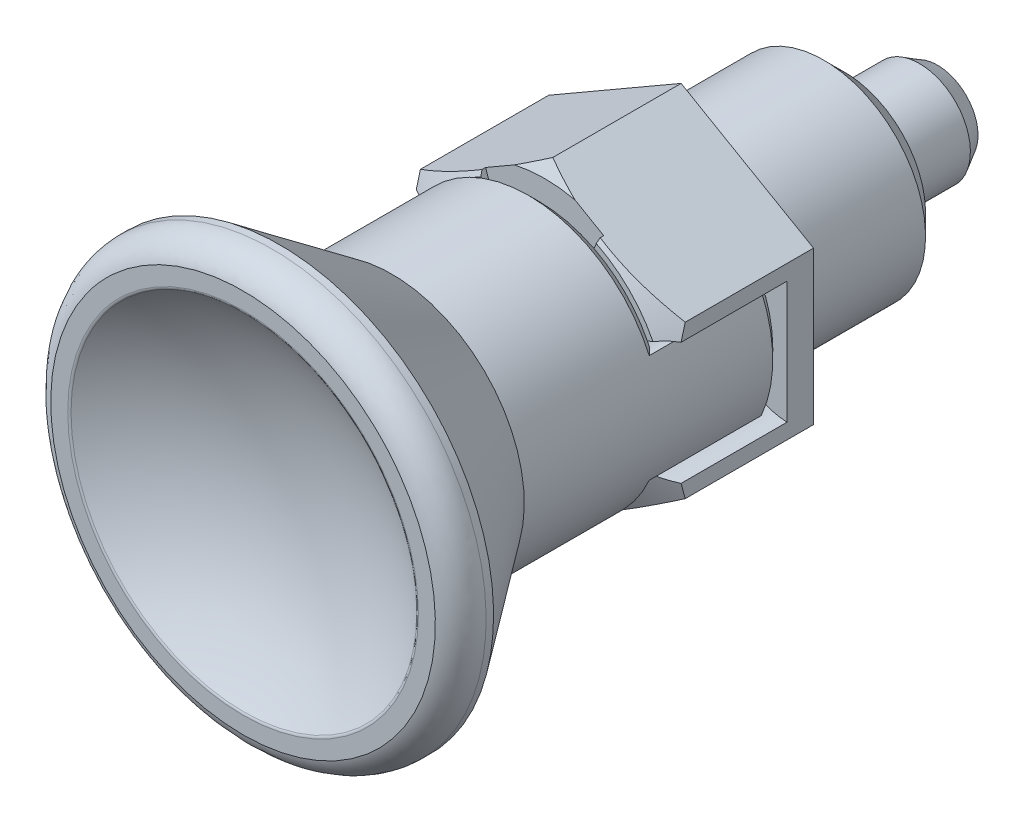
ISO-10303-21;
HEADER;
FILE_DESCRIPTION(('STEP AP214'),'2;1');
FILE_NAME('part.step','',(''),(''),'','','');
FILE_SCHEMA(('AUTOMOTIVE_DESIGN { 1 0 10303 214 1 1 1 1 }'));
ENDSEC;
DATA;
#1=APPLICATION_CONTEXT('core data for automotive mechanical design processes');
#2=APPLICATION_PROTOCOL_DEFINITION('international standard','automotive_design',2000,#1);
#3=PRODUCT_CONTEXT('',#1,'mechanical');
#4=PRODUCT('Part','Part','',(#3));
#5=PRODUCT_RELATED_PRODUCT_CATEGORY('part','',(#4));
#6=PRODUCT_DEFINITION_FORMATION('','',#4);
#7=PRODUCT_DEFINITION_CONTEXT('part definition',#1,'design');
#8=PRODUCT_DEFINITION('design','',#6,#7);
#9=PRODUCT_DEFINITION_SHAPE('','',#8);
#10=(LENGTH_UNIT() NAMED_UNIT(*) SI_UNIT(.MILLI.,.METRE.));
#11=(NAMED_UNIT(*) PLANE_ANGLE_UNIT() SI_UNIT($,.RADIAN.));
#12=(NAMED_UNIT(*) SI_UNIT($,.STERADIAN.) SOLID_ANGLE_UNIT());
#13=UNCERTAINTY_MEASURE_WITH_UNIT(LENGTH_MEASURE(1.E-05),#10,'distance_accuracy_value','');
#14=(GEOMETRIC_REPRESENTATION_CONTEXT(3) GLOBAL_UNCERTAINTY_ASSIGNED_CONTEXT((#13)) GLOBAL_UNIT_ASSIGNED_CONTEXT((#10,
#11,#12)) REPRESENTATION_CONTEXT('',''));
#15=CARTESIAN_POINT('',(0.,0.,0.));
#16=DIRECTION('',(0.,0.,1.));
#17=DIRECTION('',(1.,0.,0.));
#18=AXIS2_PLACEMENT_3D('',#15,#16,#17);
#19=CARTESIAN_POINT('',(0.,-1.28703991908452E-09,32.599147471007));
#20=DIRECTION('',(0.,0.,-1.));
#21=DIRECTION('',(1.74532925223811E-06,-0.999999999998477,0.));
#22=AXIS2_PLACEMENT_3D('',#19,#20,#21);
#23=SPHERICAL_SURFACE('',#22,14.0000000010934);
#24=CARTESIAN_POINT('',(0.,4.8919202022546E-13,21.4645927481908));
#25=DIRECTION('',(0.,0.,1.));
#26=DIRECTION('',(1.74532925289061E-06,-0.999999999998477,0.));
#27=AXIS2_PLACEMENT_3D('',#24,#25,#26);
#28=CIRCLE('',#27,8.48655944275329);
#29=CARTESIAN_POINT('',(1.48118404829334E-05,-8.48655944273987,21.464592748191));
#30=VERTEX_POINT('',#29);
#31=EDGE_CURVE('E425',#30,#30,#28,.T.);
#32=ORIENTED_EDGE('',*,*,#31,.T.);
#33=EDGE_LOOP('',(#32));
#34=FACE_BOUND('',#33,.T.);
#35=ADVANCED_FACE('F14',(#34),#23,.F.);
#36=CARTESIAN_POINT('',(1.48118404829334E-05,-8.48655944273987,21.464592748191));
#37=CARTESIAN_POINT('',(1.49049371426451E-05,-8.53989989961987,21.5066671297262));
#38=CARTESIAN_POINT('',(1.50234382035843E-05,-8.60779600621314,21.5055276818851));
#39=CARTESIAN_POINT('',(-14.6991373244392,-8.48658509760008,21.464592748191));
#40=CARTESIAN_POINT('',(-14.7915256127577,-8.53992571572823,21.5066671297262));
#41=CARTESIAN_POINT('',(-14.9091250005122,-8.60782202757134,21.505527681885));
#42=CARTESIAN_POINT('',(-7.34958347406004,4.24326689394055,21.4645927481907));
#43=CARTESIAN_POINT('',(-7.39577771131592,4.26993704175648,21.506667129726));
#44=CARTESIAN_POINT('',(-7.45457752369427,4.30388499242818,21.5055276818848));
#45=CARTESIAN_POINT('',(-2.96236808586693E-05,16.9731188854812,21.4645927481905));
#46=CARTESIAN_POINT('',(-2.98098741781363E-05,17.0797997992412,21.5066671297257));
#47=CARTESIAN_POINT('',(-3.00468763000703E-05,17.2155920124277,21.5055276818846));
#48=CARTESIAN_POINT('',(7.34956866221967,4.24329254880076,21.4645927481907));
#49=CARTESIAN_POINT('',(7.39576280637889,4.26996285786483,21.506667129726));
#50=CARTESIAN_POINT('',(7.45456250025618,4.30391101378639,21.5055276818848));
#51=CARTESIAN_POINT('',(14.6991669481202,-8.48653378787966,21.464592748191));
#52=CARTESIAN_POINT('',(14.791555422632,-8.53987408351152,21.5066671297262));
#53=CARTESIAN_POINT('',(14.9091550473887,-8.60776998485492,21.505527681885));
#54=CARTESIAN_POINT('',(1.48118404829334E-05,-8.48655944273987,21.464592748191));
#55=CARTESIAN_POINT('',(1.49049371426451E-05,-8.53989989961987,21.5066671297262));
#56=CARTESIAN_POINT('',(1.50234382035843E-05,-8.60779600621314,21.5055276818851));
#57=(BOUNDED_SURFACE() B_SPLINE_SURFACE(2,2,((#36,#37,#38),(#39,#40,#41),(#42,#43,#44),(#45,#46,
#47),(#48,#49,#50),(#51,#52,#53),(#54,#55,#56)),.UNSPECIFIED.,.T.,.F.,
.F.) B_SPLINE_SURFACE_WITH_KNOTS((3,2,2,3),(3,3),(0.,217.869655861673,435.739311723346,
653.60896758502),(0.,1.),
.UNSPECIFIED.) GEOMETRIC_REPRESENTATION_ITEM() RATIONAL_B_SPLINE_SURFACE(((1.,0.946908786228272,
1.),(0.5,0.473454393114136,0.5),(1.,0.946908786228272,1.),(0.5,0.473454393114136,0.5),(1.,
0.946908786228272,1.),(0.5,0.473454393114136,0.5),(1.,0.946908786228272,1.))) REPRESENTATION_ITEM('') SURFACE());
#58=CARTESIAN_POINT('',(0.,4.77048955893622E-13,21.5055276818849));
#59=DIRECTION('',(0.,0.,-1.));
#60=DIRECTION('',(1.74532925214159E-06,-0.999999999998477,0.));
#61=AXIS2_PLACEMENT_3D('',#58,#59,#60);
#62=CIRCLE('',#61,8.60779600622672);
#63=CARTESIAN_POINT('',(1.50234382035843E-05,-8.60779600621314,21.5055276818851));
#64=VERTEX_POINT('',#63);
#65=EDGE_CURVE('E421',#64,#64,#62,.T.);
#66=CARTESIAN_POINT('',(1.48118404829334E-05,-8.48655944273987,21.464592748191));
#67=CARTESIAN_POINT('',(1.48136794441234E-05,-8.48761308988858,21.465423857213));
#68=CARTESIAN_POINT('',(1.48155335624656E-05,-8.48867542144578,21.4662439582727));
#69=CARTESIAN_POINT('',(1.48192760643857E-05,-8.49081971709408,21.4678637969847));
#70=CARTESIAN_POINT('',(1.4821164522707E-05,-8.49190172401,21.4686634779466));
#71=CARTESIAN_POINT('',(1.48249748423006E-05,-8.49408487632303,21.4702417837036));
#72=CARTESIAN_POINT('',(1.48268967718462E-05,-8.49518606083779,21.4710203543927));
#73=CARTESIAN_POINT('',(1.483077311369E-05,-8.49740704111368,21.4725557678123));
#74=CARTESIAN_POINT('',(1.4832727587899E-05,-8.49852687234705,21.4733125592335));
#75=CARTESIAN_POINT('',(1.48366680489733E-05,-8.50078459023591,21.4748037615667));
#76=CARTESIAN_POINT('',(1.48386540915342E-05,-8.5019225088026,21.4755381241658));
#77=CARTESIAN_POINT('',(1.4842656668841E-05,-8.50421581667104,21.4769838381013));
#78=CARTESIAN_POINT('',(1.4844673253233E-05,-8.50537123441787,21.4776951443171));
#79=CARTESIAN_POINT('',(1.48487358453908E-05,-8.50769892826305,21.4790941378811));
#80=CARTESIAN_POINT('',(1.48507818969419E-05,-8.50887122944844,21.4797817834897));
#81=CARTESIAN_POINT('',(1.48549023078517E-05,-8.51123205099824,21.4811328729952));
#82=CARTESIAN_POINT('',(1.48569767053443E-05,-8.51242059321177,21.4817962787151));
#83=CARTESIAN_POINT('',(1.48611526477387E-05,-8.51481323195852,21.4830983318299));
#84=CARTESIAN_POINT('',(1.48632542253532E-05,-8.51601734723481,21.4837369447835));
#85=CARTESIAN_POINT('',(1.48674833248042E-05,-8.51844044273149,21.4849888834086));
#86=CARTESIAN_POINT('',(1.4869610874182E-05,-8.51965943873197,21.4856021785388));
#87=CARTESIAN_POINT('',(1.4873890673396E-05,-8.52211158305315,21.4868029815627));
#88=CARTESIAN_POINT('',(1.48760429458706E-05,-8.52334474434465,21.4873904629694));
#89=CARTESIAN_POINT('',(1.48803709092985E-05,-8.52582448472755,21.4885391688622));
#90=CARTESIAN_POINT('',(1.48825466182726E-05,-8.52707107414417,21.4891003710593));
#91=CARTESIAN_POINT('',(1.48869201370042E-05,-8.52957691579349,21.4901960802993));
#92=CARTESIAN_POINT('',(1.4889117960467E-05,-8.53083617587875,21.4907305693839));
#93=CARTESIAN_POINT('',(1.48935343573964E-05,-8.53336658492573,21.4917724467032));
#94=CARTESIAN_POINT('',(1.48957529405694E-05,-8.53463773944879,21.4922798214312));
#95=CARTESIAN_POINT('',(1.49002094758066E-05,-8.53719114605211,21.4932670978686));
#96=CARTESIAN_POINT('',(1.49024474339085E-05,-8.53847340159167,21.4937469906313));
#97=CARTESIAN_POINT('',(1.49069413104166E-05,-8.54104820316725,21.4946789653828));
#98=CARTESIAN_POINT('',(1.49091972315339E-05,-8.54234075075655,21.4951310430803));
#99=CARTESIAN_POINT('',(1.49137256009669E-05,-8.5449353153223,21.4960070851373));
#100=CARTESIAN_POINT('',(1.49159980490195E-05,-8.54623733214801,21.4964310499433));
#101=CARTESIAN_POINT('',(1.49205580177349E-05,-8.54885000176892,21.4972505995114));
#102=CARTESIAN_POINT('',(1.4922845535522E-05,-8.55016065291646,21.4976461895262));
#103=CARTESIAN_POINT('',(1.49274341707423E-05,-8.55278974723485,21.4984087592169));
#104=CARTESIAN_POINT('',(1.49297352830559E-05,-8.55410818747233,21.4987757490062));
#105=CARTESIAN_POINT('',(1.49343496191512E-05,-8.55675200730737,21.4994809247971));
#106=CARTESIAN_POINT('',(1.49366628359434E-05,-8.55807738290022,21.4998191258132));
#107=CARTESIAN_POINT('',(1.49412998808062E-05,-8.5607342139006,21.5004665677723));
#108=CARTESIAN_POINT('',(1.49436237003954E-05,-8.56206566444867,21.5007758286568));
#109=CARTESIAN_POINT('',(1.49482804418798E-05,-8.56473378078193,21.5013652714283));
#110=CARTESIAN_POINT('',(1.4950613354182E-05,-8.56607044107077,21.5016454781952));
#111=CARTESIAN_POINT('',(1.49552867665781E-05,-8.56874810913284,21.5021767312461));
#112=CARTESIAN_POINT('',(1.4957627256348E-05,-8.57008911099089,21.5024278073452));
#113=CARTESIAN_POINT('',(1.4962314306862E-05,-8.57277459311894,21.5029007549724));
#114=CARTESIAN_POINT('',(1.49646608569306E-05,-8.5741190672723,21.5031226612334));
#115=CARTESIAN_POINT('',(1.49693585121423E-05,-8.57681062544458,21.5035372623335));
#116=CARTESIAN_POINT('',(1.49717096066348E-05,-8.57815770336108,21.5037299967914));
#117=CARTESIAN_POINT('',(1.49764148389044E-05,-8.58085360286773,21.5040862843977));
#118=CARTESIAN_POINT('',(1.49787689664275E-05,-8.58220241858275,21.5042498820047));
#119=CARTESIAN_POINT('',(1.49834787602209E-05,-8.58490093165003,21.5045479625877));
#120=CARTESIAN_POINT('',(1.49858344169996E-05,-8.58625062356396,21.504682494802));
#121=CARTESIAN_POINT('',(1.49905457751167E-05,-8.58895003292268,21.5049225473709));
#122=CARTESIAN_POINT('',(1.49929014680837E-05,-8.59029974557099,21.5050281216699));
#123=CARTESIAN_POINT('',(1.49976114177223E-05,-8.59299834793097,21.5052103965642));
#124=CARTESIAN_POINT('',(1.49999656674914E-05,-8.59434723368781,21.5052871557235));
#125=CARTESIAN_POINT('',(1.50046712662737E-05,-8.59704334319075,21.5054119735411));
#126=CARTESIAN_POINT('',(1.50070226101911E-05,-8.59839056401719,21.5054600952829));
#127=CARTESIAN_POINT('',(1.50117209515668E-05,-8.60108251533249,21.5055278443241));
#128=CARTESIAN_POINT('',(1.50140679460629E-05,-8.60242724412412,21.5055475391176));
#129=CARTESIAN_POINT('',(1.50187561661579E-05,-8.60511339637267,21.5055586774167));
#130=CARTESIAN_POINT('',(1.50210973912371E-05,-8.60645481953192,21.5055501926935));
#131=CARTESIAN_POINT('',(1.50234382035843E-05,-8.60779600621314,21.5055276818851));
#132=B_SPLINE_CURVE_WITH_KNOTS('',3,(#66,#67,#68,#69,#70,#71,#72,#73,#74,#75,#76,#77,#78,#79,
#80,#81,#82,#83,#84,#85,#86,#87,#88,#89,#90,#91,#92,#93,#94,#95,#96,#97,#98,#99,#100,#101,#102,
#103,#104,#105,#106,#107,#108,#109,#110,#111,#112,#113,#114,#115,#116,#117,#118,#119,#120,#121,
#122,#123,#124,#125,#126,#127,#128,#129,#130,#131),.UNSPECIFIED.,.F.,.F.,(4,2,2,2,2,2,2,2,2,2,2,
2,2,2,2,2,2,2,2,2,2,2,2,2,2,2,2,2,2,2,2,2,4),(0.,0.00402587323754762,0.00806191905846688,
0.0121074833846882,0.0161619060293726,0.0202245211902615,0.0242946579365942,0.0283716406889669,
0.0324547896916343,0.0365434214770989,0.0406368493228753,0.0447343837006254,0.0488353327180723,
0.0529390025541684,0.0570446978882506,0.0611517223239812,0.0652593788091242,0.0693669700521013,
0.0734737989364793,0.0775791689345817,0.0816823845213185,0.0857827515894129,0.0898795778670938,
0.0939721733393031,0.0980598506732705,0.10214192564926,0.106217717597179,0.110286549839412,
0.114347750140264,0.118400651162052,0.122444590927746,0.126478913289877,0.130502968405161),.UNSPECIFIED.);
#133=EDGE_CURVE('BSEAM993',#30,#64,#132,.T.);
#134=ORIENTED_EDGE('',*,*,#31,.F.);
#135=ORIENTED_EDGE('',*,*,#65,.F.);
#136=ORIENTED_EDGE('',*,*,#133,.T.);
#137=ORIENTED_EDGE('',*,*,#133,.F.);
#138=EDGE_LOOP('',(#134,#136,#135,#137));
#139=FACE_BOUND('',#138,.T.);
#140=ADVANCED_FACE('F993',(#139),#57,.T.);
#141=CARTESIAN_POINT('',(-10.3840181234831,10.3839818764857,21.5055276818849));
#142=DIRECTION('',(0.,0.,1.));
#143=DIRECTION('',(1.74532925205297E-06,-0.999999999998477,0.));
#144=AXIS2_PLACEMENT_3D('',#141,#142,#143);
#145=PLANE('',#144);
#146=CARTESIAN_POINT('',(0.,4.77048955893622E-13,21.5055276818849));
#147=DIRECTION('',(0.,0.,-1.));
#148=DIRECTION('',(1.74532925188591E-06,-0.999999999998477,0.));
#149=AXIS2_PLACEMENT_3D('',#146,#147,#148);
#150=CIRCLE('',#149,9.44);
#151=CARTESIAN_POINT('',(1.64759081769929E-05,-9.43999999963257,21.505527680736));
#152=VERTEX_POINT('',#151);
#153=EDGE_CURVE('E417',#152,#152,#150,.T.);
#154=ORIENTED_EDGE('',*,*,#153,.F.);
#155=EDGE_LOOP('',(#154));
#156=FACE_BOUND('',#155,.T.);
#157=ORIENTED_EDGE('',*,*,#65,.T.);
#158=EDGE_LOOP('',(#157));
#159=FACE_BOUND('',#158,.T.);
#160=ADVANCED_FACE('F1005',(#156,#159),#145,.T.);
#161=CARTESIAN_POINT('',(1.64759081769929E-05,-9.43999999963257,21.505527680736));
#162=CARTESIAN_POINT('',(1.83259571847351E-05,-10.4999999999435,21.1802870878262));
#163=CARTESIAN_POINT('',(1.83259571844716E-05,-10.4999999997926,20.0715123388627));
#164=CARTESIAN_POINT('',(-16.3505431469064,-9.44002853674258,21.505527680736));
#165=CARTESIAN_POINT('',(-18.186515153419,-10.5000317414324,21.1802870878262));
#166=CARTESIAN_POINT('',(-18.1865151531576,-10.5000317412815,20.0715123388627));
#167=CARTESIAN_POINT('',(-8.17528804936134,4.719985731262,21.5055276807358));
#168=CARTESIAN_POINT('',(-9.09327590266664,5.24998412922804,21.1802870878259));
#169=CARTESIAN_POINT('',(-9.09327590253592,5.24998412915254,20.0715123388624));
#170=CARTESIAN_POINT('',(-3.29518162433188E-05,18.8799999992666,21.5055276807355));
#171=CARTESIAN_POINT('',(-3.66519142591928E-05,20.9999999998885,21.1802870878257));
#172=CARTESIAN_POINT('',(-3.66519142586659E-05,20.9999999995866,20.0715123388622));
#173=CARTESIAN_POINT('',(8.17527157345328,4.720014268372,21.5055276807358));
#174=CARTESIAN_POINT('',(9.09325757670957,5.25001587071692,21.1802870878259));
#175=CARTESIAN_POINT('',(9.09325757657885,5.25001587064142,20.0715123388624));
#176=CARTESIAN_POINT('',(16.3505760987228,-9.43997146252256,21.505527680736));
#177=CARTESIAN_POINT('',(18.1865518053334,-10.4999682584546,21.1802870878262));
#178=CARTESIAN_POINT('',(18.186551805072,-10.4999682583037,20.0715123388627));
#179=CARTESIAN_POINT('',(1.64759081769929E-05,-9.43999999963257,21.505527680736));
#180=CARTESIAN_POINT('',(1.83259571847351E-05,-10.4999999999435,21.1802870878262));
#181=CARTESIAN_POINT('',(1.83259571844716E-05,-10.4999999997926,20.0715123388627));
#182=(BOUNDED_SURFACE() B_SPLINE_SURFACE(2,2,((#161,#162,#163),(#164,#165,#166),(#167,#168,
#169),(#170,#171,#172),(#173,#174,#175),(#176,#177,#178),(#179,#180,#181)),.UNSPECIFIED.,.T.,
.F.,.F.) B_SPLINE_SURFACE_WITH_KNOTS((3,2,2,3),(3,3),(0.,15.9434687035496,31.8869374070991,
47.8304061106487),(0.,1.),
.UNSPECIFIED.) GEOMETRIC_REPRESENTATION_ITEM() RATIONAL_B_SPLINE_SURFACE(((1.,0.804155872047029,
1.),(0.5,0.402077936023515,0.5),(1.,0.804155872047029,1.),(0.5,0.402077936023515,0.5),(1.,
0.804155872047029,1.),(0.5,0.402077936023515,0.5),(1.,0.804155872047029,1.))) REPRESENTATION_ITEM('') SURFACE());
#183=CARTESIAN_POINT('',(0.,4.54497550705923E-13,20.0715123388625));
#184=DIRECTION('',(0.,0.,-1.));
#185=DIRECTION('',(1.74532925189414E-06,-0.999999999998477,0.));
#186=AXIS2_PLACEMENT_3D('',#183,#184,#185);
#187=CIRCLE('',#186,10.499999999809);
#188=CARTESIAN_POINT('',(1.83259571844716E-05,-10.4999999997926,20.0715123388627));
#189=VERTEX_POINT('',#188);
#190=EDGE_CURVE('E410',#189,#189,#187,.T.);
#191=CARTESIAN_POINT('',(1.64759081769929E-05,-9.43999999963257,21.505527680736));
#192=CARTESIAN_POINT('',(1.64836685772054E-05,-9.44444638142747,21.5041633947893));
#193=CARTESIAN_POINT('',(1.64914179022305E-05,-9.44888641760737,21.5027784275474));
#194=CARTESIAN_POINT('',(1.6506917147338E-05,-9.45776683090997,21.4999629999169));
#195=CARTESIAN_POINT('',(1.65146669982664E-05,-9.46220716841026,21.4985324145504));
#196=CARTESIAN_POINT('',(1.65301661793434E-05,-9.47108754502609,21.495625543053));
#197=CARTESIAN_POINT('',(1.65379154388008E-05,-9.47552754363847,21.4941491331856));
#198=CARTESIAN_POINT('',(1.65534123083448E-05,-9.48440659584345,21.4911504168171));
#199=CARTESIAN_POINT('',(1.65611598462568E-05,-9.48884560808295,21.4896279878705));
#200=CARTESIAN_POINT('',(1.65766521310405E-05,-9.49772203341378,21.4865370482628));
#201=CARTESIAN_POINT('',(1.65843968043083E-05,-9.50215940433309,21.4849684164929));
#202=CARTESIAN_POINT('',(1.65998822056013E-05,-9.51103188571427,21.4817848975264));
#203=CARTESIAN_POINT('',(1.66076228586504E-05,-9.51546695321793,21.4801698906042));
#204=CARTESIAN_POINT('',(1.66230990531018E-05,-9.5243341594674,21.4768934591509));
#205=CARTESIAN_POINT('',(1.6630834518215E-05,-9.52876625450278,21.4752319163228));
#206=CARTESIAN_POINT('',(1.66462991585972E-05,-9.53762684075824,21.4718622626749));
#207=CARTESIAN_POINT('',(1.66540282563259E-05,-9.542055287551,21.4701540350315));
#208=CARTESIAN_POINT('',(1.66694789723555E-05,-9.55090789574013,21.4666908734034));
#209=CARTESIAN_POINT('',(1.6677200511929E-05,-9.55533201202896,21.464935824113));
#210=CARTESIAN_POINT('',(1.66926349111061E-05,-9.56417527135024,21.461378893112));
#211=CARTESIAN_POINT('',(1.67003476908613E-05,-9.56859436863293,21.4595768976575));
#212=CARTESIAN_POINT('',(1.67157633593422E-05,-9.57742689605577,21.4559259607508));
#213=CARTESIAN_POINT('',(1.67234661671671E-05,-9.58184027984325,21.4540769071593));
#214=CARTESIAN_POINT('',(1.67388606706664E-05,-9.59066068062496,21.4503317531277));
#215=CARTESIAN_POINT('',(1.67465522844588E-05,-9.59506765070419,21.448435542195));
#216=CARTESIAN_POINT('',(1.67619231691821E-05,-9.60387451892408,21.4445959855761));
#217=CARTESIAN_POINT('',(1.67696023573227E-05,-9.60827436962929,21.4426525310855));
#218=CARTESIAN_POINT('',(1.67849471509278E-05,-9.61706628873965,21.4387184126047));
#219=CARTESIAN_POINT('',(1.67926126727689E-05,-9.621458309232,21.4367276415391));
#220=CARTESIAN_POINT('',(1.68079288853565E-05,-9.63023385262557,21.432698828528));
#221=CARTESIAN_POINT('',(1.68155794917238E-05,-9.634617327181,21.4306606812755));
#222=CARTESIAN_POINT('',(1.68308646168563E-05,-9.64337505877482,21.4265370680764));
#223=CARTESIAN_POINT('',(1.6838499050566E-05,-9.64774926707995,21.4244514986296));
#224=CARTESIAN_POINT('',(1.68537505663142E-05,-9.65648774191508,21.4202330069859));
#225=CARTESIAN_POINT('',(1.68613675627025E-05,-9.66085195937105,21.4180999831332));
#226=CARTESIAN_POINT('',(1.687658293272E-05,-9.66956972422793,21.4137865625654));
#227=CARTESIAN_POINT('',(1.68841812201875E-05,-9.67392322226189,21.4116060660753));
#228=CARTESIAN_POINT('',(1.68993578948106E-05,-9.68261881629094,21.4071976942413));
#229=CARTESIAN_POINT('',(1.69069361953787E-05,-9.68696086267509,21.4049697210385));
#230=CARTESIAN_POINT('',(1.69220716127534E-05,-9.69563281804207,21.4004664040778));
#231=CARTESIAN_POINT('',(1.69296286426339E-05,-9.69996267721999,21.3981909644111));
#232=CARTESIAN_POINT('',(1.69447202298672E-05,-9.7086095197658,21.3935927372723));
#233=CARTESIAN_POINT('',(1.69522547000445E-05,-9.71292645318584,21.3912698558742));
#234=CARTESIAN_POINT('',(1.69672998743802E-05,-9.7215467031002,21.3865767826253));
#235=CARTESIAN_POINT('',(1.69748104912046E-05,-9.72584996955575,21.3842064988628));
#236=CARTESIAN_POINT('',(1.69898066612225E-05,-9.73444214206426,21.3794186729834));
#237=CARTESIAN_POINT('',(1.69972921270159E-05,-9.73873099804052,21.3770010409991));
#238=CARTESIAN_POINT('',(1.70122366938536E-05,-9.74729360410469,21.3721185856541));
#239=CARTESIAN_POINT('',(1.70196957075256E-05,-9.75156730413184,21.369653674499));
#240=CARTESIAN_POINT('',(1.70345860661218E-05,-9.76009885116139,21.3646767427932));
#241=CARTESIAN_POINT('',(1.70420173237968E-05,-9.76435664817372,21.3621646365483));
#242=CARTESIAN_POINT('',(1.70568508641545E-05,-9.77285564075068,21.3570934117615));
#243=CARTESIAN_POINT('',(1.70642530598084E-05,-9.77709678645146,21.3545342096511));
#244=CARTESIAN_POINT('',(1.7079027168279E-05,-9.78556172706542,21.3493689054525));
#245=CARTESIAN_POINT('',(1.70863989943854E-05,-9.78978547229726,21.3467627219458));
#246=CARTESIAN_POINT('',(1.71011110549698E-05,-9.79821486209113,21.3415035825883));
#247=CARTESIAN_POINT('',(1.71084512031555E-05,-9.80242045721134,21.3388505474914));
#248=CARTESIAN_POINT('',(1.71230985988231E-05,-9.81081279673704,21.3334978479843));
#249=CARTESIAN_POINT('',(1.71304057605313E-05,-9.81499949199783,21.3307981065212));
#250=CARTESIAN_POINT('',(1.71449858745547E-05,-9.82335328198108,21.3253521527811));
#251=CARTESIAN_POINT('',(1.71522587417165E-05,-9.8275203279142,21.3226058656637));
#252=CARTESIAN_POINT('',(1.71667689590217E-05,-9.83583407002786,21.3170669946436));
#253=CARTESIAN_POINT('',(1.71740062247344E-05,-9.8399807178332,21.3142743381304));
#254=CARTESIAN_POINT('',(1.71884439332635E-05,-9.84825291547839,21.3086429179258));
#255=CARTESIAN_POINT('',(1.71956442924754E-05,-9.85237841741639,21.3058040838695));
#256=CARTESIAN_POINT('',(1.72100068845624E-05,-9.86060757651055,21.3000805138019));
#257=CARTESIAN_POINT('',(1.72171690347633E-05,-9.86471118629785,21.2971957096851));
#258=CARTESIAN_POINT('',(1.72314539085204E-05,-9.8728958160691,21.291380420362));
#259=CARTESIAN_POINT('',(1.72385765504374E-05,-9.87697678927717,21.2884498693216));
#260=CARTESIAN_POINT('',(1.72527811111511E-05,-9.8851154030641,21.2825433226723));
#261=CARTESIAN_POINT('',(1.72598629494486E-05,-9.88917299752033,21.2795672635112));
#262=CARTESIAN_POINT('',(1.72739846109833E-05,-9.89726411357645,21.2735699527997));
#263=CARTESIAN_POINT('',(1.72810243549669E-05,-9.9012975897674,21.270548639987));
#264=CARTESIAN_POINT('',(1.72950605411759E-05,-9.90933973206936,21.2644610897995));
#265=CARTESIAN_POINT('',(1.73020569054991E-05,-9.91334835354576,21.2613947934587));
#266=CARTESIAN_POINT('',(1.73160050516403E-05,-9.92134005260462,21.2552175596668));
#267=CARTESIAN_POINT('',(1.73229567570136E-05,-9.92532308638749,21.2521065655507));
#268=CARTESIAN_POINT('',(1.73368143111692E-05,-9.93326288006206,21.2458402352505));
#269=CARTESIAN_POINT('',(1.73437200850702E-05,-9.93721959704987,21.2426848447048));
#270=CARTESIAN_POINT('',(1.73574845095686E-05,-9.9451060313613,21.2363300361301));
#271=CARTESIAN_POINT('',(1.73643430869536E-05,-9.94903570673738,21.2331305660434));
#272=CARTESIAN_POINT('',(1.73780118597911E-05,-9.95686733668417,21.2266879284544));
#273=CARTESIAN_POINT('',(1.73848219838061E-05,-9.96076925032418,21.2234447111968));
#274=CARTESIAN_POINT('',(1.73983926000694E-05,-9.9685446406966,21.2169149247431));
#275=CARTESIAN_POINT('',(1.74051530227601E-05,-9.97241807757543,21.2136283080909));
#276=CARTESIAN_POINT('',(1.74186229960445E-05,-9.98013580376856,21.2070120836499));
#277=CARTESIAN_POINT('',(1.74253324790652E-05,-9.9839800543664,21.2036824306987));
#278=CARTESIAN_POINT('',(1.74386993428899E-05,-9.99163870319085,21.1969805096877));
#279=CARTESIAN_POINT('',(1.74453566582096E-05,-9.99545306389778,21.193608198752));
#280=CARTESIAN_POINT('',(1.7458617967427E-05,-10.0030512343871,21.1868213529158));
#281=CARTESIAN_POINT('',(1.74652218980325E-05,-10.0068350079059,21.1834067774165));
#282=CARTESIAN_POINT('',(1.74783752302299E-05,-10.01437131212,21.1765358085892));
#283=CARTESIAN_POINT('',(1.74849245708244E-05,-10.0181238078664,21.173079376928));
#284=CARTESIAN_POINT('',(1.74979675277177E-05,-10.0255968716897,21.1661251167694));
#285=CARTESIAN_POINT('',(1.75044610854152E-05,-10.0293174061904,21.1626272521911));
#286=CARTESIAN_POINT('',(1.75173912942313E-05,-10.0367258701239,21.1555905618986));
#287=CARTESIAN_POINT('',(1.75238278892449E-05,-10.0404137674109,21.1520517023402));
#288=CARTESIAN_POINT('',(1.75366430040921E-05,-10.0477562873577,21.1449334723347));
#289=CARTESIAN_POINT('',(1.75430214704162E-05,-10.051410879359,21.1413540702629));
#290=CARTESIAN_POINT('',(1.75557191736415E-05,-10.0586861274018,21.1341552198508));
#291=CARTESIAN_POINT('',(1.75620383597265E-05,-10.0623067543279,21.130535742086));
#292=CARTESIAN_POINT('',(1.75746163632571E-05,-10.0695134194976,21.123257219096));
#293=CARTESIAN_POINT('',(1.75808751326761E-05,-10.073099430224,21.1195981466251));
#294=CARTESIAN_POINT('',(1.75933311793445E-05,-10.0802362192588,21.1122409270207));
#295=CARTESIAN_POINT('',(1.75995284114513E-05,-10.0837869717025,21.1085427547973));
#296=CARTESIAN_POINT('',(1.76118602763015E-05,-10.0908526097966,21.1011078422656));
#297=CARTESIAN_POINT('',(1.76179948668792E-05,-10.0943674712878,21.0973710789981));
#298=CARTESIAN_POINT('',(1.76302003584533E-05,-10.1013607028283,21.0898595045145));
#299=CARTESIAN_POINT('',(1.76362712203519E-05,-10.1048390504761,21.0860846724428));
#300=CARTESIAN_POINT('',(1.76483481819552E-05,-10.1117586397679,21.0784974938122));
#301=CARTESIAN_POINT('',(1.76543542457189E-05,-10.1151998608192,21.0746851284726));
#302=CARTESIAN_POINT('',(1.76663005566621E-05,-10.1220445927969,21.0670234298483));
#303=CARTESIAN_POINT('',(1.76722407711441E-05,-10.1254480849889,21.0631740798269));
#304=CARTESIAN_POINT('',(1.76840543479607E-05,-10.1322167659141,21.055438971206));
#305=CARTESIAN_POINT('',(1.76899276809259E-05,-10.1355819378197,21.0515531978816));
#306=CARTESIAN_POINT('',(1.77016064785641E-05,-10.142273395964,21.0437458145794));
#307=CARTESIAN_POINT('',(1.77074119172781E-05,-10.1455996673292,21.0398241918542));
#308=CARTESIAN_POINT('',(1.77189539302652E-05,-10.1522127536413,21.0319456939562));
#309=CARTESIAN_POINT('',(1.77246904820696E-05,-10.1554995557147,21.0279888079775));
#310=CARTESIAN_POINT('',(1.77360937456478E-05,-10.1620331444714,21.020040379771));
#311=CARTESIAN_POINT('',(1.77417604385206E-05,-10.1652799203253,21.0160488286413));
#312=CARTESIAN_POINT('',(1.77530230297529E-05,-10.171732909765,21.0080316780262));
#313=CARTESIAN_POINT('',(1.77586189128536E-05,-10.174939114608,21.0040060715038));
#314=CARTESIAN_POINT('',(1.77697389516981E-05,-10.1813104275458,20.9959214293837));
#315=CARTESIAN_POINT('',(1.77752630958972E-05,-10.184475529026,20.9918623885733));
#316=CARTESIAN_POINT('',(1.77862387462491E-05,-10.1907641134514,20.9837115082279));
#317=CARTESIAN_POINT('',(1.77916902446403E-05,-10.1938875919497,20.9796196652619));
#318=CARTESIAN_POINT('',(1.780251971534E-05,-10.2000924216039,20.9714038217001));
#319=CARTESIAN_POINT('',(1.78078976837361E-05,-10.2031737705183,20.9672798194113));
#320=CARTESIAN_POINT('',(1.78185792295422E-05,-10.2092938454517,20.959000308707));
#321=CARTESIAN_POINT('',(1.78238828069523E-05,-10.2123325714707,20.9548448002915));
#322=CARTESIAN_POINT('',(1.78344147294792E-05,-10.2183669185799,20.9465029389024));
#323=CARTESIAN_POINT('',(1.78396430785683E-05,-10.2213625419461,20.9423165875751));
#324=CARTESIAN_POINT('',(1.78500237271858E-05,-10.2273102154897,20.9339137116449));
#325=CARTESIAN_POINT('',(1.78551760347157E-05,-10.2302622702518,20.9296971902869));
#326=CARTESIAN_POINT('',(1.78654038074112E-05,-10.2361223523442,20.9212346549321));
#327=CARTESIAN_POINT('',(1.78704792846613E-05,-10.2390303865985,20.9169886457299));
#328=CARTESIAN_POINT('',(1.78805526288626E-05,-10.2448019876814,20.9084678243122));
#329=CARTESIAN_POINT('',(1.78855505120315E-05,-10.2476655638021,20.9041930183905));
#330=CARTESIAN_POINT('',(1.78954679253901E-05,-10.2533478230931,20.8956153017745));
#331=CARTESIAN_POINT('',(1.79003874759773E-05,-10.2561665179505,20.8913123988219));
#332=CARTESIAN_POINT('',(1.791014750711E-05,-10.2617586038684,20.8826791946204));
#333=CARTESIAN_POINT('',(1.79149880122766E-05,-10.2645320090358,20.8783489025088));
#334=CARTESIAN_POINT('',(1.79245892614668E-05,-10.2700331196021,20.8696616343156));
#335=CARTESIAN_POINT('',(1.79293500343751E-05,-10.2727608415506,20.8653046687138));
#336=CARTESIAN_POINT('',(1.79387911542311E-05,-10.2781702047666,20.8565647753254));
#337=CARTESIAN_POINT('',(1.79434715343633E-05,-10.2808518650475,20.8521818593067));
#338=CARTESIAN_POINT('',(1.79527512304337E-05,-10.2861687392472,20.8433907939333));
#339=CARTESIAN_POINT('',(1.79573505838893E-05,-10.288803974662,20.8389826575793));
#340=CARTESIAN_POINT('',(1.79664676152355E-05,-10.2940276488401,20.8301418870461));
#341=CARTESIAN_POINT('',(1.79709853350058E-05,-10.2966161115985,20.8257092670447));
#342=CARTESIAN_POINT('',(1.79799385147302E-05,-10.3017459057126,20.8168202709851));
#343=CARTESIAN_POINT('',(1.79843740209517E-05,-10.3042872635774,20.8123639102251));
#344=CARTESIAN_POINT('',(1.79931622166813E-05,-10.3093225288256,20.8034281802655));
#345=CARTESIAN_POINT('',(1.79975149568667E-05,-10.3118164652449,20.7989488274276));
#346=CARTESIAN_POINT('',(1.80061370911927E-05,-10.3167565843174,20.7899678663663));
#347=CARTESIAN_POINT('',(1.80104065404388E-05,-10.3192027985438,20.7854662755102));
#348=CARTESIAN_POINT('',(1.80188615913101E-05,-10.3240471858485,20.7764415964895));
#349=CARTESIAN_POINT('',(1.80230472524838E-05,-10.3264453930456,20.7719185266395));
#350=CARTESIAN_POINT('',(1.80313342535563E-05,-10.3311934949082,20.7628516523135));
#351=CARTESIAN_POINT('',(1.80354356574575E-05,-10.3335434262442,20.7583078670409));
#352=CARTESIAN_POINT('',(1.80435536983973E-05,-10.3381947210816,20.7492003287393));
#353=CARTESIAN_POINT('',(1.80475704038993E-05,-10.3404961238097,20.7446365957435));
#354=CARTESIAN_POINT('',(1.80555186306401E-05,-10.3450501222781,20.735489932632));
#355=CARTESIAN_POINT('',(1.80594502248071E-05,-10.3473027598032,20.7309070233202));
#356=CARTESIAN_POINT('',(1.80672278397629E-05,-10.3517590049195,20.7217227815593));
#357=CARTESIAN_POINT('',(1.80710739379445E-05,-10.3539626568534,20.7171214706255));
#358=CARTESIAN_POINT('',(1.80786802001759E-05,-10.3583207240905,20.7079012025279));
#359=CARTESIAN_POINT('',(1.80824404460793E-05,-10.3604751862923,20.7032822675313));
#360=CARTESIAN_POINT('',(1.80898746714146E-05,-10.3647346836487,20.6940275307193));
#361=CARTESIAN_POINT('',(1.80935487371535E-05,-10.3668397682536,20.6893917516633));
#362=CARTESIAN_POINT('',(1.81008102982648E-05,-10.3710003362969,20.6801041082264));
#363=CARTESIAN_POINT('',(1.81043978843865E-05,-10.3730558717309,20.6754522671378));
#364=CARTESIAN_POINT('',(1.81114862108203E-05,-10.3771171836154,20.6661332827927));
#365=CARTESIAN_POINT('',(1.81149870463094E-05,-10.3791230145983,20.661466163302));
#366=CARTESIAN_POINT('',(1.81219016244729E-05,-10.3830847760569,20.6521174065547));
#367=CARTESIAN_POINT('',(1.81253154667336E-05,-10.3850407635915,20.6474357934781));
#368=CARTESIAN_POINT('',(1.81320558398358E-05,-10.3889027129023,20.6380588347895));
#369=CARTESIAN_POINT('',(1.81353824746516E-05,-10.3908087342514,20.6333635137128));
#370=CARTESIAN_POINT('',(1.81419482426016E-05,-10.3945706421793,20.6239599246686));
#371=CARTESIAN_POINT('',(1.81451874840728E-05,-10.3964265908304,20.6192516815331));
#372=CARTESIAN_POINT('',(1.81515783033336E-05,-10.400088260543,20.6098230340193));
#373=CARTESIAN_POINT('',(1.8154729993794E-05,-10.4018940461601,20.6051026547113));
#374=CARTESIAN_POINT('',(1.81609455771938E-05,-10.40545531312,20.5956505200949));
#375=CARTESIAN_POINT('',(1.81640095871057E-05,-10.4072108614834,20.5909187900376));
#376=CARTESIAN_POINT('',(1.81700497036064E-05,-10.4106715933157,20.5814447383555));
#377=CARTESIAN_POINT('',(1.81730259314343E-05,-10.4123768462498,20.5767024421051));
#378=CARTESIAN_POINT('',(1.81788904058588E-05,-10.4157369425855,20.5672080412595));
#379=CARTESIAN_POINT('',(1.81817787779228E-05,-10.4173918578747,20.5624559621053));
#380=CARTESIAN_POINT('',(1.81874674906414E-05,-10.4206512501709,20.5529427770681));
#381=CARTESIAN_POINT('',(1.81902679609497E-05,-10.4222558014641,20.5481816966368));
#382=CARTESIAN_POINT('',(1.81957808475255E-05,-10.4254144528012,20.5386512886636));
#383=CARTESIAN_POINT('',(1.8198493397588E-05,-10.4269686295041,20.5338819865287));
#384=CARTESIAN_POINT('',(1.82038304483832E-05,-10.4300265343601,20.5243359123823));
#385=CARTESIAN_POINT('',(1.82064550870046E-05,-10.4315303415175,20.5195591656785));
#386=CARTESIAN_POINT('',(1.82116163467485E-05,-10.4344875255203,20.5099989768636));
#387=CARTESIAN_POINT('',(1.82141531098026E-05,-10.4359409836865,20.5052155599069));
#388=CARTESIAN_POINT('',(1.82191386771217E-05,-10.4387975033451,20.4956428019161));
#389=CARTESIAN_POINT('',(1.82215876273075E-05,-10.4402006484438,20.4908534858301));
#390=CARTESIAN_POINT('',(1.82263976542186E-05,-10.4429565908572,20.4812696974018));
#391=CARTESIAN_POINT('',(1.82287588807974E-05,-10.4443094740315,20.4764752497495));
#392=CARTESIAN_POINT('',(1.82333935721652E-05,-10.4469649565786,20.4668819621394));
#393=CARTESIAN_POINT('',(1.82356671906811E-05,-10.4482676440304,20.4620831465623));
#394=CARTESIAN_POINT('',(1.82401268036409E-05,-10.4508228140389,20.4524818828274));
#395=CARTESIAN_POINT('',(1.82423129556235E-05,-10.4520753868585,20.447679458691));
#396=CARTESIAN_POINT('',(1.82465977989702E-05,-10.4545304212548,20.4380717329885));
#397=CARTESIAN_POINT('',(1.82486966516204E-05,-10.4557329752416,20.4332664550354));
#398=CARTESIAN_POINT('',(1.8252807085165E-05,-10.4580880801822,20.4236537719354));
#399=CARTESIAN_POINT('',(1.82548188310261E-05,-10.4592407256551,20.4188463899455));
#400=CARTESIAN_POINT('',(1.82587552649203E-05,-10.4614961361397,20.4092302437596));
#401=CARTESIAN_POINT('',(1.82606801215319E-05,-10.4625989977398,20.4044215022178));
#402=CARTESIAN_POINT('',(1.8264443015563E-05,-10.464754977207,20.394803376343));
#403=CARTESIAN_POINT('',(1.82662812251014E-05,-10.4658081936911,20.3899940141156));
#404=CARTESIAN_POINT('',(1.82698710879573E-05,-10.4678650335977,20.3803753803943));
#405=CARTESIAN_POINT('',(1.82716229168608E-05,-10.4688687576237,20.375566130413));
#406=CARTESIAN_POINT('',(1.82750403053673E-05,-10.4708267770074,20.3659484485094));
#407=CARTESIAN_POINT('',(1.8276706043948E-05,-10.4717811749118,20.3611400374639));
#408=CARTESIAN_POINT('',(1.82799515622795E-05,-10.473640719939,20.3515247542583));
#409=CARTESIAN_POINT('',(1.82815315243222E-05,-10.4745459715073,20.3467179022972));
#410=CARTESIAN_POINT('',(1.82846058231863E-05,-10.476307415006,20.3371064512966));
#411=CARTESIAN_POINT('',(1.82861003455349E-05,-10.4771637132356,20.3323018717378));
#412=CARTESIAN_POINT('',(1.82890041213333E-05,-10.4788274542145,20.3226956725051));
#413=CARTESIAN_POINT('',(1.82904135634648E-05,-10.4796350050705,20.3178940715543));
#414=CARTESIAN_POINT('',(1.82931475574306E-05,-10.481201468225,20.3082945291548));
#415=CARTESIAN_POINT('',(1.82944723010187E-05,-10.4819604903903,20.303496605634));
#416=CARTESIAN_POINT('',(1.82970372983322E-05,-10.4834301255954,20.2939051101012));
#417=CARTESIAN_POINT('',(1.82982777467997E-05,-10.4841408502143,20.2891115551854));
#418=CARTESIAN_POINT('',(1.83006745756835E-05,-10.4855141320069,20.2795294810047));
#419=CARTESIAN_POINT('',(1.83018311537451E-05,-10.4861768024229,20.2747409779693));
#420=CARTESIAN_POINT('',(1.83040606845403E-05,-10.4874542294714,20.265169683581));
#421=CARTESIAN_POINT('',(1.83051338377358E-05,-10.4880691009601,20.2603869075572));
#422=CARTESIAN_POINT('',(1.83071969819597E-05,-10.4892511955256,20.2508277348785));
#423=CARTESIAN_POINT('',(1.83081871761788E-05,-10.4898185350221,20.2460513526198));
#424=CARTESIAN_POINT('',(1.83100848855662E-05,-10.4909058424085,20.2365056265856));
#425=CARTESIAN_POINT('',(1.83109926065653E-05,-10.4914259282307,20.2317362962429));
#426=CARTESIAN_POINT('',(1.83127258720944E-05,-10.4924190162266,20.2222053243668));
#427=CARTESIAN_POINT('',(1.83135516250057E-05,-10.4928921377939,20.2174436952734));
#428=CARTESIAN_POINT('',(1.83151214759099E-05,-10.4937915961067,20.2079287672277));
#429=CARTESIAN_POINT('',(1.83158657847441E-05,-10.4942180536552,20.2031754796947));
#430=CARTESIAN_POINT('',(1.83172732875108E-05,-10.495024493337,20.19367786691));
#431=CARTESIAN_POINT('',(1.83179366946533E-05,-10.4954045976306,20.1889335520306));
#432=CARTESIAN_POINT('',(1.8319182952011E-05,-10.4961186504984,20.1794545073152));
#433=CARTESIAN_POINT('',(1.83197660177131E-05,-10.4964527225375,20.1747197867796));
#434=CARTESIAN_POINT('',(1.83208521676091E-05,-10.4970750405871,20.1652605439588));
#435=CARTESIAN_POINT('',(1.83213554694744E-05,-10.4973634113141,20.1605360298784));
#436=CARTESIAN_POINT('',(1.832228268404E-05,-10.4978946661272,20.1510978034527));
#437=CARTESIAN_POINT('',(1.83227068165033E-05,-10.4981376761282,20.1463840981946));
#438=CARTESIAN_POINT('',(1.83234763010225E-05,-10.4985785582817,20.1369680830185));
#439=CARTESIAN_POINT('',(1.83238218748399E-05,-10.4987765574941,20.1322657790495));
#440=CARTESIAN_POINT('',(1.83244348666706E-05,-10.4991277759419,20.1228731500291));
#441=CARTESIAN_POINT('',(1.83247025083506E-05,-10.4992811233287,20.1181828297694));
#442=CARTESIAN_POINT('',(1.83251602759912E-05,-10.4995434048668,20.1088147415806));
#443=CARTESIAN_POINT('',(1.83253506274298E-05,-10.4996524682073,20.1041369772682));
#444=CARTESIAN_POINT('',(1.83256544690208E-05,-10.4998265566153,20.0947945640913));
#445=CARTESIAN_POINT('',(1.83257681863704E-05,-10.4998917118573,20.0901299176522));
#446=CARTESIAN_POINT('',(1.83259194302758E-05,-10.4999783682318,20.0808142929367));
#447=CARTESIAN_POINT('',(1.83259571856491E-05,-10.5000000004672,20.0761633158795));
#448=CARTESIAN_POINT('',(1.83259571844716E-05,-10.4999999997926,20.0715123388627));
#449=B_SPLINE_CURVE_WITH_KNOTS('',3,(#191,#192,#193,#194,#195,#196,#197,#198,#199,#200,#201,
#202,#203,#204,#205,#206,#207,#208,#209,#210,#211,#212,#213,#214,#215,#216,#217,#218,#219,#220,
#221,#222,#223,#224,#225,#226,#227,#228,#229,#230,#231,#232,#233,#234,#235,#236,#237,#238,#239,
#240,#241,#242,#243,#244,#245,#246,#247,#248,#249,#250,#251,#252,#253,#254,#255,#256,#257,#258,
#259,#260,#261,#262,#263,#264,#265,#266,#267,#268,#269,#270,#271,#272,#273,#274,#275,#276,#277,
#278,#279,#280,#281,#282,#283,#284,#285,#286,#287,#288,#289,#290,#291,#292,#293,#294,#295,#296,
#297,#298,#299,#300,#301,#302,#303,#304,#305,#306,#307,#308,#309,#310,#311,#312,#313,#314,#315,
#316,#317,#318,#319,#320,#321,#322,#323,#324,#325,#326,#327,#328,#329,#330,#331,#332,#333,#334,
#335,#336,#337,#338,#339,#340,#341,#342,#343,#344,#345,#346,#347,#348,#349,#350,#351,#352,#353,
#354,#355,#356,#357,#358,#359,#360,#361,#362,#363,#364,#365,#366,#367,#368,#369,#370,#371,#372,
#373,#374,#375,#376,#377,#378,#379,#380,#381,#382,#383,#384,#385,#386,#387,#388,#389,#390,#391,
#392,#393,#394,#395,#396,#397,#398,#399,#400,#401,#402,#403,#404,#405,#406,#407,#408,#409,#410,
#411,#412,#413,#414,#415,#416,#417,#418,#419,#420,#421,#422,#423,#424,#425,#426,#427,#428,#429,
#430,#431,#432,#433,#434,#435,#436,#437,#438,#439,#440,#441,#442,#443,#444,#445,#446,#447,#448),
.UNSPECIFIED.,.F.,.F.,(4,2,2,2,2,2,2,2,2,2,2,2,2,2,2,2,2,2,2,2,2,2,2,2,2,2,2,2,2,2,2,2,2,2,2,2,
2,2,2,2,2,2,2,2,2,2,2,2,2,2,2,2,2,2,2,2,2,2,2,2,2,2,2,2,2,2,2,2,2,2,2,2,2,2,2,2,2,2,2,2,2,2,2,2,
2,2,2,2,2,2,2,2,2,2,2,2,2,2,2,2,2,2,2,2,2,2,2,2,2,2,2,2,2,2,2,2,2,2,2,2,2,2,2,2,2,2,2,2,4),(0.,
0.0139528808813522,0.0279479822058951,0.0419848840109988,0.0560631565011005,0.0701823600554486,
0.0843420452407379,0.0985417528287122,0.112781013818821,0.127059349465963,0.141376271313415,
0.155731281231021,0.170123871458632,0.184553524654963,0.199019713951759,0.213521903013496,
0.228059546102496,0.242632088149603,0.257238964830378,0.271879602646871,0.286553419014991,
0.301259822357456,0.315998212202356,0.33076797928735,0.345568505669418,0.360399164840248,
0.375259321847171,0.390148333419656,0.405065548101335,0.420010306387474,0.434981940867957,
0.44997977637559,0.465003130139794,0.480051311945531,0.495123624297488,0.510219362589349,
0.52533781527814,0.540478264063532,0.555639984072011,0.570822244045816,0.58602430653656,
0.601245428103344,0.616484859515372,0.631741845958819,0.647015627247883,0.662305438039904,
0.677610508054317,0.692930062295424,0.708263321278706,0.723609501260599,0.738967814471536,
0.754337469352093,0.769717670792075,0.78510762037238,0.80050651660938,0.815913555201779,
0.831327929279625,0.846748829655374,0.862175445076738,0.877606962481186,0.8930425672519,
0.908481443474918,0.923922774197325,0.939365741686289,0.954809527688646,0.970253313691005,
0.985696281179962,1.00113761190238,1.01657648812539,1.0320120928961,1.04744361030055,
1.06287022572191,1.07829112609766,1.09370550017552,1.10911253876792,1.12451143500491,
1.13990138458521,1.1552815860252,1.17065124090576,1.18600955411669,1.20135573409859,
1.21668899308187,1.23200854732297,1.24731361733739,1.2626034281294,1.27787720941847,
1.29313419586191,1.30837362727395,1.32359474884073,1.33879681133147,1.35397907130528,
1.36914079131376,1.38428124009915,1.39939969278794,1.4144954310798,1.42956774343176,
1.44461592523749,1.45963927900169,1.47463711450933,1.48960874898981,1.50455350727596,
1.51947072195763,1.53435973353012,1.54921989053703,1.56405054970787,1.57885107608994,
1.59362084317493,1.60835923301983,1.62306563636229,1.63773945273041,1.6523800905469,
1.66698696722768,1.68155950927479,1.69609715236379,1.71059934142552,1.72506553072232,
1.73949518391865,1.75388777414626,1.76824278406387,1.78255970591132,1.79683804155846,
1.81107730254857,1.82527701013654,1.83943669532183,1.85355589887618,1.86763417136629,
1.88167107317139,1.89566617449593,1.90961905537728),.UNSPECIFIED.);
#450=EDGE_CURVE('BSEAM1018',#152,#189,#449,.T.);
#451=ORIENTED_EDGE('',*,*,#153,.T.);
#452=ORIENTED_EDGE('',*,*,#190,.F.);
#453=ORIENTED_EDGE('',*,*,#450,.T.);
#454=ORIENTED_EDGE('',*,*,#450,.F.);
#455=EDGE_LOOP('',(#451,#453,#452,#454));
#456=FACE_BOUND('',#455,.T.);
#457=ADVANCED_FACE('F1018',(#456),#182,.T.);
#458=CARTESIAN_POINT('',(0.,4.55921975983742E-13,20.0715123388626));
#459=DIRECTION('',(0.,0.,-1.));
#460=DIRECTION('',(1.74532925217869E-06,-0.999999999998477,0.));
#461=AXIS2_PLACEMENT_3D('',#458,#459,#460);
#462=CYLINDRICAL_SURFACE('',#461,10.5);
#463=ORIENTED_EDGE('',*,*,#190,.T.);
#464=EDGE_LOOP('',(#463));
#465=FACE_BOUND('',#464,.T.);
#466=CARTESIAN_POINT('',(0.,4.49293380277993E-13,19.7055276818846));
#467=DIRECTION('',(0.,0.,-1.));
#468=DIRECTION('',(1.74532925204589E-06,-0.999999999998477,0.));
#469=AXIS2_PLACEMENT_3D('',#466,#467,#468);
#470=CIRCLE('',#469,10.5);
#471=CARTESIAN_POINT('',(1.83259571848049E-05,-10.4999999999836,19.7055276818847));
#472=VERTEX_POINT('',#471);
#473=EDGE_CURVE('E409',#472,#472,#470,.T.);
#474=ORIENTED_EDGE('',*,*,#473,.F.);
#475=EDGE_LOOP('',(#474));
#476=FACE_BOUND('',#475,.T.);
#477=ADVANCED_FACE('F654',(#465,#476),#462,.T.);
#478=CARTESIAN_POINT('',(-4.1862550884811,2.91548139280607,1.50000000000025));
#479=DIRECTION('',(0.,0.,-1.));
#480=DIRECTION('',(1.7453292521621E-06,-0.999999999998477,0.));
#481=AXIS2_PLACEMENT_3D('',#478,#479,#480);
#482=PLANE('',#481);
#483=CARTESIAN_POINT('',(0.,1.40946282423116E-13,1.50000000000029));
#484=DIRECTION('',(0.,0.,-1.));
#485=DIRECTION('',(-0.940083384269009,-0.340944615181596,0.));
#486=AXIS2_PLACEMENT_3D('',#483,#484,#485);
#487=CIRCLE('',#486,5.99999999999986);
#488=CARTESIAN_POINT('',(-5.64050030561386,-2.04566769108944,1.50000000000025));
#489=VERTEX_POINT('',#488);
#490=CARTESIAN_POINT('',(-5.6405074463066,2.0456480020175,1.50000000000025));
#491=VERTEX_POINT('',#490);
#492=EDGE_CURVE('E590',#489,#491,#487,.T.);
#493=ORIENTED_EDGE('',*,*,#492,.T.);
#494=CARTESIAN_POINT('',(-6.44999999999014,-1.12573733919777E-05,1.50000000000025));
#495=DIRECTION('',(0.,0.,-1.));
#496=DIRECTION('',(0.367951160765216,0.929845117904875,0.));
#497=AXIS2_PLACEMENT_3D('',#494,#495,#496);
#498=CIRCLE('',#497,2.2000000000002);
#499=EDGE_CURVE('E586',#491,#489,#498,.T.);
#500=ORIENTED_EDGE('',*,*,#499,.T.);
#501=EDGE_LOOP('',(#493,#500));
#502=FACE_BOUND('',#501,.T.);
#503=ADVANCED_FACE('F16',(#502),#482,.T.);
#504=CARTESIAN_POINT('',(6.63749491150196,2.91550028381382,1.5));
#505=DIRECTION('',(0.,0.,-1.));
#506=DIRECTION('',(1.74532925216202E-06,-0.999999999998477,0.));
#507=AXIS2_PLACEMENT_3D('',#504,#505,#506);
#508=PLANE('',#507);
#509=CARTESIAN_POINT('',(6.44999999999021,1.12573739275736E-05,1.5));
#510=DIRECTION('',(0.,0.,-1.));
#511=DIRECTION('',(-0.36795116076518,-0.929845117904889,0.));
#512=AXIS2_PLACEMENT_3D('',#509,#510,#511);
#513=CIRCLE('',#512,2.19999999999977);
#514=CARTESIAN_POINT('',(5.6405074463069,-2.04564800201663,1.5));
#515=VERTEX_POINT('',#514);
#516=CARTESIAN_POINT('',(5.64050030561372,2.04566769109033,1.5));
#517=VERTEX_POINT('',#516);
#518=EDGE_CURVE('E614',#515,#517,#513,.T.);
#519=ORIENTED_EDGE('',*,*,#518,.T.);
#520=CARTESIAN_POINT('',(0.,1.39211558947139E-13,1.5));
#521=DIRECTION('',(0.,0.,-1.));
#522=DIRECTION('',(0.940083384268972,0.340944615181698,0.));
#523=AXIS2_PLACEMENT_3D('',#520,#521,#522);
#524=CIRCLE('',#523,5.99999999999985);
#525=EDGE_CURVE('E609',#517,#515,#524,.T.);
#526=ORIENTED_EDGE('',*,*,#525,.T.);
#527=EDGE_LOOP('',(#519,#526));
#528=FACE_BOUND('',#527,.T.);
#529=ADVANCED_FACE('F479',(#528),#508,.T.);
#530=CARTESIAN_POINT('',(6.44999999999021,1.12573739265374E-05,1.5));
#531=DIRECTION('',(0.,0.,1.));
#532=DIRECTION('',(-0.190710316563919,-0.981646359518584,0.));
#533=AXIS2_PLACEMENT_3D('',#530,#531,#532);
#534=CONICAL_SURFACE('',#533,2.19999999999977,0.785398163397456);
#535=CARTESIAN_POINT('',(5.64050744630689,-2.04564800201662,1.50000000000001));
#536=CARTESIAN_POINT('',(5.65296068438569,-2.0733401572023,1.52116405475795));
#537=CARTESIAN_POINT('',(5.66571084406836,-2.10085407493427,1.54238239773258));
#538=CARTESIAN_POINT('',(5.69112690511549,-2.15456487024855,1.58422017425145));
#539=CARTESIAN_POINT('',(5.70377896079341,-2.18077321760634,1.60483327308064));
#540=CARTESIAN_POINT('',(5.72875584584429,-2.23189688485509,1.64546884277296));
#541=CARTESIAN_POINT('',(5.74107393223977,-2.25682247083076,1.6654825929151));
#542=CARTESIAN_POINT('',(5.76525989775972,-2.30540017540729,1.70488273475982));
#543=CARTESIAN_POINT('',(5.77712468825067,-2.32906143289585,1.72425968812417));
#544=CARTESIAN_POINT('',(5.7984829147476,-2.3724283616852,1.76022862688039));
#545=CARTESIAN_POINT('',(5.80804747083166,-2.39214969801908,1.77675932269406));
#546=CARTESIAN_POINT('',(5.82868764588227,-2.43504390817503,1.81301494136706));
#547=CARTESIAN_POINT('',(5.83972603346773,-2.45820035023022,1.83278018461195));
#548=CARTESIAN_POINT('',(5.86365611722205,-2.50792132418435,1.87549508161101));
#549=CARTESIAN_POINT('',(5.87657020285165,-2.53445855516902,1.89846406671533));
#550=CARTESIAN_POINT('',(5.90453232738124,-2.59089014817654,1.94761602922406));
#551=CARTESIAN_POINT('',(5.91963135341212,-2.62074920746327,1.97381045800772));
#552=CARTESIAN_POINT('',(5.93508214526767,-2.65043391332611,2.00000000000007));
#553=B_SPLINE_CURVE_WITH_KNOTS('',3,(#535,#536,#537,#538,#539,#540,#541,#542,#543,#544,#545,
#546,#547,#548,#549,#550,#551,#552),.UNSPECIFIED.,.F.,.F.,(4,2,2,2,2,2,2,2,4),(0.,
0.111029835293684,0.218015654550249,0.320787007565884,0.41919524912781,0.501551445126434,
0.598703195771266,0.710893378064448,0.838371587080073),.UNSPECIFIED.);
#554=CARTESIAN_POINT('',(5.93508214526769,-2.65043391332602,2.));
#555=VERTEX_POINT('',#554);
#556=EDGE_CURVE('E429',#515,#555,#553,.T.);
#557=ORIENTED_EDGE('',*,*,#556,.T.);
#558=CARTESIAN_POINT('',(6.44999999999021,1.12573739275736E-05,2.));
#559=DIRECTION('',(0.,0.,1.));
#560=DIRECTION('',(-0.190713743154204,0.981645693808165,0.));
#561=AXIS2_PLACEMENT_3D('',#558,#559,#560);
#562=CIRCLE('',#561,2.69999999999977);
#563=CARTESIAN_POINT('',(5.93507289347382,2.6504546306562,2.));
#564=VERTEX_POINT('',#563);
#565=EDGE_CURVE('E512',#564,#555,#562,.T.);
#566=ORIENTED_EDGE('',*,*,#565,.F.);
#567=CARTESIAN_POINT('',(5.93507289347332,2.65045463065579,2.00000000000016));
#568=CARTESIAN_POINT('',(5.91962413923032,2.62077364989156,1.97381379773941));
#569=CARTESIAN_POINT('',(5.90452698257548,2.59091837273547,1.94762273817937));
#570=CARTESIAN_POINT('',(5.87656716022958,2.53449185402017,1.89847526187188));
#571=CARTESIAN_POINT('',(5.86365355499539,2.50795588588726,1.87550740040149));
#572=CARTESIAN_POINT('',(5.83972321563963,2.45823490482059,1.83279254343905));
#573=CARTESIAN_POINT('',(5.82868410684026,2.43507717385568,1.81302623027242));
#574=CARTESIAN_POINT('',(5.80804199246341,2.39217775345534,1.77676607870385));
#575=CARTESIAN_POINT('',(5.79847608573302,2.37245250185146,1.76023198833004));
#576=CARTESIAN_POINT('',(5.77711924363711,2.32908591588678,1.72426311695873));
#577=CARTESIAN_POINT('',(5.76525735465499,2.3054289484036,1.70488948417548));
#578=CARTESIAN_POINT('',(5.74107488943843,2.25685702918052,1.66549380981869));
#579=CARTESIAN_POINT('',(5.72875737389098,2.23193291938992,1.64548124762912));
#580=CARTESIAN_POINT('',(5.70378007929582,2.18080928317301,1.6048457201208));
#581=CARTESIAN_POINT('',(5.69112705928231,2.15459946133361,1.58423150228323));
#582=CARTESIAN_POINT('',(5.66570781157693,2.10088276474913,1.54238920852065));
#583=CARTESIAN_POINT('',(5.65295547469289,2.07336438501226,1.52116748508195));
#584=CARTESIAN_POINT('',(5.6405003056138,2.04566769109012,1.50000000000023));
#585=B_SPLINE_CURVE_WITH_KNOTS('',3,(#567,#568,#569,#570,#571,#572,#573,#574,#575,#576,#577,
#578,#579,#580,#581,#582,#583,#584),.UNSPECIFIED.,.F.,.F.,(4,2,2,2,2,2,2,2,4),(0.,
0.127462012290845,0.239646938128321,0.336804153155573,0.419176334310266,0.517566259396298,
0.620331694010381,0.727323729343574,0.838371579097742),.UNSPECIFIED.);
#586=EDGE_CURVE('E500',#564,#517,#585,.T.);
#587=ORIENTED_EDGE('',*,*,#586,.T.);
#588=ORIENTED_EDGE('',*,*,#518,.F.);
#589=EDGE_LOOP('',(#557,#566,#587,#588));
#590=FACE_BOUND('',#589,.T.);
#591=ADVANCED_FACE('F468',(#590),#534,.T.);
#592=CARTESIAN_POINT('',(-6.44999999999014,-1.12573733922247E-05,1.50000000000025));
#593=DIRECTION('',(0.,0.,1.));
#594=DIRECTION('',(0.190710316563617,0.981646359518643,0.));
#595=AXIS2_PLACEMENT_3D('',#592,#593,#594);
#596=CONICAL_SURFACE('',#595,2.20000000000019,0.785398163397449);
#597=CARTESIAN_POINT('',(-5.93508214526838,2.65043391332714,2.00000000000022));
#598=CARTESIAN_POINT('',(-5.92629674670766,2.63336023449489,1.98501517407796));
#599=CARTESIAN_POINT('',(-5.91767324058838,2.61611095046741,1.97014168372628));
#600=CARTESIAN_POINT('',(-5.8981191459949,2.57635211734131,1.93623705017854));
#601=CARTESIAN_POINT('',(-5.88724705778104,2.5537718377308,1.91725489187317));
#602=CARTESIAN_POINT('',(-5.86304096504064,2.50349739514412,1.87513448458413));
#603=CARTESIAN_POINT('',(-5.8497004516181,2.47578955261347,1.85201671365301));
#604=CARTESIAN_POINT('',(-5.82038164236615,2.41542997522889,1.80163220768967));
#605=CARTESIAN_POINT('',(-5.80436324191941,2.38279179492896,1.77437242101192));
#606=CARTESIAN_POINT('',(-5.77370930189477,2.32086473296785,1.72267295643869));
#607=CARTESIAN_POINT('',(-5.75909726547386,2.291570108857,1.69822618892));
#608=CARTESIAN_POINT('',(-5.73135458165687,2.23563555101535,1.65191833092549));
#609=CARTESIAN_POINT('',(-5.71821826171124,2.20901494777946,1.63003730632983));
#610=CARTESIAN_POINT('',(-5.6934792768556,2.15837071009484,1.58883719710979));
#611=CARTESIAN_POINT('',(-5.68186272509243,2.13437353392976,1.56949419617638));
#612=CARTESIAN_POINT('',(-5.66029373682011,2.08884415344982,1.53340110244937));
#613=CARTESIAN_POINT('',(-5.65030710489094,2.06735646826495,1.51661514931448));
#614=CARTESIAN_POINT('',(-5.64050744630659,2.04564800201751,1.50000000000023));
#615=B_SPLINE_CURVE_WITH_KNOTS('',3,(#597,#598,#599,#600,#601,#602,#603,#604,#605,#606,#607,
#608,#609,#610,#611,#612,#613,#614),.UNSPECIFIED.,.F.,.F.,(4,2,2,2,2,2,2,2,4),(0.,
0.0730625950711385,0.167376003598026,0.282793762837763,0.419117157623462,0.541688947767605,
0.652322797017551,0.751134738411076,0.838248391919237),.UNSPECIFIED.);
#616=CARTESIAN_POINT('',(-5.93508214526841,2.65043391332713,2.00000000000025));
#617=VERTEX_POINT('',#616);
#618=EDGE_CURVE('E552',#617,#491,#615,.T.);
#619=ORIENTED_EDGE('',*,*,#618,.F.);
#620=CARTESIAN_POINT('',(-6.44999999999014,-1.12573733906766E-05,2.00000000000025));
#621=DIRECTION('',(0.,0.,1.));
#622=DIRECTION('',(0.190713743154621,-0.981645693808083,0.));
#623=AXIS2_PLACEMENT_3D('',#620,#621,#622);
#624=CIRCLE('',#623,2.70000000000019);
#625=CARTESIAN_POINT('',(-5.93507289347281,-2.65045463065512,2.00000000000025));
#626=VERTEX_POINT('',#625);
#627=EDGE_CURVE('E562',#626,#617,#624,.T.);
#628=ORIENTED_EDGE('',*,*,#627,.F.);
#629=CARTESIAN_POINT('',(-5.64050030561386,-2.04566769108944,1.50000000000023));
#630=CARTESIAN_POINT('',(-5.65029917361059,-2.06737455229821,1.51661391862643));
#631=CARTESIAN_POINT('',(-5.66028502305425,-2.08886063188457,1.53339863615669));
#632=CARTESIAN_POINT('',(-5.68185293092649,-2.13438788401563,1.56949007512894));
#633=CARTESIAN_POINT('',(-5.69346919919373,-2.15838452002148,1.58883267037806));
#634=CARTESIAN_POINT('',(-5.71820806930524,-2.20902879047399,1.63003278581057));
#635=CARTESIAN_POINT('',(-5.73134455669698,-2.23564996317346,1.65191422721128));
#636=CARTESIAN_POINT('',(-5.75908797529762,-2.29158682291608,1.69822373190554));
#637=CARTESIAN_POINT('',(-5.77370056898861,-2.32088318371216,1.72267173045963));
#638=CARTESIAN_POINT('',(-5.80435485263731,-2.38281238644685,1.77437247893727));
#639=CARTESIAN_POINT('',(-5.82037304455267,-2.41545097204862,1.8016323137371));
#640=CARTESIAN_POINT('',(-5.84969153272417,-2.4758110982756,1.8520168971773));
#641=CARTESIAN_POINT('',(-5.86303191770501,-2.50351910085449,1.87513468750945));
#642=CARTESIAN_POINT('',(-5.88723782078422,-2.55379363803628,1.91725509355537));
#643=CARTESIAN_POINT('',(-5.89810983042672,-2.57637386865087,1.93623722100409));
#644=CARTESIAN_POINT('',(-5.91766389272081,-2.61613232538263,1.97014177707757));
#645=CARTESIAN_POINT('',(-5.92628740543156,-2.6333813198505,1.98501520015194));
#646=CARTESIAN_POINT('',(-5.93507289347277,-2.65045463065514,2.00000000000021));
#647=B_SPLINE_CURVE_WITH_KNOTS('',3,(#629,#630,#631,#632,#633,#634,#635,#636,#637,#638,#639,
#640,#641,#642,#643,#644,#645,#646),.UNSPECIFIED.,.F.,.F.,(4,2,2,2,2,2,2,2,4),(0.,
0.0871071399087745,0.185916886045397,0.296552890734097,0.419131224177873,0.555455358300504,
0.670873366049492,0.765186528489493,0.838248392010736),.UNSPECIFIED.);
#648=EDGE_CURVE('E519',#489,#626,#647,.T.);
#649=ORIENTED_EDGE('',*,*,#648,.F.);
#650=ORIENTED_EDGE('',*,*,#499,.F.);
#651=EDGE_LOOP('',(#619,#628,#649,#650));
#652=FACE_BOUND('',#651,.T.);
#653=ADVANCED_FACE('F478',(#652),#596,.T.);
#654=CARTESIAN_POINT('',(0.,3.47311272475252E-13,14.2));
#655=DIRECTION('',(0.,0.,1.));
#656=DIRECTION('',(1.74532925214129E-06,-0.999999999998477,0.));
#657=AXIS2_PLACEMENT_3D('',#654,#655,#656);
#658=CONICAL_SURFACE('',#657,6.50000000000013,0.628318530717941);
#659=ORIENTED_EDGE('',*,*,#473,.T.);
#660=EDGE_LOOP('',(#659));
#661=FACE_BOUND('',#660,.T.);
#662=CARTESIAN_POINT('',(0.,3.60822483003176E-13,14.2));
#663=DIRECTION('',(0.,0.,1.));
#664=DIRECTION('',(1.74532925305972E-06,-0.999999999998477,0.));
#665=AXIS2_PLACEMENT_3D('',#662,#663,#664);
#666=CIRCLE('',#665,6.50000000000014);
#667=CARTESIAN_POINT('',(1.13446401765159E-05,-6.49999999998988,14.2000000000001));
#668=VERTEX_POINT('',#667);
#669=EDGE_CURVE('E402',#668,#668,#666,.T.);
#670=ORIENTED_EDGE('',*,*,#669,.T.);
#671=EDGE_LOOP('',(#670));
#672=FACE_BOUND('',#671,.T.);
#673=ADVANCED_FACE('F532',(#661,#672),#658,.T.);
#674=CARTESIAN_POINT('',(0.,1.39833253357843E-13,1.50000000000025));
#675=DIRECTION('',(0.,0.,1.));
#676=DIRECTION('',(-0.913088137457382,-0.407762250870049,0.));
#677=AXIS2_PLACEMENT_3D('',#674,#675,#676);
#678=CONICAL_SURFACE('',#677,5.99999999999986,0.785398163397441);
#679=ORIENTED_EDGE('',*,*,#648,.T.);
#680=CARTESIAN_POINT('',(0.,1.42247325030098E-13,2.00000000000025));
#681=DIRECTION('',(0.,0.,1.));
#682=DIRECTION('',(-0.913089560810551,0.407759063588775,0.));
#683=AXIS2_PLACEMENT_3D('',#680,#681,#682);
#684=CIRCLE('',#683,6.49999999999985);
#685=EDGE_CURVE('E393',#617,#626,#684,.T.);
#686=ORIENTED_EDGE('',*,*,#685,.F.);
#687=ORIENTED_EDGE('',*,*,#618,.T.);
#688=ORIENTED_EDGE('',*,*,#492,.F.);
#689=EDGE_LOOP('',(#679,#686,#687,#688));
#690=FACE_BOUND('',#689,.T.);
#691=ADVANCED_FACE('F524',(#690),#678,.T.);
#692=CARTESIAN_POINT('',(0.,1.38385226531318E-13,1.5));
#693=DIRECTION('',(0.,0.,1.));
#694=DIRECTION('',(0.913088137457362,0.407762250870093,0.));
#695=AXIS2_PLACEMENT_3D('',#692,#693,#694);
#696=CONICAL_SURFACE('',#695,5.99999999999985,0.785398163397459);
#697=ORIENTED_EDGE('',*,*,#586,.F.);
#698=CARTESIAN_POINT('',(0.,1.32272665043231E-13,2.));
#699=DIRECTION('',(0.,0.,1.));
#700=DIRECTION('',(0.913089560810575,-0.407759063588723,0.));
#701=AXIS2_PLACEMENT_3D('',#698,#699,#700);
#702=CIRCLE('',#701,6.49999999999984);
#703=EDGE_CURVE('E392',#555,#564,#702,.T.);
#704=ORIENTED_EDGE('',*,*,#703,.F.);
#705=ORIENTED_EDGE('',*,*,#556,.F.);
#706=ORIENTED_EDGE('',*,*,#525,.F.);
#707=EDGE_LOOP('',(#697,#704,#705,#706));
#708=FACE_BOUND('',#707,.T.);
#709=ADVANCED_FACE('F480',(#708),#696,.T.);
#710=CARTESIAN_POINT('',(6.44999999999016,1.12573735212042E-05,7.82499999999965));
#711=DIRECTION('',(0.,1.99256500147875E-13,-1.));
#712=DIRECTION('',(-0.0552038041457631,-0.998475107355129,-1.99786810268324E-13));
#713=AXIS2_PLACEMENT_3D('',#710,#711,#712);
#714=CYLINDRICAL_SURFACE('',#713,2.7);
#715=CARTESIAN_POINT('',(5.93508214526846,-2.65043391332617,7.5));
#716=CARTESIAN_POINT('',(5.76853104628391,-2.61807703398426,7.33473011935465));
#717=CARTESIAN_POINT('',(5.60631605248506,-2.57026104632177,7.16740993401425));
#718=CARTESIAN_POINT('',(5.45058577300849,-2.50820946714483,7.));
#719=B_SPLINE_CURVE_WITH_KNOTS('',3,(#715,#716,#717,#718),.UNSPECIFIED.,.F.,.F.,(4,4),(0.,
0.000710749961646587),.UNSPECIFIED.);
#720=CARTESIAN_POINT('',(5.93508214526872,-2.65043391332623,7.5));
#721=VERTEX_POINT('',#720);
#722=CARTESIAN_POINT('',(5.4505857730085,-2.50820946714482,7.));
#723=VERTEX_POINT('',#722);
#724=EDGE_CURVE('E361',#721,#723,#719,.T.);
#725=ORIENTED_EDGE('',*,*,#724,.T.);
#726=CARTESIAN_POINT('',(6.44999999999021,1.12573741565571E-05,7.));
#727=DIRECTION('',(0.,0.,-1.));
#728=DIRECTION('',(-0.370153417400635,-0.928970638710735,0.));
#729=AXIS2_PLACEMENT_3D('',#726,#727,#728);
#730=CIRCLE('',#729,2.7);
#731=CARTESIAN_POINT('',(5.45057701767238,2.50822849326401,7.));
#732=VERTEX_POINT('',#731);
#733=EDGE_CURVE('E357',#723,#732,#730,.T.);
#734=ORIENTED_EDGE('',*,*,#733,.T.);
#735=CARTESIAN_POINT('',(5.45057701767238,2.50822849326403,7.));
#736=CARTESIAN_POINT('',(5.60630708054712,2.57028061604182,7.16740993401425));
#737=CARTESIAN_POINT('',(5.7685219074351,2.61809716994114,7.33473011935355));
#738=CARTESIAN_POINT('',(5.93507289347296,2.65045463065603,7.5));
#739=B_SPLINE_CURVE_WITH_KNOTS('',3,(#735,#736,#737,#738),.UNSPECIFIED.,.F.,.F.,(4,4),(0.,
0.00071074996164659),.UNSPECIFIED.);
#740=CARTESIAN_POINT('',(5.93507289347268,2.65045463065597,7.5));
#741=VERTEX_POINT('',#740);
#742=EDGE_CURVE('E362',#732,#741,#739,.T.);
#743=ORIENTED_EDGE('',*,*,#742,.T.);
#744=DIRECTION('',(0.,0.,-1.));
#745=VECTOR('',#744,1.);
#746=CARTESIAN_POINT('',(5.93507289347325,2.65045463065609,7.5));
#747=LINE('',#746,#745);
#748=EDGE_CURVE('E376',#741,#564,#747,.T.);
#749=ORIENTED_EDGE('',*,*,#748,.T.);
#750=ORIENTED_EDGE('',*,*,#565,.T.);
#751=DIRECTION('',(0.,0.,1.));
#752=VECTOR('',#751,1.);
#753=CARTESIAN_POINT('',(5.93508214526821,-2.65043391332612,2.));
#754=LINE('',#753,#752);
#755=EDGE_CURVE('E400',#555,#721,#754,.T.);
#756=ORIENTED_EDGE('',*,*,#755,.T.);
#757=EDGE_LOOP('',(#725,#734,#743,#749,#750,#756));
#758=FACE_BOUND('',#757,.T.);
#759=ADVANCED_FACE('F645',(#758),#714,.T.);
#760=CARTESIAN_POINT('',(-6.44999999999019,-1.12573735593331E-05,7.82500000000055));
#761=DIRECTION('',(0.,1.16685229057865E-13,-1.));
#762=DIRECTION('',(0.0618326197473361,0.998086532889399,1.17238139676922E-13));
#763=AXIS2_PLACEMENT_3D('',#760,#761,#762);
#764=CYLINDRICAL_SURFACE('',#763,2.7);
#765=CARTESIAN_POINT('',(-5.4505770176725,-2.50822849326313,7.));
#766=CARTESIAN_POINT('',(-5.60630708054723,-2.5702806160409,7.16740993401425));
#767=CARTESIAN_POINT('',(-5.76852190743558,-2.61809716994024,7.3347301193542));
#768=CARTESIAN_POINT('',(-5.93507289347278,-2.65045463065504,7.5));
#769=B_SPLINE_CURVE_WITH_KNOTS('',3,(#765,#766,#767,#768),.UNSPECIFIED.,.F.,.F.,(4,4),(0.,
0.00071074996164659),.UNSPECIFIED.);
#770=CARTESIAN_POINT('',(-5.45057701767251,-2.50822849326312,7.));
#771=VERTEX_POINT('',#770);
#772=CARTESIAN_POINT('',(-5.93507289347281,-2.65045463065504,7.5));
#773=VERTEX_POINT('',#772);
#774=EDGE_CURVE('E394',#771,#773,#769,.T.);
#775=ORIENTED_EDGE('',*,*,#774,.T.);
#776=DIRECTION('',(0.,0.,-1.));
#777=VECTOR('',#776,1.);
#778=CARTESIAN_POINT('',(-5.93507289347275,-2.65045463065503,7.5));
#779=LINE('',#778,#777);
#780=EDGE_CURVE('E401',#773,#626,#779,.T.);
#781=ORIENTED_EDGE('',*,*,#780,.T.);
#782=ORIENTED_EDGE('',*,*,#627,.T.);
#783=DIRECTION('',(0.,0.,1.));
#784=VECTOR('',#783,1.);
#785=CARTESIAN_POINT('',(-5.93508214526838,2.65043391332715,2.00000000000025));
#786=LINE('',#785,#784);
#787=CARTESIAN_POINT('',(-5.93508214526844,2.65043391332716,7.5));
#788=VERTEX_POINT('',#787);
#789=EDGE_CURVE('E385',#617,#788,#786,.T.);
#790=ORIENTED_EDGE('',*,*,#789,.T.);
#791=CARTESIAN_POINT('',(-5.93508214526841,2.65043391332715,7.5));
#792=CARTESIAN_POINT('',(-5.76853104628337,2.61807703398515,7.3347301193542));
#793=CARTESIAN_POINT('',(-5.60631605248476,2.57026104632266,7.16740993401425));
#794=CARTESIAN_POINT('',(-5.45058577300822,2.50820946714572,7.));
#795=B_SPLINE_CURVE_WITH_KNOTS('',3,(#791,#792,#793,#794),.UNSPECIFIED.,.F.,.F.,(4,4),(0.,
0.00071074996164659),.UNSPECIFIED.);
#796=CARTESIAN_POINT('',(-5.45058577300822,2.50820946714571,7.));
#797=VERTEX_POINT('',#796);
#798=EDGE_CURVE('E348',#788,#797,#795,.T.);
#799=ORIENTED_EDGE('',*,*,#798,.T.);
#800=CARTESIAN_POINT('',(-6.44999999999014,-1.12573731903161E-05,7.00000000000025));
#801=DIRECTION('',(0.,0.,-1.));
#802=DIRECTION('',(0.370153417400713,0.928970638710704,0.));
#803=AXIS2_PLACEMENT_3D('',#800,#801,#802);
#804=CIRCLE('',#803,2.7);
#805=EDGE_CURVE('E344',#797,#771,#804,.T.);
#806=ORIENTED_EDGE('',*,*,#805,.T.);
#807=EDGE_LOOP('',(#775,#781,#782,#790,#799,#806));
#808=FACE_BOUND('',#807,.T.);
#809=ADVANCED_FACE('F1071',(#808),#764,.T.);
#810=CARTESIAN_POINT('',(0.,3.50514701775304E-13,14.3));
#811=DIRECTION('',(0.,0.,-1.));
#812=DIRECTION('',(1.74532925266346E-06,-0.999999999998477,0.));
#813=AXIS2_PLACEMENT_3D('',#810,#811,#812);
#814=CYLINDRICAL_SURFACE('',#813,6.49999999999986);
#815=ORIENTED_EDGE('',*,*,#780,.F.);
#816=CARTESIAN_POINT('',(0.,2.30718222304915E-13,7.5));
#817=DIRECTION('',(0.,0.,1.));
#818=DIRECTION('',(1.74532925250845E-06,-0.999999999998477,0.));
#819=AXIS2_PLACEMENT_3D('',#816,#817,#818);
#820=CIRCLE('',#819,6.49999999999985);
#821=EDGE_CURVE('E349',#773,#721,#820,.T.);
#822=ORIENTED_EDGE('',*,*,#821,.T.);
#823=ORIENTED_EDGE('',*,*,#755,.F.);
#824=ORIENTED_EDGE('',*,*,#703,.T.);
#825=ORIENTED_EDGE('',*,*,#748,.F.);
#826=CARTESIAN_POINT('',(0.,2.2811613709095E-13,7.5));
#827=DIRECTION('',(0.,0.,1.));
#828=DIRECTION('',(0.913088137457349,0.407762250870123,0.));
#829=AXIS2_PLACEMENT_3D('',#826,#827,#828);
#830=CIRCLE('',#829,6.49999999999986);
#831=EDGE_CURVE('E386',#741,#788,#830,.T.);
#832=ORIENTED_EDGE('',*,*,#831,.T.);
#833=ORIENTED_EDGE('',*,*,#789,.F.);
#834=ORIENTED_EDGE('',*,*,#685,.T.);
#835=EDGE_LOOP('',(#815,#822,#823,#824,#825,#832,#833,#834));
#836=FACE_BOUND('',#835,.T.);
#837=ORIENTED_EDGE('',*,*,#669,.F.);
#838=EDGE_LOOP('',(#837));
#839=FACE_BOUND('',#838,.T.);
#840=ADVANCED_FACE('F965',(#836,#839),#814,.T.);
#841=CARTESIAN_POINT('',(0.,2.3189592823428E-13,7.));
#842=DIRECTION('',(0.,0.,1.));
#843=DIRECTION('',(-0.913089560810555,0.407759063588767,0.));
#844=AXIS2_PLACEMENT_3D('',#841,#842,#843);
#845=CONICAL_SURFACE('',#844,5.99999999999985,0.785398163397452);
#846=ORIENTED_EDGE('',*,*,#798,.F.);
#847=ORIENTED_EDGE('',*,*,#831,.F.);
#848=ORIENTED_EDGE('',*,*,#742,.F.);
#849=CARTESIAN_POINT('',(0.,2.34621350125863E-13,7.));
#850=DIRECTION('',(0.,0.,-1.));
#851=DIRECTION('',(-0.908430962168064,0.418034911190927,0.));
#852=AXIS2_PLACEMENT_3D('',#849,#850,#851);
#853=CIRCLE('',#852,5.99999999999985);
#854=CARTESIAN_POINT('',(5.34545454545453,2.72509003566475,7.));
#855=VERTEX_POINT('',#854);
#856=EDGE_CURVE('E356',#855,#732,#853,.T.);
#857=ORIENTED_EDGE('',*,*,#856,.F.);
#858=CARTESIAN_POINT('',(2.72509003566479,5.34545454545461,7.));
#859=VERTEX_POINT('',#858);
#860=EDGE_CURVE('E914',#859,#855,#853,.T.);
#861=ORIENTED_EDGE('',*,*,#860,.F.);
#862=CARTESIAN_POINT('',(-2.72509003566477,5.34545454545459,7.));
#863=VERTEX_POINT('',#862);
#864=EDGE_CURVE('E923',#863,#859,#853,.T.);
#865=ORIENTED_EDGE('',*,*,#864,.F.);
#866=CARTESIAN_POINT('',(-5.34545454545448,2.72509003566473,7.));
#867=VERTEX_POINT('',#866);
#868=EDGE_CURVE('E355',#867,#863,#853,.T.);
#869=ORIENTED_EDGE('',*,*,#868,.F.);
#870=EDGE_CURVE('E350',#797,#867,#853,.T.);
#871=ORIENTED_EDGE('',*,*,#870,.F.);
#872=EDGE_LOOP('',(#846,#847,#848,#857,#861,#865,#869,#871));
#873=FACE_BOUND('',#872,.T.);
#874=ADVANCED_FACE('F912',(#873),#845,.T.);
#875=CARTESIAN_POINT('',(7.14998752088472,7.15001247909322,7.));
#876=DIRECTION('',(0.,0.,-1.));
#877=DIRECTION('',(1.74532925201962E-06,-0.999999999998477,0.));
#878=AXIS2_PLACEMENT_3D('',#875,#876,#877);
#879=PLANE('',#878);
#880=ORIENTED_EDGE('',*,*,#864,.T.);
#881=CARTESIAN_POINT('',(0.,6.6,7.));
#882=DIRECTION('',(0.,0.,-1.));
#883=DIRECTION('',(0.944959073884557,-0.327188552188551,0.));
#884=AXIS2_PLACEMENT_3D('',#881,#882,#883);
#885=CIRCLE('',#884,3.);
#886=EDGE_CURVE('E940',#859,#863,#885,.T.);
#887=ORIENTED_EDGE('',*,*,#886,.T.);
#888=EDGE_LOOP('',(#880,#887));
#889=FACE_BOUND('',#888,.T.);
#890=ADVANCED_FACE('F1098',(#889),#879,.T.);
#891=CARTESIAN_POINT('',(0.,2.30492873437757E-13,7.));
#892=DIRECTION('',(0.,0.,1.));
#893=DIRECTION('',(0.913089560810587,-0.407759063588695,0.));
#894=AXIS2_PLACEMENT_3D('',#891,#892,#893);
#895=CONICAL_SURFACE('',#894,5.99999999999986,0.785398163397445);
#896=ORIENTED_EDGE('',*,*,#724,.F.);
#897=ORIENTED_EDGE('',*,*,#821,.F.);
#898=ORIENTED_EDGE('',*,*,#774,.F.);
#899=CARTESIAN_POINT('',(0.,2.32452945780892E-13,7.));
#900=DIRECTION('',(0.,0.,-1.));
#901=DIRECTION('',(1.7453292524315E-06,-0.999999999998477,0.));
#902=AXIS2_PLACEMENT_3D('',#899,#900,#901);
#903=CIRCLE('',#902,5.99999999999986);
#904=CARTESIAN_POINT('',(-5.34545454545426,-2.72509003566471,7.));
#905=VERTEX_POINT('',#904);
#906=EDGE_CURVE('E354',#905,#771,#903,.T.);
#907=ORIENTED_EDGE('',*,*,#906,.F.);
#908=CARTESIAN_POINT('',(-2.7250900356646,-5.34545454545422,7.));
#909=VERTEX_POINT('',#908);
#910=EDGE_CURVE('E437',#909,#905,#903,.T.);
#911=ORIENTED_EDGE('',*,*,#910,.F.);
#912=CARTESIAN_POINT('',(2.72509003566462,-5.34545454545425,7.));
#913=VERTEX_POINT('',#912);
#914=EDGE_CURVE('E29',#913,#909,#903,.T.);
#915=ORIENTED_EDGE('',*,*,#914,.F.);
#916=CARTESIAN_POINT('',(0.,2.33320307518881E-13,7.));
#917=DIRECTION('',(0.,0.,-1.));
#918=DIRECTION('',(0.908430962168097,-0.418034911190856,0.));
#919=AXIS2_PLACEMENT_3D('',#916,#917,#918);
#920=CIRCLE('',#919,5.99999999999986);
#921=CARTESIAN_POINT('',(5.34545454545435,-2.72509003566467,7.));
#922=VERTEX_POINT('',#921);
#923=EDGE_CURVE('E436',#922,#913,#920,.T.);
#924=ORIENTED_EDGE('',*,*,#923,.F.);
#925=EDGE_CURVE('E440',#723,#922,#920,.T.);
#926=ORIENTED_EDGE('',*,*,#925,.F.);
#927=EDGE_LOOP('',(#896,#897,#898,#907,#911,#915,#924,#926));
#928=FACE_BOUND('',#927,.T.);
#929=ADVANCED_FACE('F961',(#928),#895,.T.);
#930=ORIENTED_EDGE('',*,*,#925,.T.);
#931=CARTESIAN_POINT('',(6.6,0.,7.));
#932=DIRECTION('',(0.,0.,-1.));
#933=DIRECTION('',(-1.,0.,0.));
#934=AXIS2_PLACEMENT_3D('',#931,#932,#933);
#935=CIRCLE('',#934,3.);
#936=EDGE_CURVE('E37',#922,#855,#935,.T.);
#937=ORIENTED_EDGE('',*,*,#936,.T.);
#938=ORIENTED_EDGE('',*,*,#856,.T.);
#939=ORIENTED_EDGE('',*,*,#733,.F.);
#940=EDGE_LOOP('',(#930,#937,#938,#939));
#941=FACE_BOUND('',#940,.T.);
#942=ADVANCED_FACE('F959',(#941),#879,.T.);
#943=ORIENTED_EDGE('',*,*,#914,.T.);
#944=CARTESIAN_POINT('',(0.,-6.6,7.));
#945=DIRECTION('',(0.,0.,-1.));
#946=DIRECTION('',(-0.944959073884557,0.327188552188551,0.));
#947=AXIS2_PLACEMENT_3D('',#944,#945,#946);
#948=CIRCLE('',#947,3.);
#949=EDGE_CURVE('E804',#909,#913,#948,.T.);
#950=ORIENTED_EDGE('',*,*,#949,.T.);
#951=EDGE_LOOP('',(#943,#950));
#952=FACE_BOUND('',#951,.T.);
#953=ADVANCED_FACE('F1420',(#952),#879,.T.);
#954=ORIENTED_EDGE('',*,*,#870,.T.);
#955=CARTESIAN_POINT('',(-6.6,0.,7.));
#956=DIRECTION('',(0.,0.,-1.));
#957=DIRECTION('',(0.327188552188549,0.944959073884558,0.));
#958=AXIS2_PLACEMENT_3D('',#955,#956,#957);
#959=CIRCLE('',#958,3.00000000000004);
#960=EDGE_CURVE('E2127',#867,#905,#959,.T.);
#961=ORIENTED_EDGE('',*,*,#960,.T.);
#962=ORIENTED_EDGE('',*,*,#906,.T.);
#963=ORIENTED_EDGE('',*,*,#805,.F.);
#964=EDGE_LOOP('',(#954,#961,#962,#963));
#965=FACE_BOUND('',#964,.T.);
#966=ADVANCED_FACE('F693',(#965),#879,.T.);
#967=CARTESIAN_POINT('',(0.,0.,-8.));
#968=DIRECTION('',(0.,0.,-1.));
#969=DIRECTION('',(0.,-1.,0.));
#970=AXIS2_PLACEMENT_3D('',#967,#968,#969);
#971=SPHERICAL_SURFACE('',#970,5.);
#972=CARTESIAN_POINT('',(0.,0.,-12.588122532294));
#973=DIRECTION('',(0.,0.,1.));
#974=DIRECTION('',(0.,-1.,0.));
#975=AXIS2_PLACEMENT_3D('',#972,#973,#974);
#976=CIRCLE('',#975,1.9872422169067);
#977=CARTESIAN_POINT('',(0.,-1.9872422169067,-12.588122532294));
#978=VERTEX_POINT('',#977);
#979=EDGE_CURVE('E1657',#978,#978,#976,.T.);
#980=ORIENTED_EDGE('',*,*,#979,.F.);
#981=EDGE_LOOP('',(#980));
#982=FACE_BOUND('',#981,.T.);
#983=ADVANCED_FACE('F1376',(#982),#971,.T.);
#984=CARTESIAN_POINT('',(0.,0.,-12.588122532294));
#985=DIRECTION('',(0.,0.,1.));
#986=DIRECTION('',(0.,-1.,0.));
#987=AXIS2_PLACEMENT_3D('',#984,#985,#986);
#988=CONICAL_SURFACE('',#987,1.9872422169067,0.523598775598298);
#989=CARTESIAN_POINT('',(0.,0.,-11.7));
#990=DIRECTION('',(0.,0.,1.));
#991=DIRECTION('',(0.,-1.,0.));
#992=AXIS2_PLACEMENT_3D('',#989,#990,#991);
#993=CIRCLE('',#992,2.5);
#994=CARTESIAN_POINT('',(0.,-2.5,-11.7));
#995=VERTEX_POINT('',#994);
#996=EDGE_CURVE('E1662',#995,#995,#993,.T.);
#997=ORIENTED_EDGE('',*,*,#996,.F.);
#998=EDGE_LOOP('',(#997));
#999=FACE_BOUND('',#998,.T.);
#1000=ORIENTED_EDGE('',*,*,#979,.T.);
#1001=EDGE_LOOP('',(#1000));
#1002=FACE_BOUND('',#1001,.T.);
#1003=ADVANCED_FACE('F1364',(#999,#1002),#988,.T.);
#1004=CARTESIAN_POINT('',(0.,0.,-8.5));
#1005=DIRECTION('',(0.,0.,-1.));
#1006=DIRECTION('',(0.,-1.,0.));
#1007=AXIS2_PLACEMENT_3D('',#1004,#1005,#1006);
#1008=CYLINDRICAL_SURFACE('',#1007,2.5);
#1009=CARTESIAN_POINT('',(0.,0.,-8.5));
#1010=DIRECTION('',(0.,0.,1.));
#1011=DIRECTION('',(0.,-1.,0.));
#1012=AXIS2_PLACEMENT_3D('',#1009,#1010,#1011);
#1013=CIRCLE('',#1012,2.5);
#1014=CARTESIAN_POINT('',(0.,-2.5,-8.5));
#1015=VERTEX_POINT('',#1014);
#1016=EDGE_CURVE('E1669',#1015,#1015,#1013,.T.);
#1017=ORIENTED_EDGE('',*,*,#1016,.F.);
#1018=EDGE_LOOP('',(#1017));
#1019=FACE_BOUND('',#1018,.T.);
#1020=ORIENTED_EDGE('',*,*,#996,.T.);
#1021=EDGE_LOOP('',(#1020));
#1022=FACE_BOUND('',#1021,.T.);
#1023=ADVANCED_FACE('F1352',(#1019,#1022),#1008,.T.);
#1024=CARTESIAN_POINT('',(0.,0.,-8.37320508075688));
#1025=DIRECTION('',(0.,0.,-1.));
#1026=DIRECTION('',(0.,-1.,0.));
#1027=AXIS2_PLACEMENT_3D('',#1024,#1025,#1026);
#1028=CONICAL_SURFACE('',#1027,2.42679491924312,0.523598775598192);
#1029=CARTESIAN_POINT('',(0.,0.,-8.37320508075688));
#1030=DIRECTION('',(0.,0.,1.));
#1031=DIRECTION('',(0.,-1.,0.));
#1032=AXIS2_PLACEMENT_3D('',#1029,#1030,#1031);
#1033=CIRCLE('',#1032,2.42679491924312);
#1034=CARTESIAN_POINT('',(0.,-2.42679491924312,-8.37320508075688));
#1035=VERTEX_POINT('',#1034);
#1036=EDGE_CURVE('E1676',#1035,#1035,#1033,.T.);
#1037=ORIENTED_EDGE('',*,*,#1036,.F.);
#1038=EDGE_LOOP('',(#1037));
#1039=FACE_BOUND('',#1038,.T.);
#1040=ORIENTED_EDGE('',*,*,#1016,.T.);
#1041=EDGE_LOOP('',(#1040));
#1042=FACE_BOUND('',#1041,.T.);
#1043=ADVANCED_FACE('F1340',(#1039,#1042),#1028,.T.);
#1044=CARTESIAN_POINT('',(0.,-2.4,-8.27320508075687));
#1045=CARTESIAN_POINT('',(0.,-2.40000000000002,-8.3267949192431));
#1046=CARTESIAN_POINT('',(0.,-2.42679491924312,-8.37320508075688));
#1047=CARTESIAN_POINT('',(-4.15692193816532,-2.4,-8.27320508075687));
#1048=CARTESIAN_POINT('',(-4.15692193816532,-2.40000000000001,-8.32679491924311));
#1049=CARTESIAN_POINT('',(-4.20333209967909,-2.42679491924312,-8.37320508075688));
#1050=CARTESIAN_POINT('',(-2.07846096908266,1.2,-8.27320508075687));
#1051=CARTESIAN_POINT('',(-2.07846096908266,1.2,-8.3267949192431));
#1052=CARTESIAN_POINT('',(-2.10166604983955,1.21339745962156,-8.37320508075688));
#1053=CARTESIAN_POINT('',(0.,4.8,-8.27320508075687));
#1054=CARTESIAN_POINT('',(0.,4.80000000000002,-8.32679491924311));
#1055=CARTESIAN_POINT('',(0.,4.85358983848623,-8.37320508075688));
#1056=CARTESIAN_POINT('',(2.07846096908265,1.2,-8.27320508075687));
#1057=CARTESIAN_POINT('',(2.07846096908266,1.2,-8.3267949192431));
#1058=CARTESIAN_POINT('',(2.10166604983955,1.21339745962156,-8.37320508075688));
#1059=CARTESIAN_POINT('',(4.15692193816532,-2.4,-8.27320508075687));
#1060=CARTESIAN_POINT('',(4.15692193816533,-2.40000000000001,-8.32679491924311));
#1061=CARTESIAN_POINT('',(4.20333209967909,-2.42679491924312,-8.37320508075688));
#1062=CARTESIAN_POINT('',(0.,-2.4,-8.27320508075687));
#1063=CARTESIAN_POINT('',(0.,-2.40000000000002,-8.3267949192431));
#1064=CARTESIAN_POINT('',(0.,-2.42679491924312,-8.37320508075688));
#1065=(BOUNDED_SURFACE() B_SPLINE_SURFACE(2,2,((#1044,#1045,#1046),(#1047,#1048,#1049),(#1050,
#1051,#1052),(#1053,#1054,#1055),(#1056,#1057,#1058),(#1059,#1060,#1061),(#1062,#1063,#1064)),
.UNSPECIFIED.,.T.,.F.,.F.) B_SPLINE_SURFACE_WITH_KNOTS((3,2,2,3),(3,3),(0.,77.7894783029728,
155.578956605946,233.368434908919),(0.,1.),
.UNSPECIFIED.) GEOMETRIC_REPRESENTATION_ITEM() RATIONAL_B_SPLINE_SURFACE(((1.,0.965925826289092,
1.),(0.5,0.482962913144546,0.5),(1.,0.965925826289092,1.),(0.5,0.482962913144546,0.5),(1.,
0.965925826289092,1.),(0.5,0.482962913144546,0.5),(1.,0.965925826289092,1.))) REPRESENTATION_ITEM('') SURFACE());
#1066=CARTESIAN_POINT('',(0.,0.,-8.27320508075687));
#1067=DIRECTION('',(0.,0.,1.));
#1068=DIRECTION('',(0.,-1.,0.));
#1069=AXIS2_PLACEMENT_3D('',#1066,#1067,#1068);
#1070=CIRCLE('',#1069,2.4);
#1071=CARTESIAN_POINT('',(0.,-2.4,-8.27320508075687));
#1072=VERTEX_POINT('',#1071);
#1073=EDGE_CURVE('E1683',#1072,#1072,#1070,.T.);
#1074=CARTESIAN_POINT('',(0.,-2.4,-8.27320508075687));
#1075=CARTESIAN_POINT('',(0.,-2.39999999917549,-8.27428461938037));
#1076=CARTESIAN_POINT('',(0.,-2.40000874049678,-8.27536415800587));
#1077=CARTESIAN_POINT('',(0.,-2.4000437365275,-8.27752511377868));
#1078=CARTESIAN_POINT('',(0.,-2.40007002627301,-8.27860653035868));
#1079=CARTESIAN_POINT('',(0.,-2.40014021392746,-8.28077081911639));
#1080=CARTESIAN_POINT('',(0.,-2.40018414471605,-8.2818536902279));
#1081=CARTESIAN_POINT('',(0.,-2.40028969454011,-8.28402046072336));
#1082=CARTESIAN_POINT('',(0.,-2.40035134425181,-8.28510435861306));
#1083=CARTESIAN_POINT('',(0.,-2.40049239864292,-8.28727275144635));
#1084=CARTESIAN_POINT('',(0.,-2.40057183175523,-8.28835724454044));
#1085=CARTESIAN_POINT('',(0.,-2.40074850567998,-8.29052639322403));
#1086=CARTESIAN_POINT('',(0.,-2.40084577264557,-8.29161104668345));
#1087=CARTESIAN_POINT('',(0.,-2.40105815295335,-8.29378007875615));
#1088=CARTESIAN_POINT('',(0.,-2.40117329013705,-8.29486445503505));
#1089=CARTESIAN_POINT('',(0.,-2.40142143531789,-8.29703249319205));
#1090=CARTESIAN_POINT('',(0.,-2.40155446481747,-8.2981161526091));
#1091=CARTESIAN_POINT('',(0.,-2.40183840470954,-8.30028231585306));
#1092=CARTESIAN_POINT('',(0.,-2.40198933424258,-8.30136481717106));
#1093=CARTESIAN_POINT('',(0.,-2.4023090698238,-8.30352822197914));
#1094=CARTESIAN_POINT('',(0.,-2.4024778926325,-8.30460912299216));
#1095=CARTESIAN_POINT('',(0.,-2.40283339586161,-8.30676888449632));
#1096=CARTESIAN_POINT('',(0.,-2.40302009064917,-8.3078477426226));
#1097=CARTESIAN_POINT('',(0.,-2.40341130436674,-8.31000297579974));
#1098=CARTESIAN_POINT('',(0.,-2.40361583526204,-8.31107934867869));
#1099=CARTESIAN_POINT('',(0.,-2.40404267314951,-8.31322916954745));
#1100=CARTESIAN_POINT('',(0.,-2.4042649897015,-8.31430261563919));
#1101=CARTESIAN_POINT('',(0.,-2.40472733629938,-8.31644614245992));
#1102=CARTESIAN_POINT('',(0.,-2.40496737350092,-8.31751622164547));
#1103=CARTESIAN_POINT('',(0.,-2.4054650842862,-8.3196525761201));
#1104=CARTESIAN_POINT('',(0.,-2.40572276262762,-8.32071885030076));
#1105=CARTESIAN_POINT('',(0.,-2.40625566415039,-8.32284715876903));
#1106=CARTESIAN_POINT('',(0.,-2.40653088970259,-8.32390919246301));
#1107=CARTESIAN_POINT('',(0.,-2.4070987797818,-8.32602858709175));
#1108=CARTESIAN_POINT('',(0.,-2.40739144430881,-8.32708594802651));
#1109=CARTESIAN_POINT('',(0.,-2.40799409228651,-8.3291955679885));
#1110=CARTESIAN_POINT('',(0.,-2.40830407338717,-8.33024782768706));
#1111=CARTESIAN_POINT('',(0.,-2.4089412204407,-8.33234682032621));
#1112=CARTESIAN_POINT('',(0.,-2.40926838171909,-8.33339355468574));
#1113=CARTESIAN_POINT('',(0.,-2.40993974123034,-8.33548107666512));
#1114=CARTESIAN_POINT('',(0.,-2.4102839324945,-8.33652186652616));
#1115=CARTESIAN_POINT('',(0.,-2.41098919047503,-8.33859708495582));
#1116=CARTESIAN_POINT('',(0.,-2.41135024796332,-8.3396315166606));
#1117=CARTESIAN_POINT('',(0.,-2.41208906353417,-8.34169361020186));
#1118=CARTESIAN_POINT('',(0.,-2.41246681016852,-8.34272127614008));
#1119=CARTESIAN_POINT('',(0.,-2.41323881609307,-8.34476943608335));
#1120=CARTESIAN_POINT('',(0.,-2.4136330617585,-8.34578993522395));
#1121=CARTESIAN_POINT('',(0.,-2.41443786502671,-8.34782336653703));
#1122=CARTESIAN_POINT('',(0.,-2.41484840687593,-8.34883630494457));
#1123=CARTESIAN_POINT('',(0.,-2.41568558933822,-8.35085422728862));
#1124=CARTESIAN_POINT('',(0.,-2.41611221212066,-8.35185921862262));
#1125=CARTESIAN_POINT('',(0.,-2.41698133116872,-8.35386086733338));
#1126=CARTESIAN_POINT('',(0.,-2.41742380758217,-8.35485753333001));
#1127=CARTESIAN_POINT('',(0.,-2.41832439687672,-8.35684216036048));
#1128=CARTESIAN_POINT('',(0.,-2.41878248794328,-8.35783013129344));
#1129=CARTESIAN_POINT('',(0.,-2.41971405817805,-8.35979700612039));
#1130=CARTESIAN_POINT('',(0.,-2.42018751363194,-8.36077592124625));
#1131=CARTESIAN_POINT('',(0.,-2.42114955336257,-8.36272433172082));
#1132=CARTESIAN_POINT('',(0.,-2.42163811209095,-8.36369383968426));
#1133=CARTESIAN_POINT('',(0.,-2.42263008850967,-8.36562309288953));
#1134=CARTESIAN_POINT('',(0.,-2.42313347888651,-8.36658285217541));
#1135=CARTESIAN_POINT('',(0.,-2.42415483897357,-8.36849227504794));
#1136=CARTESIAN_POINT('',(0.,-2.4246727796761,-8.36944195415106));
#1137=CARTESIAN_POINT('',(0.,-2.42572295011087,-8.37133089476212));
#1138=CARTESIAN_POINT('',(0.,-2.42625514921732,-8.37227017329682));
#1139=CARTESIAN_POINT('',(0.,-2.42679491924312,-8.37320508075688));
#1140=B_SPLINE_CURVE_WITH_KNOTS('',3,(#1074,#1075,#1076,#1077,#1078,#1079,#1080,#1081,#1082,
#1083,#1084,#1085,#1086,#1087,#1088,#1089,#1090,#1091,#1092,#1093,#1094,#1095,#1096,#1097,#1098,
#1099,#1100,#1101,#1102,#1103,#1104,#1105,#1106,#1107,#1108,#1109,#1110,#1111,#1112,#1113,#1114,
#1115,#1116,#1117,#1118,#1119,#1120,#1121,#1122,#1123,#1124,#1125,#1126,#1127,#1128,#1129,#1130,
#1131,#1132,#1133,#1134,#1135,#1136,#1137,#1138,#1139),.UNSPECIFIED.,.F.,.F.,(4,2,2,2,2,2,2,2,2,
2,2,2,2,2,2,2,2,2,2,2,2,2,2,2,2,2,2,2,2,2,2,2,4),(0.,0.00323858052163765,0.00648364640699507,
0.00973478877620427,0.0129915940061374,0.0162536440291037,0.0195205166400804,0.0227917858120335,
0.0260670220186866,0.0293457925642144,0.0326276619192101,0.0359121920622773,0.0391989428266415,
0.0424874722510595,0.0457773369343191,0.0490680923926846,0.0523592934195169,0.055650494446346,
0.0589412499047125,0.0622311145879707,0.0655196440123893,0.0688063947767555,0.072090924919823,
0.075372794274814,0.0786515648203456,0.0819268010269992,0.0851980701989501,0.0884649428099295,
0.091726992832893,0.0949837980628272,0.0982349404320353,0.101480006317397,0.104718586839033),.UNSPECIFIED.);
#1141=EDGE_CURVE('BSEAM1328',#1072,#1035,#1140,.T.);
#1142=ORIENTED_EDGE('',*,*,#1073,.F.);
#1143=ORIENTED_EDGE('',*,*,#1036,.T.);
#1144=ORIENTED_EDGE('',*,*,#1141,.T.);
#1145=ORIENTED_EDGE('',*,*,#1141,.F.);
#1146=EDGE_LOOP('',(#1142,#1144,#1143,#1145));
#1147=FACE_BOUND('',#1146,.T.);
#1148=ADVANCED_FACE('F1328',(#1147),#1065,.T.);
#1149=CARTESIAN_POINT('',(0.,0.,-8.2));
#1150=DIRECTION('',(0.,0.,-1.));
#1151=DIRECTION('',(0.,-1.,0.));
#1152=AXIS2_PLACEMENT_3D('',#1149,#1150,#1151);
#1153=CYLINDRICAL_SURFACE('',#1152,2.4);
#1154=CARTESIAN_POINT('',(0.,0.,-8.2));
#1155=DIRECTION('',(0.,0.,1.));
#1156=DIRECTION('',(0.,-1.,0.));
#1157=AXIS2_PLACEMENT_3D('',#1154,#1155,#1156);
#1158=CIRCLE('',#1157,2.4);
#1159=CARTESIAN_POINT('',(0.,-2.4,-8.2));
#1160=VERTEX_POINT('',#1159);
#1161=EDGE_CURVE('E779',#1160,#1160,#1158,.T.);
#1162=ORIENTED_EDGE('',*,*,#1161,.F.);
#1163=EDGE_LOOP('',(#1162));
#1164=FACE_BOUND('',#1163,.T.);
#1165=ORIENTED_EDGE('',*,*,#1073,.T.);
#1166=EDGE_LOOP('',(#1165));
#1167=FACE_BOUND('',#1166,.T.);
#1168=ADVANCED_FACE('F1315',(#1164,#1167),#1153,.T.);
#1169=CARTESIAN_POINT('',(0.,-2.6,-8.));
#1170=CARTESIAN_POINT('',(0.,-2.4,-8.));
#1171=CARTESIAN_POINT('',(0.,-2.4,-8.2));
#1172=CARTESIAN_POINT('',(-4.50333209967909,-2.6,-8.));
#1173=CARTESIAN_POINT('',(-4.1569219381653,-2.4,-8.));
#1174=CARTESIAN_POINT('',(-4.15692193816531,-2.4,-8.2));
#1175=CARTESIAN_POINT('',(-2.25166604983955,1.3,-8.));
#1176=CARTESIAN_POINT('',(-2.07846096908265,1.2,-8.));
#1177=CARTESIAN_POINT('',(-2.07846096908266,1.2,-8.2));
#1178=CARTESIAN_POINT('',(0.,5.2,-8.));
#1179=CARTESIAN_POINT('',(0.,4.8,-8.));
#1180=CARTESIAN_POINT('',(0.,4.8,-8.2));
#1181=CARTESIAN_POINT('',(2.25166604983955,1.3,-8.));
#1182=CARTESIAN_POINT('',(2.07846096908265,1.2,-8.));
#1183=CARTESIAN_POINT('',(2.07846096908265,1.2,-8.2));
#1184=CARTESIAN_POINT('',(4.50333209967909,-2.6,-8.));
#1185=CARTESIAN_POINT('',(4.1569219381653,-2.4,-8.));
#1186=CARTESIAN_POINT('',(4.15692193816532,-2.4,-8.2));
#1187=CARTESIAN_POINT('',(0.,-2.6,-8.));
#1188=CARTESIAN_POINT('',(0.,-2.4,-8.));
#1189=CARTESIAN_POINT('',(0.,-2.4,-8.2));
#1190=(BOUNDED_SURFACE() B_SPLINE_SURFACE(2,2,((#1169,#1170,#1171),(#1172,#1173,#1174),(#1175,
#1176,#1177),(#1178,#1179,#1180),(#1181,#1182,#1183),(#1184,#1185,#1186),(#1187,#1188,#1189)),
.UNSPECIFIED.,.T.,.F.,.F.) B_SPLINE_SURFACE_WITH_KNOTS((3,2,2,3),(3,3),(0.,21.2919156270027,
42.5838312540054,63.8757468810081),(0.,1.),
.UNSPECIFIED.) GEOMETRIC_REPRESENTATION_ITEM() RATIONAL_B_SPLINE_SURFACE(((1.,0.707106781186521,
1.),(0.5,0.353553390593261,0.5),(1.,0.707106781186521,1.),(0.5,0.353553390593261,0.5),(1.,
0.707106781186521,1.),(0.5,0.353553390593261,0.5),(1.,0.707106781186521,1.))) REPRESENTATION_ITEM('') SURFACE());
#1191=CARTESIAN_POINT('',(0.,0.,-8.));
#1192=DIRECTION('',(0.,0.,-1.));
#1193=DIRECTION('',(0.,-1.,0.));
#1194=AXIS2_PLACEMENT_3D('',#1191,#1192,#1193);
#1195=CIRCLE('',#1194,2.6);
#1196=CARTESIAN_POINT('',(0.,-2.6,-8.));
#1197=VERTEX_POINT('',#1196);
#1198=EDGE_CURVE('E297',#1197,#1197,#1195,.T.);
#1199=CARTESIAN_POINT('',(0.,-2.6,-8.));
#1200=CARTESIAN_POINT('',(0.,-2.59852014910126,-7.99999999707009));
#1201=CARTESIAN_POINT('',(0.,-2.59704029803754,-8.00001642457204));
#1202=CARTESIAN_POINT('',(0.,-2.59406802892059,-8.00008241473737));
#1203=CARTESIAN_POINT('',(0.,-2.59257561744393,-8.00013227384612));
#1204=CARTESIAN_POINT('',(0.,-2.58957919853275,-8.00026598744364));
#1205=CARTESIAN_POINT('',(0.,-2.5880752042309,-8.0003501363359));
#1206=CARTESIAN_POINT('',(0.,-2.58505664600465,-8.00055325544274));
#1207=CARTESIAN_POINT('',(0.,-2.58354210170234,-8.0006725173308));
#1208=CARTESIAN_POINT('',(0.,-2.58050352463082,-8.00094665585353));
#1209=CARTESIAN_POINT('',(0.,-2.57897951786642,-8.00110182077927));
#1210=CARTESIAN_POINT('',(0.,-2.57592315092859,-8.00144852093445));
#1211=CARTESIAN_POINT('',(0.,-2.57439082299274,-8.00164034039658));
#1212=CARTESIAN_POINT('',(0.,-2.57131900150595,-8.00206106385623));
#1213=CARTESIAN_POINT('',(0.,-2.56977954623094,-8.00229024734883));
#1214=CARTESIAN_POINT('',(0.,-2.56669470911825,-8.00278636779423));
#1215=CARTESIAN_POINT('',(0.,-2.56514937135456,-8.00305357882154));
#1216=CARTESIAN_POINT('',(0.,-2.5620540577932,-8.00362637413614));
#1217=CARTESIAN_POINT('',(0.,-2.56050413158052,-8.00393222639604));
#1218=CARTESIAN_POINT('',(0.,-2.55740097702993,-8.00458287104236));
#1219=CARTESIAN_POINT('',(0.,-2.55584780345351,-8.00492792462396));
#1220=CARTESIAN_POINT('',(0.,-2.55273953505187,-8.00565748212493));
#1221=CARTESIAN_POINT('',(0.,-2.55118449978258,-8.00604223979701));
#1222=CARTESIAN_POINT('',(0.,-2.54807393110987,-8.00685165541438));
#1223=CARTESIAN_POINT('',(0.,-2.54651846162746,-8.00727655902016));
#1224=CARTESIAN_POINT('',(0.,-2.54340848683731,-8.00816665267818));
#1225=CARTESIAN_POINT('',(0.,-2.54185404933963,-8.00863207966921));
#1226=CARTESIAN_POINT('',(0.,-2.5387476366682,-8.0096035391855));
#1227=CARTESIAN_POINT('',(0.,-2.53719573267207,-8.01010979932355));
#1228=CARTESIAN_POINT('',(0.,-2.53409591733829,-8.01116317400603));
#1229=CARTESIAN_POINT('',(0.,-2.53254807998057,-8.01171050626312));
#1230=CARTESIAN_POINT('',(0.,-2.52945795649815,-8.01284620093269));
#1231=CARTESIAN_POINT('',(0.,-2.52791574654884,-8.01343477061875));
#1232=CARTESIAN_POINT('',(0.,-2.52483846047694,-8.01465304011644));
#1233=CARTESIAN_POINT('',(0.,-2.52330346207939,-8.01528293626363));
#1234=CARTESIAN_POINT('',(0.,-2.520242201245,-8.01658388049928));
#1235=CARTESIAN_POINT('',(0.,-2.51871601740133,-8.01725511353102));
#1236=CARTESIAN_POINT('',(0.,-2.51567400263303,-8.01863867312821));
#1237=CARTESIAN_POINT('',(0.,-2.51415825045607,-8.01935117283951));
#1238=CARTESIAN_POINT('',(0.,-2.51113872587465,-8.0208171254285));
#1239=CARTESIAN_POINT('',(0.,-2.50963503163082,-8.02157073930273));
#1240=CARTESIAN_POINT('',(0.,-2.50664125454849,-8.02311869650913));
#1241=CARTESIAN_POINT('',(0.,-2.50515124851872,-8.02391318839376));
#1242=CARTESIAN_POINT('',(0.,-2.5021864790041,-8.02554259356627));
#1243=CARTESIAN_POINT('',(0.,-2.5007117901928,-8.02637764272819));
#1244=CARTESIAN_POINT('',(0.,-2.49777928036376,-8.02808776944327));
#1245=CARTESIAN_POINT('',(0.,-2.49632153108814,-8.02896297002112));
#1246=CARTESIAN_POINT('',(0.,-2.49342451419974,-8.0307529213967));
#1247=CARTESIAN_POINT('',(0.,-2.49198531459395,-8.03166778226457));
#1248=CARTESIAN_POINT('',(0.,-2.48912699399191,-8.03353649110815));
#1249=CARTESIAN_POINT('',(0.,-2.48770793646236,-8.0344904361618));
#1250=CARTESIAN_POINT('',(0.,-2.48489147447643,-8.03643666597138));
#1251=CARTESIAN_POINT('',(0.,-2.48349412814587,-8.03742903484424));
#1252=CARTESIAN_POINT('',(0.,-2.48072263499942,-8.03945138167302));
#1253=CARTESIAN_POINT('',(0.,-2.47934854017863,-8.04048143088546));
#1254=CARTESIAN_POINT('',(0.,-2.4766250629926,-8.04257832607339));
#1255=CARTESIAN_POINT('',(0.,-2.47527572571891,-8.04364523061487));
#1256=CARTESIAN_POINT('',(0.,-2.47260323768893,-8.04581494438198));
#1257=CARTESIAN_POINT('',(0.,-2.47128012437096,-8.04691779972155));
#1258=CARTESIAN_POINT('',(0.,-2.46866151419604,-8.04915844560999));
#1259=CARTESIAN_POINT('',(0.,-2.46736604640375,-8.05029627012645));
#1260=CARTESIAN_POINT('',(0.,-2.46480410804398,-8.05260581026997));
#1261=CARTESIAN_POINT('',(0.,-2.46353765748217,-8.05377754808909));
#1262=CARTESIAN_POINT('',(0.,-2.46103508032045,-8.05615379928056));
#1263=CARTESIAN_POINT('',(0.,-2.45979896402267,-8.05735832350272));
#1264=CARTESIAN_POINT('',(0.,-2.45735832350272,-8.05979896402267));
#1265=CARTESIAN_POINT('',(0.,-2.45615379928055,-8.06103508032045));
#1266=CARTESIAN_POINT('',(0.,-2.45377754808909,-8.06353765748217));
#1267=CARTESIAN_POINT('',(0.,-2.45260581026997,-8.06480410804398));
#1268=CARTESIAN_POINT('',(0.,-2.45029627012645,-8.06736604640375));
#1269=CARTESIAN_POINT('',(0.,-2.44915844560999,-8.06866151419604));
#1270=CARTESIAN_POINT('',(0.,-2.44691779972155,-8.07128012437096));
#1271=CARTESIAN_POINT('',(0.,-2.44581494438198,-8.07260323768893));
#1272=CARTESIAN_POINT('',(0.,-2.44364523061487,-8.07527572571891));
#1273=CARTESIAN_POINT('',(0.,-2.44257832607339,-8.0766250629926));
#1274=CARTESIAN_POINT('',(0.,-2.44048143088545,-8.07934854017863));
#1275=CARTESIAN_POINT('',(0.,-2.43945138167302,-8.08072263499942));
#1276=CARTESIAN_POINT('',(0.,-2.43742903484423,-8.08349412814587));
#1277=CARTESIAN_POINT('',(0.,-2.43643666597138,-8.08489147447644));
#1278=CARTESIAN_POINT('',(0.,-2.4344904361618,-8.08770793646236));
#1279=CARTESIAN_POINT('',(0.,-2.43353649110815,-8.08912699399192));
#1280=CARTESIAN_POINT('',(0.,-2.43166778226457,-8.09198531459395));
#1281=CARTESIAN_POINT('',(0.,-2.4307529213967,-8.09342451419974));
#1282=CARTESIAN_POINT('',(0.,-2.42896297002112,-8.09632153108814));
#1283=CARTESIAN_POINT('',(0.,-2.42808776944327,-8.09777928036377));
#1284=CARTESIAN_POINT('',(0.,-2.42637764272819,-8.1007117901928));
#1285=CARTESIAN_POINT('',(0.,-2.42554259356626,-8.1021864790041));
#1286=CARTESIAN_POINT('',(0.,-2.42391318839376,-8.10515124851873));
#1287=CARTESIAN_POINT('',(0.,-2.42311869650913,-8.1066412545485));
#1288=CARTESIAN_POINT('',(0.,-2.42157073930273,-8.10963503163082));
#1289=CARTESIAN_POINT('',(0.,-2.4208171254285,-8.11113872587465));
#1290=CARTESIAN_POINT('',(0.,-2.41935117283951,-8.11415825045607));
#1291=CARTESIAN_POINT('',(0.,-2.41863867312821,-8.11567400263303));
#1292=CARTESIAN_POINT('',(0.,-2.41725511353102,-8.11871601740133));
#1293=CARTESIAN_POINT('',(0.,-2.41658388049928,-8.120242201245));
#1294=CARTESIAN_POINT('',(0.,-2.41528293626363,-8.12330346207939));
#1295=CARTESIAN_POINT('',(0.,-2.41465304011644,-8.12483846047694));
#1296=CARTESIAN_POINT('',(0.,-2.41343477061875,-8.12791574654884));
#1297=CARTESIAN_POINT('',(0.,-2.41284620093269,-8.12945795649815));
#1298=CARTESIAN_POINT('',(0.,-2.41171050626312,-8.13254807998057));
#1299=CARTESIAN_POINT('',(0.,-2.41116317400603,-8.13409591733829));
#1300=CARTESIAN_POINT('',(0.,-2.41010979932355,-8.13719573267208));
#1301=CARTESIAN_POINT('',(0.,-2.4096035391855,-8.1387476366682));
#1302=CARTESIAN_POINT('',(0.,-2.4086320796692,-8.14185404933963));
#1303=CARTESIAN_POINT('',(0.,-2.40816665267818,-8.14340848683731));
#1304=CARTESIAN_POINT('',(0.,-2.40727655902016,-8.14651846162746));
#1305=CARTESIAN_POINT('',(0.,-2.40685165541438,-8.14807393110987));
#1306=CARTESIAN_POINT('',(0.,-2.40604223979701,-8.15118449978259));
#1307=CARTESIAN_POINT('',(0.,-2.40565748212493,-8.15273953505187));
#1308=CARTESIAN_POINT('',(0.,-2.40492792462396,-8.15584780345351));
#1309=CARTESIAN_POINT('',(0.,-2.40458287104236,-8.15740097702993));
#1310=CARTESIAN_POINT('',(0.,-2.40393222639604,-8.16050413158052));
#1311=CARTESIAN_POINT('',(0.,-2.40362637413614,-8.1620540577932));
#1312=CARTESIAN_POINT('',(0.,-2.40305357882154,-8.16514937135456));
#1313=CARTESIAN_POINT('',(0.,-2.40278636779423,-8.16669470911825));
#1314=CARTESIAN_POINT('',(0.,-2.40229024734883,-8.16977954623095));
#1315=CARTESIAN_POINT('',(0.,-2.40206106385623,-8.17131900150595));
#1316=CARTESIAN_POINT('',(0.,-2.40164034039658,-8.17439082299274));
#1317=CARTESIAN_POINT('',(0.,-2.40144852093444,-8.17592315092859));
#1318=CARTESIAN_POINT('',(0.,-2.40110182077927,-8.17897951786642));
#1319=CARTESIAN_POINT('',(0.,-2.40094665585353,-8.18050352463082));
#1320=CARTESIAN_POINT('',(0.,-2.4006725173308,-8.18354210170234));
#1321=CARTESIAN_POINT('',(0.,-2.40055325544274,-8.18505664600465));
#1322=CARTESIAN_POINT('',(0.,-2.4003501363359,-8.1880752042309));
#1323=CARTESIAN_POINT('',(0.,-2.40026598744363,-8.18957919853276));
#1324=CARTESIAN_POINT('',(0.,-2.40013227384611,-8.19257561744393));
#1325=CARTESIAN_POINT('',(0.,-2.40008241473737,-8.19406802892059));
#1326=CARTESIAN_POINT('',(0.,-2.40001642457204,-8.19704029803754));
#1327=CARTESIAN_POINT('',(0.,-2.39999999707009,-8.19852014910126));
#1328=CARTESIAN_POINT('',(0.,-2.4,-8.2));
#1329=B_SPLINE_CURVE_WITH_KNOTS('',3,(#1199,#1200,#1201,#1202,#1203,#1204,#1205,#1206,#1207,
#1208,#1209,#1210,#1211,#1212,#1213,#1214,#1215,#1216,#1217,#1218,#1219,#1220,#1221,#1222,#1223,
#1224,#1225,#1226,#1227,#1228,#1229,#1230,#1231,#1232,#1233,#1234,#1235,#1236,#1237,#1238,#1239,
#1240,#1241,#1242,#1243,#1244,#1245,#1246,#1247,#1248,#1249,#1250,#1251,#1252,#1253,#1254,#1255,
#1256,#1257,#1258,#1259,#1260,#1261,#1262,#1263,#1264,#1265,#1266,#1267,#1268,#1269,#1270,#1271,
#1272,#1273,#1274,#1275,#1276,#1277,#1278,#1279,#1280,#1281,#1282,#1283,#1284,#1285,#1286,#1287,
#1288,#1289,#1290,#1291,#1292,#1293,#1294,#1295,#1296,#1297,#1298,#1299,#1300,#1301,#1302,#1303,
#1304,#1305,#1306,#1307,#1308,#1309,#1310,#1311,#1312,#1313,#1314,#1315,#1316,#1317,#1318,#1319,
#1320,#1321,#1322,#1323,#1324,#1325,#1326,#1327,#1328),.UNSPECIFIED.,.F.,.F.,(4,2,2,2,2,2,2,2,2,
2,2,2,2,2,2,2,2,2,2,2,2,2,2,2,2,2,2,2,2,2,2,2,2,2,2,2,2,2,2,2,2,2,2,2,2,2,2,2,2,2,2,2,2,2,2,2,2,
2,2,2,2,2,2,2,4),(0.,0.00443946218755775,0.00891881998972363,0.0134374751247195,
0.0179947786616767,0.0225900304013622,0.0272224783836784,0.0318913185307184,0.0365956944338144,
0.0413346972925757,0.0461073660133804,0.0509126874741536,0.0557495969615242,0.0606169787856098,
0.0655136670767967,0.0704384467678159,0.0753900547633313,0.0803671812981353,0.0853684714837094,
0.0903925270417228,0.0954379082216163,0.100503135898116,0.105586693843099,0.110687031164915,
0.115802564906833,0.120931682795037,0.126072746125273,0.131224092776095,0.136384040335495,
0.141550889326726,0.146722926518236,0.15189842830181,0.157075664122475,0.162252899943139,
0.167428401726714,0.172600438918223,0.177767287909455,0.182927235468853,0.188078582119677,
0.193219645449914,0.198348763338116,0.203464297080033,0.208564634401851,0.213648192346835,
0.218713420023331,0.223758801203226,0.228782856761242,0.233784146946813,0.238761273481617,
0.243712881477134,0.248637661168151,0.253534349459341,0.258401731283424,0.263238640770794,
0.268043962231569,0.272816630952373,0.277555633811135,0.282260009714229,0.28692884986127,
0.291561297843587,0.296156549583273,0.300713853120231,0.305232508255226,0.30971186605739,
0.314151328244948),.UNSPECIFIED.);
#1330=EDGE_CURVE('BSEAM683',#1197,#1160,#1329,.T.);
#1331=ORIENTED_EDGE('',*,*,#1198,.T.);
#1332=ORIENTED_EDGE('',*,*,#1161,.T.);
#1333=ORIENTED_EDGE('',*,*,#1330,.T.);
#1334=ORIENTED_EDGE('',*,*,#1330,.F.);
#1335=EDGE_LOOP('',(#1331,#1333,#1332,#1334));
#1336=FACE_BOUND('',#1335,.T.);
#1337=ADVANCED_FACE('F683',(#1336),#1190,.T.);
#1338=CARTESIAN_POINT('',(0.,0.,-8.));
#1339=DIRECTION('',(0.,0.,-1.));
#1340=DIRECTION('',(1.,0.,0.));
#1341=AXIS2_PLACEMENT_3D('',#1338,#1339,#1340);
#1342=PLANE('',#1341);
#1343=CARTESIAN_POINT('',(0.,0.,-8.));
#1344=DIRECTION('',(0.,0.,-1.));
#1345=DIRECTION('',(0.,-1.,0.));
#1346=AXIS2_PLACEMENT_3D('',#1343,#1344,#1345);
#1347=CIRCLE('',#1346,4.);
#1348=CARTESIAN_POINT('',(0.,-4.,-8.));
#1349=VERTEX_POINT('',#1348);
#1350=EDGE_CURVE('E22',#1349,#1349,#1347,.T.);
#1351=ORIENTED_EDGE('',*,*,#1350,.T.);
#1352=EDGE_LOOP('',(#1351));
#1353=FACE_BOUND('',#1352,.T.);
#1354=ORIENTED_EDGE('',*,*,#1198,.F.);
#1355=EDGE_LOOP('',(#1354));
#1356=FACE_BOUND('',#1355,.T.);
#1357=ADVANCED_FACE('F735',(#1353,#1356),#1342,.T.);
#1358=CARTESIAN_POINT('',(0.,0.,0.));
#1359=DIRECTION('',(0.,0.,-1.));
#1360=DIRECTION('',(0.,-1.,0.));
#1361=AXIS2_PLACEMENT_3D('',#1358,#1359,#1360);
#1362=CYLINDRICAL_SURFACE('',#1361,5.);
#1363=CARTESIAN_POINT('',(0.,0.,-7.));
#1364=DIRECTION('',(0.,0.,-1.));
#1365=DIRECTION('',(0.,-1.,0.));
#1366=AXIS2_PLACEMENT_3D('',#1363,#1364,#1365);
#1367=CIRCLE('',#1366,5.);
#1368=CARTESIAN_POINT('',(0.,-5.,-7.));
#1369=VERTEX_POINT('',#1368);
#1370=EDGE_CURVE('E9',#1369,#1369,#1367,.F.);
#1371=ORIENTED_EDGE('',*,*,#1370,.T.);
#1372=EDGE_LOOP('',(#1371));
#1373=FACE_BOUND('',#1372,.T.);
#1374=CARTESIAN_POINT('',(0.,0.,0.));
#1375=DIRECTION('',(0.,0.,1.));
#1376=DIRECTION('',(0.,-1.,0.));
#1377=AXIS2_PLACEMENT_3D('',#1374,#1375,#1376);
#1378=CIRCLE('',#1377,5.);
#1379=CARTESIAN_POINT('',(0.,-5.,0.));
#1380=VERTEX_POINT('',#1379);
#1381=EDGE_CURVE('E1837',#1380,#1380,#1378,.T.);
#1382=ORIENTED_EDGE('',*,*,#1381,.F.);
#1383=EDGE_LOOP('',(#1382));
#1384=FACE_BOUND('',#1383,.T.);
#1385=ADVANCED_FACE('F725',(#1373,#1384),#1362,.T.);
#1386=CARTESIAN_POINT('',(0.,0.,7.));
#1387=DIRECTION('',(0.,0.,-1.));
#1388=DIRECTION('',(0.,-1.,0.));
#1389=AXIS2_PLACEMENT_3D('',#1386,#1387,#1388);
#1390=CONICAL_SURFACE('',#1389,6.29311793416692,1.0471975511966);
#1391=CARTESIAN_POINT('',(-1.48294029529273,-6.64937752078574,6.69999999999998));
#1392=CARTESIAN_POINT('',(-0.777347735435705,-7.05675157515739,6.55911591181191));
#1393=CARTESIAN_POINT('',(0.,-7.50555349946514,6.3));
#1394=(BOUNDED_CURVE() B_SPLINE_CURVE(2,(#1391,#1392,#1393),.UNSPECIFIED.,.F.,
.F.) B_SPLINE_CURVE_WITH_KNOTS((3,3),(0.786003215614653,1.),
.UNSPECIFIED.) CURVE() GEOMETRIC_REPRESENTATION_ITEM() RATIONAL_B_SPLINE_CURVE((1.05204192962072,
1.03310541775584,1.)) REPRESENTATION_ITEM(''));
#1395=CARTESIAN_POINT('',(-1.48294029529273,-6.64937752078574,6.7));
#1396=VERTEX_POINT('',#1395);
#1397=CARTESIAN_POINT('',(0.,-7.50555349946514,6.3));
#1398=VERTEX_POINT('',#1397);
#1399=EDGE_CURVE('E831',#1396,#1398,#1394,.T.);
#1400=ORIENTED_EDGE('',*,*,#1399,.T.);
#1401=CARTESIAN_POINT('',(0.,-7.50555349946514,6.3));
#1402=CARTESIAN_POINT('',(0.777347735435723,-7.05675157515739,6.55911591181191));
#1403=CARTESIAN_POINT('',(1.48294029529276,-6.64937752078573,6.70000000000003));
#1404=(BOUNDED_CURVE() B_SPLINE_CURVE(2,(#1401,#1402,#1403),.UNSPECIFIED.,.F.,
.F.) B_SPLINE_CURVE_WITH_KNOTS((3,3),(0.,0.213996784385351),
.UNSPECIFIED.) CURVE() GEOMETRIC_REPRESENTATION_ITEM() RATIONAL_B_SPLINE_CURVE((1.,
1.03310541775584,1.05204192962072)) REPRESENTATION_ITEM(''));
#1405=CARTESIAN_POINT('',(1.48294029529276,-6.64937752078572,6.7));
#1406=VERTEX_POINT('',#1405);
#1407=EDGE_CURVE('E794',#1398,#1406,#1404,.T.);
#1408=ORIENTED_EDGE('',*,*,#1407,.T.);
#1409=CARTESIAN_POINT('',(0.,-2.25514051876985E-13,6.7));
#1410=DIRECTION('',(0.,0.,-1.));
#1411=DIRECTION('',(0.217671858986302,-0.976022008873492,0.));
#1412=AXIS2_PLACEMENT_3D('',#1409,#1410,#1411);
#1413=CIRCLE('',#1412,6.81273317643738);
#1414=EDGE_CURVE('E789',#1406,#1396,#1413,.T.);
#1415=ORIENTED_EDGE('',*,*,#1414,.T.);
#1416=EDGE_LOOP('',(#1400,#1408,#1415));
#1417=FACE_BOUND('',#1416,.T.);
#1418=ADVANCED_FACE('F714',(#1417),#1390,.T.);
#1419=CARTESIAN_POINT('',(1.48294029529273,6.64937752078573,6.69999999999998));
#1420=CARTESIAN_POINT('',(0.777347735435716,7.05675157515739,6.55911591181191));
#1421=CARTESIAN_POINT('',(0.,7.50555349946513,6.3));
#1422=(BOUNDED_CURVE() B_SPLINE_CURVE(2,(#1419,#1420,#1421),.UNSPECIFIED.,.F.,
.F.) B_SPLINE_CURVE_WITH_KNOTS((3,3),(0.786003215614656,1.),
.UNSPECIFIED.) CURVE() GEOMETRIC_REPRESENTATION_ITEM() RATIONAL_B_SPLINE_CURVE((1.05204192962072,
1.03310541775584,1.)) REPRESENTATION_ITEM(''));
#1423=CARTESIAN_POINT('',(1.48294029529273,6.64937752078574,6.7));
#1424=VERTEX_POINT('',#1423);
#1425=CARTESIAN_POINT('',(0.,7.50555349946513,6.3));
#1426=VERTEX_POINT('',#1425);
#1427=EDGE_CURVE('E1916',#1424,#1426,#1422,.T.);
#1428=ORIENTED_EDGE('',*,*,#1427,.T.);
#1429=CARTESIAN_POINT('',(0.,7.50555349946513,6.3));
#1430=CARTESIAN_POINT('',(-0.777347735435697,7.05675157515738,6.55911591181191));
#1431=CARTESIAN_POINT('',(-1.48294029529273,6.64937752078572,6.70000000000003));
#1432=(BOUNDED_CURVE() B_SPLINE_CURVE(2,(#1429,#1430,#1431),.UNSPECIFIED.,.F.,
.F.) B_SPLINE_CURVE_WITH_KNOTS((3,3),(0.,0.213996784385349),
.UNSPECIFIED.) CURVE() GEOMETRIC_REPRESENTATION_ITEM() RATIONAL_B_SPLINE_CURVE((1.,
1.03310541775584,1.05204192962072)) REPRESENTATION_ITEM(''));
#1433=CARTESIAN_POINT('',(-1.48294029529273,6.64937752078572,6.7));
#1434=VERTEX_POINT('',#1433);
#1435=EDGE_CURVE('E1909',#1426,#1434,#1432,.T.);
#1436=ORIENTED_EDGE('',*,*,#1435,.T.);
#1437=CARTESIAN_POINT('',(0.,0.,6.7));
#1438=DIRECTION('',(0.,0.,-1.));
#1439=DIRECTION('',(-0.217671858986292,0.976022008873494,0.));
#1440=AXIS2_PLACEMENT_3D('',#1437,#1438,#1439);
#1441=CIRCLE('',#1440,6.81273317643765);
#1442=EDGE_CURVE('E1903',#1434,#1424,#1441,.T.);
#1443=ORIENTED_EDGE('',*,*,#1442,.T.);
#1444=EDGE_LOOP('',(#1428,#1436,#1443));
#1445=FACE_BOUND('',#1444,.T.);
#1446=ADVANCED_FACE('F707',(#1445),#1390,.T.);
#1447=CARTESIAN_POINT('',(7.5,-9.9,0.));
#1448=DIRECTION('',(0.,0.,-1.));
#1449=DIRECTION('',(-1.,0.,0.));
#1450=AXIS2_PLACEMENT_3D('',#1447,#1448,#1449);
#1451=PLANE('',#1450);
#1452=DIRECTION('',(0.,1.,0.));
#1453=VECTOR('',#1452,1.);
#1454=CARTESIAN_POINT('',(-6.5,-3.75277674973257,0.));
#1455=LINE('',#1454,#1453);
#1456=CARTESIAN_POINT('',(-6.5,-3.75277674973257,0.));
#1457=VERTEX_POINT('',#1456);
#1458=CARTESIAN_POINT('',(-6.5,3.75277674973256,0.));
#1459=VERTEX_POINT('',#1458);
#1460=EDGE_CURVE('E1877',#1457,#1459,#1455,.T.);
#1461=ORIENTED_EDGE('',*,*,#1460,.T.);
#1462=DIRECTION('',(0.866025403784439,0.5,0.));
#1463=VECTOR('',#1462,1.);
#1464=CARTESIAN_POINT('',(-6.5,3.75277674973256,0.));
#1465=LINE('',#1464,#1463);
#1466=CARTESIAN_POINT('',(0.,7.50555349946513,0.));
#1467=VERTEX_POINT('',#1466);
#1468=EDGE_CURVE('E1870',#1459,#1467,#1465,.T.);
#1469=ORIENTED_EDGE('',*,*,#1468,.T.);
#1470=DIRECTION('',(0.866025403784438,-0.5,0.));
#1471=VECTOR('',#1470,1.);
#1472=CARTESIAN_POINT('',(0.,7.50555349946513,0.));
#1473=LINE('',#1472,#1471);
#1474=CARTESIAN_POINT('',(6.5,3.75277674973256,0.));
#1475=VERTEX_POINT('',#1474);
#1476=EDGE_CURVE('E1863',#1467,#1475,#1473,.T.);
#1477=ORIENTED_EDGE('',*,*,#1476,.T.);
#1478=DIRECTION('',(0.,-1.,0.));
#1479=VECTOR('',#1478,1.);
#1480=CARTESIAN_POINT('',(6.5,3.75277674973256,0.));
#1481=LINE('',#1480,#1479);
#1482=CARTESIAN_POINT('',(6.5,-3.75277674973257,0.));
#1483=VERTEX_POINT('',#1482);
#1484=EDGE_CURVE('E1857',#1475,#1483,#1481,.T.);
#1485=ORIENTED_EDGE('',*,*,#1484,.T.);
#1486=DIRECTION('',(-0.866025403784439,-0.5,0.));
#1487=VECTOR('',#1486,1.);
#1488=CARTESIAN_POINT('',(6.5,-3.75277674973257,0.));
#1489=LINE('',#1488,#1487);
#1490=CARTESIAN_POINT('',(0.,-7.50555349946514,0.));
#1491=VERTEX_POINT('',#1490);
#1492=EDGE_CURVE('E1850',#1483,#1491,#1489,.T.);
#1493=ORIENTED_EDGE('',*,*,#1492,.T.);
#1494=DIRECTION('',(-0.866025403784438,0.5,0.));
#1495=VECTOR('',#1494,1.);
#1496=CARTESIAN_POINT('',(0.,-7.50555349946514,0.));
#1497=LINE('',#1496,#1495);
#1498=EDGE_CURVE('E1844',#1491,#1457,#1497,.T.);
#1499=ORIENTED_EDGE('',*,*,#1498,.T.);
#1500=EDGE_LOOP('',(#1461,#1469,#1477,#1485,#1493,#1499));
#1501=FACE_BOUND('',#1500,.T.);
#1502=ORIENTED_EDGE('',*,*,#1381,.T.);
#1503=EDGE_LOOP('',(#1502));
#1504=FACE_BOUND('',#1503,.T.);
#1505=ADVANCED_FACE('F733',(#1501,#1504),#1451,.T.);
#1506=CARTESIAN_POINT('',(-3.45000019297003,-3.15000023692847,1.3));
#1507=DIRECTION('',(0.,0.,-1.));
#1508=DIRECTION('',(-1.,0.,0.));
#1509=AXIS2_PLACEMENT_3D('',#1506,#1507,#1508);
#1510=PLANE('',#1509);
#1511=CARTESIAN_POINT('',(-6.6,0.,1.3));
#1512=DIRECTION('',(0.,0.,1.));
#1513=DIRECTION('',(0.0333333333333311,-0.999444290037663,0.));
#1514=AXIS2_PLACEMENT_3D('',#1511,#1512,#1513);
#1515=CIRCLE('',#1514,3.);
#1516=CARTESIAN_POINT('',(-6.5,-2.998332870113,1.3));
#1517=VERTEX_POINT('',#1516);
#1518=CARTESIAN_POINT('',(-6.5,2.99833287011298,1.3));
#1519=VERTEX_POINT('',#1518);
#1520=EDGE_CURVE('E778',#1517,#1519,#1515,.T.);
#1521=ORIENTED_EDGE('',*,*,#1520,.T.);
#1522=DIRECTION('',(0.,-1.,0.));
#1523=VECTOR('',#1522,1.);
#1524=CARTESIAN_POINT('',(-6.5,2.99833287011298,1.3));
#1525=LINE('',#1524,#1523);
#1526=EDGE_CURVE('E769',#1519,#1517,#1525,.T.);
#1527=ORIENTED_EDGE('',*,*,#1526,.T.);
#1528=EDGE_LOOP('',(#1521,#1527));
#1529=FACE_BOUND('',#1528,.T.);
#1530=ADVANCED_FACE('F753',(#1529),#1510,.F.);
#1531=CARTESIAN_POINT('',(-6.5,3.75277674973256,7.));
#1532=DIRECTION('',(1.,0.,0.));
#1533=DIRECTION('',(0.,-1.,0.));
#1534=AXIS2_PLACEMENT_3D('',#1531,#1532,#1533);
#1535=PLANE('',#1534);
#1536=ORIENTED_EDGE('',*,*,#1526,.F.);
#1537=DIRECTION('',(0.,0.,-1.));
#1538=VECTOR('',#1537,1.);
#1539=CARTESIAN_POINT('',(-6.5,2.99833287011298,6.500537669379));
#1540=LINE('',#1539,#1538);
#1541=CARTESIAN_POINT('',(-6.5,2.99833287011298,6.500537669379));
#1542=VERTEX_POINT('',#1541);
#1543=EDGE_CURVE('E771',#1542,#1519,#1540,.T.);
#1544=ORIENTED_EDGE('',*,*,#1543,.F.);
#1545=CARTESIAN_POINT('',(-6.5,2.99833287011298,6.50053766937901));
#1546=CARTESIAN_POINT('',(-6.5,3.36661953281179,6.41147398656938));
#1547=CARTESIAN_POINT('',(-6.5,3.75277674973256,6.3));
#1548=(BOUNDED_CURVE() B_SPLINE_CURVE(2,(#1545,#1546,#1547),.UNSPECIFIED.,.F.,
.F.) B_SPLINE_CURVE_WITH_KNOTS((3,3),(0.,0.0903588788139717),
.UNSPECIFIED.) CURVE() GEOMETRIC_REPRESENTATION_ITEM() RATIONAL_B_SPLINE_CURVE((1.02543095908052,
1.01397856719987,1.)) REPRESENTATION_ITEM(''));
#1549=CARTESIAN_POINT('',(-6.5,3.75277674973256,6.3));
#1550=VERTEX_POINT('',#1549);
#1551=EDGE_CURVE('E1831',#1542,#1550,#1548,.T.);
#1552=ORIENTED_EDGE('',*,*,#1551,.T.);
#1553=DIRECTION('',(0.,0.,-1.));
#1554=VECTOR('',#1553,1.);
#1555=CARTESIAN_POINT('',(-6.5,3.75277674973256,6.3));
#1556=LINE('',#1555,#1554);
#1557=EDGE_CURVE('E1826',#1550,#1459,#1556,.T.);
#1558=ORIENTED_EDGE('',*,*,#1557,.T.);
#1559=ORIENTED_EDGE('',*,*,#1460,.F.);
#1560=DIRECTION('',(0.,0.,1.));
#1561=VECTOR('',#1560,1.);
#1562=CARTESIAN_POINT('',(-6.5,-3.75277674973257,0.));
#1563=LINE('',#1562,#1561);
#1564=CARTESIAN_POINT('',(-6.5,-3.75277674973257,6.3));
#1565=VERTEX_POINT('',#1564);
#1566=EDGE_CURVE('E798',#1457,#1565,#1563,.T.);
#1567=ORIENTED_EDGE('',*,*,#1566,.T.);
#1568=CARTESIAN_POINT('',(-6.5,-3.75277674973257,6.3));
#1569=CARTESIAN_POINT('',(-6.5,-3.3666195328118,6.41147398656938));
#1570=CARTESIAN_POINT('',(-6.5,-2.998332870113,6.50053766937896));
#1571=(BOUNDED_CURVE() B_SPLINE_CURVE(2,(#1568,#1569,#1570),.UNSPECIFIED.,.F.,
.F.) B_SPLINE_CURVE_WITH_KNOTS((3,3),(0.90964112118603,1.),
.UNSPECIFIED.) CURVE() GEOMETRIC_REPRESENTATION_ITEM() RATIONAL_B_SPLINE_CURVE((1.,
1.01397856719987,1.02543095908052)) REPRESENTATION_ITEM(''));
#1572=CARTESIAN_POINT('',(-6.5,-2.998332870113,6.500537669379));
#1573=VERTEX_POINT('',#1572);
#1574=EDGE_CURVE('E786',#1565,#1573,#1571,.T.);
#1575=ORIENTED_EDGE('',*,*,#1574,.T.);
#1576=DIRECTION('',(0.,0.,1.));
#1577=VECTOR('',#1576,1.);
#1578=CARTESIAN_POINT('',(-6.5,-2.998332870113,1.3));
#1579=LINE('',#1578,#1577);
#1580=EDGE_CURVE('E774',#1517,#1573,#1579,.T.);
#1581=ORIENTED_EDGE('',*,*,#1580,.F.);
#1582=EDGE_LOOP('',(#1536,#1544,#1552,#1558,#1559,#1567,#1575,#1581));
#1583=FACE_BOUND('',#1582,.T.);
#1584=ADVANCED_FACE('F708',(#1583),#1535,.F.);
#1585=CARTESIAN_POINT('',(0.,-7.50555349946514,7.));
#1586=DIRECTION('',(-0.5,0.866025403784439,0.));
#1587=DIRECTION('',(0.866025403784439,0.5,0.));
#1588=AXIS2_PLACEMENT_3D('',#1585,#1586,#1587);
#1589=PLANE('',#1588);
#1590=DIRECTION('',(-0.866025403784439,-0.5,0.));
#1591=VECTOR('',#1590,1.);
#1592=CARTESIAN_POINT('',(2.89985114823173,-5.83132365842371,6.7));
#1593=LINE('',#1592,#1591);
#1594=CARTESIAN_POINT('',(2.89985114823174,-5.8313236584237,6.7));
#1595=VERTEX_POINT('',#1594);
#1596=EDGE_CURVE('E829',#1595,#1406,#1593,.T.);
#1597=ORIENTED_EDGE('',*,*,#1596,.T.);
#1598=ORIENTED_EDGE('',*,*,#1407,.F.);
#1599=DIRECTION('',(0.,0.,-1.));
#1600=VECTOR('',#1599,1.);
#1601=CARTESIAN_POINT('',(0.,-7.50555349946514,6.3));
#1602=LINE('',#1601,#1600);
#1603=EDGE_CURVE('E822',#1398,#1491,#1602,.T.);
#1604=ORIENTED_EDGE('',*,*,#1603,.T.);
#1605=ORIENTED_EDGE('',*,*,#1492,.F.);
#1606=DIRECTION('',(0.,0.,-1.));
#1607=VECTOR('',#1606,1.);
#1608=CARTESIAN_POINT('',(6.5,-3.75277674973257,6.3));
#1609=LINE('',#1608,#1607);
#1610=CARTESIAN_POINT('',(6.5,-3.75277674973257,6.3));
#1611=VERTEX_POINT('',#1610);
#1612=EDGE_CURVE('E1974',#1611,#1483,#1609,.T.);
#1613=ORIENTED_EDGE('',*,*,#1612,.F.);
#1614=CARTESIAN_POINT('',(2.89985114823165,-5.83132365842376,6.8733035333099));
#1615=CARTESIAN_POINT('',(4.572415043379,-4.86566844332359,6.94252831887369));
#1616=CARTESIAN_POINT('',(6.5,-3.75277674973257,6.3));
#1617=(BOUNDED_CURVE() B_SPLINE_CURVE(2,(#1614,#1615,#1616),.UNSPECIFIED.,.F.,
.F.) B_SPLINE_CURVE_WITH_KNOTS((3,3),(0.442020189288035,1.),
.UNSPECIFIED.) CURVE() GEOMETRIC_REPRESENTATION_ITEM() RATIONAL_B_SPLINE_CURVE((1.07631016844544,
1.08631977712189,1.)) REPRESENTATION_ITEM(''));
#1618=CARTESIAN_POINT('',(2.89985114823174,-5.83132365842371,6.8733035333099));
#1619=VERTEX_POINT('',#1618);
#1620=EDGE_CURVE('E858',#1619,#1611,#1617,.T.);
#1621=ORIENTED_EDGE('',*,*,#1620,.F.);
#1622=DIRECTION('',(0.,0.,-1.));
#1623=VECTOR('',#1622,1.);
#1624=CARTESIAN_POINT('',(2.89985114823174,-5.8313236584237,6.8733035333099));
#1625=LINE('',#1624,#1623);
#1626=EDGE_CURVE('E830',#1619,#1595,#1625,.T.);
#1627=ORIENTED_EDGE('',*,*,#1626,.T.);
#1628=EDGE_LOOP('',(#1597,#1598,#1604,#1605,#1613,#1621,#1627));
#1629=FACE_BOUND('',#1628,.T.);
#1630=ADVANCED_FACE('F749',(#1629),#1589,.F.);
#1631=CARTESIAN_POINT('',(3.14999977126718,-6.9127331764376,6.7));
#1632=DIRECTION('',(0.,0.,-1.));
#1633=DIRECTION('',(-1.,0.,0.));
#1634=AXIS2_PLACEMENT_3D('',#1631,#1632,#1633);
#1635=PLANE('',#1634);
#1636=ORIENTED_EDGE('',*,*,#1414,.F.);
#1637=ORIENTED_EDGE('',*,*,#1596,.F.);
#1638=CARTESIAN_POINT('',(0.,-6.6,6.7));
#1639=DIRECTION('',(0.,0.,-1.));
#1640=DIRECTION('',(-0.966617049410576,0.256225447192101,0.));
#1641=AXIS2_PLACEMENT_3D('',#1638,#1639,#1640);
#1642=CIRCLE('',#1641,3.);
#1643=CARTESIAN_POINT('',(-2.89985114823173,-5.83132365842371,6.7));
#1644=VERTEX_POINT('',#1643);
#1645=EDGE_CURVE('E846',#1644,#1595,#1642,.T.);
#1646=ORIENTED_EDGE('',*,*,#1645,.F.);
#1647=DIRECTION('',(-0.866025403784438,0.5,0.));
#1648=VECTOR('',#1647,1.);
#1649=CARTESIAN_POINT('',(-1.48294029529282,-6.64937752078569,6.7));
#1650=LINE('',#1649,#1648);
#1651=EDGE_CURVE('E821',#1396,#1644,#1650,.T.);
#1652=ORIENTED_EDGE('',*,*,#1651,.F.);
#1653=EDGE_LOOP('',(#1636,#1637,#1646,#1652));
#1654=FACE_BOUND('',#1653,.T.);
#1655=ADVANCED_FACE('F762',(#1654),#1635,.F.);
#1656=CARTESIAN_POINT('',(-6.5,-3.75277674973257,7.));
#1657=DIRECTION('',(0.5,0.866025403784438,0.));
#1658=DIRECTION('',(0.866025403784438,-0.5,0.));
#1659=AXIS2_PLACEMENT_3D('',#1656,#1657,#1658);
#1660=PLANE('',#1659);
#1661=CARTESIAN_POINT('',(-6.5,-3.75277674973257,6.3));
#1662=CARTESIAN_POINT('',(-4.572415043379,-4.86566844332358,6.94252831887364));
#1663=CARTESIAN_POINT('',(-2.89985114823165,-5.83132365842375,6.8733035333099));
#1664=(BOUNDED_CURVE() B_SPLINE_CURVE(2,(#1661,#1662,#1663),.UNSPECIFIED.,.F.,
.F.) B_SPLINE_CURVE_WITH_KNOTS((3,3),(0.,0.557979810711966),
.UNSPECIFIED.) CURVE() GEOMETRIC_REPRESENTATION_ITEM() RATIONAL_B_SPLINE_CURVE((1.,
1.08631977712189,1.07631016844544)) REPRESENTATION_ITEM(''));
#1665=CARTESIAN_POINT('',(-2.89985114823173,-5.83132365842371,6.8733035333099));
#1666=VERTEX_POINT('',#1665);
#1667=EDGE_CURVE('E805',#1565,#1666,#1664,.T.);
#1668=ORIENTED_EDGE('',*,*,#1667,.F.);
#1669=ORIENTED_EDGE('',*,*,#1566,.F.);
#1670=ORIENTED_EDGE('',*,*,#1498,.F.);
#1671=ORIENTED_EDGE('',*,*,#1603,.F.);
#1672=ORIENTED_EDGE('',*,*,#1399,.F.);
#1673=ORIENTED_EDGE('',*,*,#1651,.T.);
#1674=DIRECTION('',(0.,0.,1.));
#1675=VECTOR('',#1674,1.);
#1676=CARTESIAN_POINT('',(-2.89985114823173,-5.83132365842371,6.7));
#1677=LINE('',#1676,#1675);
#1678=EDGE_CURVE('E842',#1644,#1666,#1677,.T.);
#1679=ORIENTED_EDGE('',*,*,#1678,.T.);
#1680=EDGE_LOOP('',(#1668,#1669,#1670,#1671,#1672,#1673,#1679));
#1681=FACE_BOUND('',#1680,.T.);
#1682=ADVANCED_FACE('F767',(#1681),#1660,.F.);
#1683=CARTESIAN_POINT('',(6.6,-3.15000023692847,1.3));
#1684=DIRECTION('',(0.,0.,-1.));
#1685=DIRECTION('',(-1.,0.,0.));
#1686=AXIS2_PLACEMENT_3D('',#1683,#1684,#1685);
#1687=PLANE('',#1686);
#1688=CARTESIAN_POINT('',(6.6,0.,1.3));
#1689=DIRECTION('',(0.,0.,1.));
#1690=DIRECTION('',(-0.0333333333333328,0.999444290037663,0.));
#1691=AXIS2_PLACEMENT_3D('',#1688,#1689,#1690);
#1692=CIRCLE('',#1691,3.);
#1693=CARTESIAN_POINT('',(6.5,2.99833287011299,1.3));
#1694=VERTEX_POINT('',#1693);
#1695=CARTESIAN_POINT('',(6.5,-2.998332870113,1.3));
#1696=VERTEX_POINT('',#1695);
#1697=EDGE_CURVE('E283',#1694,#1696,#1692,.T.);
#1698=ORIENTED_EDGE('',*,*,#1697,.T.);
#1699=DIRECTION('',(0.,1.,0.));
#1700=VECTOR('',#1699,1.);
#1701=CARTESIAN_POINT('',(6.5,-2.998332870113,1.3));
#1702=LINE('',#1701,#1700);
#1703=EDGE_CURVE('E280',#1696,#1694,#1702,.T.);
#1704=ORIENTED_EDGE('',*,*,#1703,.T.);
#1705=EDGE_LOOP('',(#1698,#1704));
#1706=FACE_BOUND('',#1705,.T.);
#1707=ADVANCED_FACE('F282',(#1706),#1687,.F.);
#1708=CARTESIAN_POINT('',(6.5,-3.75277674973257,7.));
#1709=DIRECTION('',(-1.,0.,0.));
#1710=DIRECTION('',(0.,1.,0.));
#1711=AXIS2_PLACEMENT_3D('',#1708,#1709,#1710);
#1712=PLANE('',#1711);
#1713=ORIENTED_EDGE('',*,*,#1703,.F.);
#1714=DIRECTION('',(0.,0.,-1.));
#1715=VECTOR('',#1714,1.);
#1716=CARTESIAN_POINT('',(6.5,-2.998332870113,6.50053766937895));
#1717=LINE('',#1716,#1715);
#1718=CARTESIAN_POINT('',(6.5,-2.998332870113,6.50053766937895));
#1719=VERTEX_POINT('',#1718);
#1720=EDGE_CURVE('E295',#1719,#1696,#1717,.T.);
#1721=ORIENTED_EDGE('',*,*,#1720,.F.);
#1722=CARTESIAN_POINT('',(6.50000000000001,-2.998332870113,6.50053766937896));
#1723=CARTESIAN_POINT('',(6.50000000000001,-3.36661953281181,6.41147398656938));
#1724=CARTESIAN_POINT('',(6.5,-3.75277674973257,6.3));
#1725=(BOUNDED_CURVE() B_SPLINE_CURVE(2,(#1722,#1723,#1724),.UNSPECIFIED.,.F.,
.F.) B_SPLINE_CURVE_WITH_KNOTS((3,3),(0.,0.0903588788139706),
.UNSPECIFIED.) CURVE() GEOMETRIC_REPRESENTATION_ITEM() RATIONAL_B_SPLINE_CURVE((1.02543095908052,
1.01397856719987,1.)) REPRESENTATION_ITEM(''));
#1726=EDGE_CURVE('E288',#1719,#1611,#1725,.T.);
#1727=ORIENTED_EDGE('',*,*,#1726,.T.);
#1728=ORIENTED_EDGE('',*,*,#1612,.T.);
#1729=ORIENTED_EDGE('',*,*,#1484,.F.);
#1730=DIRECTION('',(0.,0.,1.));
#1731=VECTOR('',#1730,1.);
#1732=CARTESIAN_POINT('',(6.5,3.75277674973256,0.));
#1733=LINE('',#1732,#1731);
#1734=CARTESIAN_POINT('',(6.5,3.75277674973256,6.3));
#1735=VERTEX_POINT('',#1734);
#1736=EDGE_CURVE('E323',#1475,#1735,#1733,.T.);
#1737=ORIENTED_EDGE('',*,*,#1736,.T.);
#1738=CARTESIAN_POINT('',(6.5,3.75277674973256,6.3));
#1739=CARTESIAN_POINT('',(6.50000000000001,3.36661953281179,6.41147398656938));
#1740=CARTESIAN_POINT('',(6.50000000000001,2.99833287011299,6.50053766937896));
#1741=(BOUNDED_CURVE() B_SPLINE_CURVE(2,(#1738,#1739,#1740),.UNSPECIFIED.,.F.,
.F.) B_SPLINE_CURVE_WITH_KNOTS((3,3),(0.90964112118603,1.),
.UNSPECIFIED.) CURVE() GEOMETRIC_REPRESENTATION_ITEM() RATIONAL_B_SPLINE_CURVE((1.,
1.01397856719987,1.02543095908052)) REPRESENTATION_ITEM(''));
#1742=CARTESIAN_POINT('',(6.5,2.99833287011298,6.50053766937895));
#1743=VERTEX_POINT('',#1742);
#1744=EDGE_CURVE('E301',#1735,#1743,#1741,.T.);
#1745=ORIENTED_EDGE('',*,*,#1744,.T.);
#1746=DIRECTION('',(0.,0.,1.));
#1747=VECTOR('',#1746,1.);
#1748=CARTESIAN_POINT('',(6.5,2.99833287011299,1.3));
#1749=LINE('',#1748,#1747);
#1750=EDGE_CURVE('E292',#1694,#1743,#1749,.T.);
#1751=ORIENTED_EDGE('',*,*,#1750,.F.);
#1752=EDGE_LOOP('',(#1713,#1721,#1727,#1728,#1729,#1737,#1745,#1751));
#1753=FACE_BOUND('',#1752,.T.);
#1754=ADVANCED_FACE('F299',(#1753),#1712,.F.);
#1755=CARTESIAN_POINT('',(0.,7.50555349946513,7.));
#1756=DIRECTION('',(0.5,-0.866025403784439,0.));
#1757=DIRECTION('',(-0.866025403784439,-0.5,0.));
#1758=AXIS2_PLACEMENT_3D('',#1755,#1756,#1757);
#1759=PLANE('',#1758);
#1760=DIRECTION('',(0.86602540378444,0.5,0.));
#1761=VECTOR('',#1760,1.);
#1762=CARTESIAN_POINT('',(-2.89985114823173,5.83132365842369,6.7));
#1763=LINE('',#1762,#1761);
#1764=CARTESIAN_POINT('',(-2.89985114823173,5.83132365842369,6.7));
#1765=VERTEX_POINT('',#1764);
#1766=EDGE_CURVE('E1897',#1765,#1434,#1763,.T.);
#1767=ORIENTED_EDGE('',*,*,#1766,.T.);
#1768=ORIENTED_EDGE('',*,*,#1435,.F.);
#1769=DIRECTION('',(0.,0.,-1.));
#1770=VECTOR('',#1769,1.);
#1771=CARTESIAN_POINT('',(0.,7.50555349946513,6.3));
#1772=LINE('',#1771,#1770);
#1773=EDGE_CURVE('E1890',#1426,#1467,#1772,.T.);
#1774=ORIENTED_EDGE('',*,*,#1773,.T.);
#1775=ORIENTED_EDGE('',*,*,#1468,.F.);
#1776=ORIENTED_EDGE('',*,*,#1557,.F.);
#1777=CARTESIAN_POINT('',(-2.89985114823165,5.83132365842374,6.87330353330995));
#1778=CARTESIAN_POINT('',(-4.57241504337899,4.86566844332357,6.94252831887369));
#1779=CARTESIAN_POINT('',(-6.5,3.75277674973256,6.3));
#1780=(BOUNDED_CURVE() B_SPLINE_CURVE(2,(#1777,#1778,#1779),.UNSPECIFIED.,.F.,
.F.) B_SPLINE_CURVE_WITH_KNOTS((3,3),(0.442020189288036,1.),
.UNSPECIFIED.) CURVE() GEOMETRIC_REPRESENTATION_ITEM() RATIONAL_B_SPLINE_CURVE((1.07631016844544,
1.08631977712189,1.)) REPRESENTATION_ITEM(''));
#1781=CARTESIAN_POINT('',(-2.89985114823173,5.83132365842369,6.8733035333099));
#1782=VERTEX_POINT('',#1781);
#1783=EDGE_CURVE('E1787',#1782,#1550,#1780,.T.);
#1784=ORIENTED_EDGE('',*,*,#1783,.F.);
#1785=DIRECTION('',(0.,0.,-1.));
#1786=VECTOR('',#1785,1.);
#1787=CARTESIAN_POINT('',(-2.89985114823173,5.83132365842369,6.8733035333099));
#1788=LINE('',#1787,#1786);
#1789=EDGE_CURVE('E1884',#1782,#1765,#1788,.T.);
#1790=ORIENTED_EDGE('',*,*,#1789,.T.);
#1791=EDGE_LOOP('',(#1767,#1768,#1774,#1775,#1776,#1784,#1790));
#1792=FACE_BOUND('',#1791,.T.);
#1793=ADVANCED_FACE('F727',(#1792),#1759,.F.);
#1794=CARTESIAN_POINT('',(3.14999977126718,3.45000019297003,6.7));
#1795=DIRECTION('',(0.,0.,-1.));
#1796=DIRECTION('',(-1.,0.,0.));
#1797=AXIS2_PLACEMENT_3D('',#1794,#1795,#1796);
#1798=PLANE('',#1797);
#1799=ORIENTED_EDGE('',*,*,#1766,.F.);
#1800=CARTESIAN_POINT('',(0.,6.6,6.7));
#1801=DIRECTION('',(0.,0.,-1.));
#1802=DIRECTION('',(0.966617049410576,-0.256225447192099,0.));
#1803=AXIS2_PLACEMENT_3D('',#1800,#1801,#1802);
#1804=CIRCLE('',#1803,3.);
#1805=CARTESIAN_POINT('',(2.89985114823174,5.8313236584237,6.7));
#1806=VERTEX_POINT('',#1805);
#1807=EDGE_CURVE('E1923',#1806,#1765,#1804,.T.);
#1808=ORIENTED_EDGE('',*,*,#1807,.F.);
#1809=DIRECTION('',(0.866025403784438,-0.5,0.));
#1810=VECTOR('',#1809,1.);
#1811=CARTESIAN_POINT('',(1.48294029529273,6.64937752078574,6.7));
#1812=LINE('',#1811,#1810);
#1813=EDGE_CURVE('E1937',#1424,#1806,#1812,.T.);
#1814=ORIENTED_EDGE('',*,*,#1813,.F.);
#1815=ORIENTED_EDGE('',*,*,#1442,.F.);
#1816=EDGE_LOOP('',(#1799,#1808,#1814,#1815));
#1817=FACE_BOUND('',#1816,.T.);
#1818=ADVANCED_FACE('F721',(#1817),#1798,.F.);
#1819=CARTESIAN_POINT('',(6.5,3.75277674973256,7.));
#1820=DIRECTION('',(-0.5,-0.866025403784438,0.));
#1821=DIRECTION('',(-0.866025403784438,0.5,0.));
#1822=AXIS2_PLACEMENT_3D('',#1819,#1820,#1821);
#1823=PLANE('',#1822);
#1824=CARTESIAN_POINT('',(6.5,3.75277674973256,6.3));
#1825=CARTESIAN_POINT('',(4.572415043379,4.86566844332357,6.94252831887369));
#1826=CARTESIAN_POINT('',(2.89985114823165,5.83132365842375,6.8733035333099));
#1827=(BOUNDED_CURVE() B_SPLINE_CURVE(2,(#1824,#1825,#1826),.UNSPECIFIED.,.F.,
.F.) B_SPLINE_CURVE_WITH_KNOTS((3,3),(0.,0.557979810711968),
.UNSPECIFIED.) CURVE() GEOMETRIC_REPRESENTATION_ITEM() RATIONAL_B_SPLINE_CURVE((1.,
1.08631977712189,1.07631016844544)) REPRESENTATION_ITEM(''));
#1828=CARTESIAN_POINT('',(2.89985114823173,5.8313236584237,6.8733035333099));
#1829=VERTEX_POINT('',#1828);
#1830=EDGE_CURVE('E312',#1735,#1829,#1827,.T.);
#1831=ORIENTED_EDGE('',*,*,#1830,.F.);
#1832=ORIENTED_EDGE('',*,*,#1736,.F.);
#1833=ORIENTED_EDGE('',*,*,#1476,.F.);
#1834=ORIENTED_EDGE('',*,*,#1773,.F.);
#1835=ORIENTED_EDGE('',*,*,#1427,.F.);
#1836=ORIENTED_EDGE('',*,*,#1813,.T.);
#1837=DIRECTION('',(0.,0.,1.));
#1838=VECTOR('',#1837,1.);
#1839=CARTESIAN_POINT('',(2.89985114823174,5.8313236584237,6.7));
#1840=LINE('',#1839,#1838);
#1841=EDGE_CURVE('E1930',#1806,#1829,#1840,.T.);
#1842=ORIENTED_EDGE('',*,*,#1841,.T.);
#1843=EDGE_LOOP('',(#1831,#1832,#1833,#1834,#1835,#1836,#1842));
#1844=FACE_BOUND('',#1843,.T.);
#1845=ADVANCED_FACE('F712',(#1844),#1823,.F.);
#1846=CARTESIAN_POINT('',(0.,0.,7.));
#1847=DIRECTION('',(0.,0.,1.));
#1848=DIRECTION('',(0.450472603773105,-0.892790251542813,0.));
#1849=AXIS2_PLACEMENT_3D('',#1846,#1847,#1848);
#1850=CIRCLE('',#1849,6.29311793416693);
#1851=CARTESIAN_POINT('',(2.83487722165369,-5.61843434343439,7.));
#1852=VERTEX_POINT('',#1851);
#1853=CARTESIAN_POINT('',(5.61843434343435,-2.83487722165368,7.));
#1854=VERTEX_POINT('',#1853);
#1855=EDGE_CURVE('E1758',#1852,#1854,#1850,.T.);
#1856=ORIENTED_EDGE('',*,*,#1855,.F.);
#1857=CARTESIAN_POINT('',(2.83487722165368,-5.61843434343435,7.));
#1858=CARTESIAN_POINT('',(2.85913934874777,-5.68850622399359,6.95757115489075));
#1859=CARTESIAN_POINT('',(2.88079340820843,-5.75943026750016,6.91536798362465));
#1860=CARTESIAN_POINT('',(2.89985114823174,-5.83132365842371,6.8733035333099));
#1861=B_SPLINE_CURVE_WITH_KNOTS('',3,(#1857,#1858,#1859,#1860),.UNSPECIFIED.,.F.,.F.,(4,4),(0.,
0.419061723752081),.UNSPECIFIED.);
#1862=EDGE_CURVE('E850',#1852,#1619,#1861,.T.);
#1863=ORIENTED_EDGE('',*,*,#1862,.T.);
#1864=ORIENTED_EDGE('',*,*,#1620,.T.);
#1865=ORIENTED_EDGE('',*,*,#1726,.F.);
#1866=CARTESIAN_POINT('',(5.61843434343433,-2.83487722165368,7.));
#1867=CARTESIAN_POINT('',(5.65814550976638,-2.84862741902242,6.97595512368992));
#1868=CARTESIAN_POINT('',(5.69817739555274,-2.86155350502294,6.95196830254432));
#1869=CARTESIAN_POINT('',(5.77750417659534,-2.8853350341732,6.90490579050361));
#1870=CARTESIAN_POINT('',(5.81678046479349,-2.89624430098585,6.88182591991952));
#1871=CARTESIAN_POINT('',(5.89448570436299,-2.91612814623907,6.83657711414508));
#1872=CARTESIAN_POINT('',(5.93289853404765,-2.92515558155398,6.81440371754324));
#1873=CARTESIAN_POINT('',(6.00877945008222,-2.94141305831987,6.77096829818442));
#1874=CARTESIAN_POINT('',(6.04623370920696,-2.94869484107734,6.74970148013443));
#1875=CARTESIAN_POINT('',(6.12011237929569,-2.96159800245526,6.70807951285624));
#1876=CARTESIAN_POINT('',(6.15652506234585,-2.96726989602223,6.68771920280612));
#1877=CARTESIAN_POINT('',(6.22824706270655,-2.97708923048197,6.64791071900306));
#1878=CARTESIAN_POINT('',(6.26354655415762,-2.98128586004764,6.6284569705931));
#1879=CARTESIAN_POINT('',(6.33297935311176,-2.98828874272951,6.59046178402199));
#1880=CARTESIAN_POINT('',(6.36710454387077,-2.99114277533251,6.57191431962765));
#1881=CARTESIAN_POINT('',(6.43413632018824,-2.99559198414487,6.5357330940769));
#1882=CARTESIAN_POINT('',(6.46703628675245,-2.99723346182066,6.51809274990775));
#1883=CARTESIAN_POINT('',(6.5,-2.998332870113,6.50053766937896));
#1884=B_SPLINE_CURVE_WITH_KNOTS('',3,(#1866,#1867,#1868,#1869,#1870,#1871,#1872,#1873,#1874,
#1875,#1876,#1877,#1878,#1879,#1880,#1881,#1882,#1883),.UNSPECIFIED.,.F.,.F.,(4,2,2,2,2,2,2,2,
4),(0.,0.145242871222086,0.285743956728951,0.421504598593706,0.552526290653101,
0.678810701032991,0.800359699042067,0.917175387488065,1.0292601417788),.UNSPECIFIED.);
#1885=EDGE_CURVE('E310',#1854,#1719,#1884,.T.);
#1886=ORIENTED_EDGE('',*,*,#1885,.F.);
#1887=EDGE_LOOP('',(#1856,#1863,#1864,#1865,#1886));
#1888=FACE_BOUND('',#1887,.T.);
#1889=ADVANCED_FACE('F670',(#1888),#1390,.T.);
#1890=ORIENTED_EDGE('',*,*,#1744,.F.);
#1891=ORIENTED_EDGE('',*,*,#1830,.T.);
#1892=CARTESIAN_POINT('',(2.89985114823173,5.8313236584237,6.8733035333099));
#1893=CARTESIAN_POINT('',(2.88079377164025,5.75943115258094,6.9153674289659));
#1894=CARTESIAN_POINT('',(2.85913307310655,5.68848809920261,6.9575821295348));
#1895=CARTESIAN_POINT('',(2.83487722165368,5.61843434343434,7.));
#1896=B_SPLINE_CURVE_WITH_KNOTS('',3,(#1892,#1893,#1894,#1895),.UNSPECIFIED.,.F.,.F.,(4,4),
(0.58081963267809,1.),.UNSPECIFIED.);
#1897=CARTESIAN_POINT('',(2.83487722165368,5.61843434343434,7.));
#1898=VERTEX_POINT('',#1897);
#1899=EDGE_CURVE('E1944',#1829,#1898,#1896,.T.);
#1900=ORIENTED_EDGE('',*,*,#1899,.T.);
#1901=CARTESIAN_POINT('',(3.30464822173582E-13,1.0842021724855E-13,6.9999999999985));
#1902=DIRECTION('',(-2.06154397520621E-13,-1.1305057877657E-13,1.));
#1903=DIRECTION('',(0.892790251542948,0.450472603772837,2.34857254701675E-13));
#1904=AXIS2_PLACEMENT_3D('',#1901,#1902,#1903);
#1905=CIRCLE('',#1904,6.29311793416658);
#1906=CARTESIAN_POINT('',(5.61843434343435,2.83487722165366,7.));
#1907=VERTEX_POINT('',#1906);
#1908=EDGE_CURVE('E333',#1907,#1898,#1905,.T.);
#1909=ORIENTED_EDGE('',*,*,#1908,.F.);
#1910=CARTESIAN_POINT('',(6.50000000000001,2.99833287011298,6.50053766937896));
#1911=CARTESIAN_POINT('',(6.46703355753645,2.99723337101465,6.51809432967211));
#1912=CARTESIAN_POINT('',(6.43413085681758,2.99559171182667,6.53573623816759));
#1913=CARTESIAN_POINT('',(6.36709441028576,2.99114200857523,6.5719201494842));
#1914=CARTESIAN_POINT('',(6.33296727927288,2.98828768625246,6.59046873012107));
#1915=CARTESIAN_POINT('',(6.26353140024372,2.9812841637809,6.62846570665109));
#1916=CARTESIAN_POINT('',(6.22823076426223,2.97708720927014,6.64792012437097));
#1917=CARTESIAN_POINT('',(6.15650727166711,2.96726724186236,6.68772950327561));
#1918=CARTESIAN_POINT('',(6.12009423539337,2.96159506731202,6.70809003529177));
#1919=CARTESIAN_POINT('',(6.04621564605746,2.94869144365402,6.74971200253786));
#1920=CARTESIAN_POINT('',(6.00876181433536,2.94140950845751,6.77097859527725));
#1921=CARTESIAN_POINT('',(5.93288252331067,2.92515191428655,6.81441311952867));
#1922=CARTESIAN_POINT('',(5.89447088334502,2.91612454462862,6.83658584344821));
#1923=CARTESIAN_POINT('',(5.81676876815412,2.89624111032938,6.88183285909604));
#1924=CARTESIAN_POINT('',(5.77749440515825,2.88533222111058,6.90491160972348));
#1925=CARTESIAN_POINT('',(5.698172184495,2.86155182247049,6.95197143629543));
#1926=CARTESIAN_POINT('',(5.65814292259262,2.84862652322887,6.97595668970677));
#1927=CARTESIAN_POINT('',(5.61843434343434,2.83487722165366,7.));
#1928=B_SPLINE_CURVE_WITH_KNOTS('',3,(#1910,#1911,#1912,#1913,#1914,#1915,#1916,#1917,#1918,
#1919,#1920,#1921,#1922,#1923,#1924,#1925,#1926,#1927),.UNSPECIFIED.,.F.,.F.,(4,2,2,2,2,2,2,2,
4),(0.,0.112094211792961,0.228916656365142,0.350469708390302,0.47675547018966,0.607775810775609,
0.743532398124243,0.884026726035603,1.02926013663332),.UNSPECIFIED.);
#1929=EDGE_CURVE('E304',#1743,#1907,#1928,.T.);
#1930=ORIENTED_EDGE('',*,*,#1929,.F.);
#1931=EDGE_LOOP('',(#1890,#1891,#1900,#1909,#1930));
#1932=FACE_BOUND('',#1931,.T.);
#1933=ADVANCED_FACE('F673',(#1932),#1390,.T.);
#1934=CARTESIAN_POINT('',(0.,0.,7.));
#1935=DIRECTION('',(0.,0.,1.));
#1936=DIRECTION('',(-0.450472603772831,0.892790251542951,0.));
#1937=AXIS2_PLACEMENT_3D('',#1934,#1935,#1936);
#1938=CIRCLE('',#1937,6.29311793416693);
#1939=CARTESIAN_POINT('',(-2.83487722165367,5.61843434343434,7.));
#1940=VERTEX_POINT('',#1939);
#1941=CARTESIAN_POINT('',(-5.61843434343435,2.83487722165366,7.));
#1942=VERTEX_POINT('',#1941);
#1943=EDGE_CURVE('E811',#1940,#1942,#1938,.T.);
#1944=ORIENTED_EDGE('',*,*,#1943,.F.);
#1945=CARTESIAN_POINT('',(-2.83487722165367,5.61843434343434,7.));
#1946=CARTESIAN_POINT('',(-2.85914346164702,5.68851810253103,6.9575639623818));
#1947=CARTESIAN_POINT('',(-2.88078570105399,5.75940223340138,6.9153844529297));
#1948=CARTESIAN_POINT('',(-2.89985114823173,5.83132365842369,6.8733035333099));
#1949=B_SPLINE_CURVE_WITH_KNOTS('',3,(#1945,#1946,#1947,#1948),.UNSPECIFIED.,.F.,.F.,(4,4),(0.,
0.41902559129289),.UNSPECIFIED.);
#1950=EDGE_CURVE('E942',#1940,#1782,#1949,.T.);
#1951=ORIENTED_EDGE('',*,*,#1950,.T.);
#1952=ORIENTED_EDGE('',*,*,#1783,.T.);
#1953=ORIENTED_EDGE('',*,*,#1551,.F.);
#1954=CARTESIAN_POINT('',(-5.61843434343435,2.83487722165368,7.00000000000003));
#1955=CARTESIAN_POINT('',(-5.65814550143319,2.8486274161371,6.97595512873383));
#1956=CARTESIAN_POINT('',(-5.69817737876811,2.86155349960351,6.95196831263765));
#1957=CARTESIAN_POINT('',(-5.77750414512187,2.88533502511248,6.90490580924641));
#1958=CARTESIAN_POINT('',(-5.81678042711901,2.89624429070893,6.88182594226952));
#1959=CARTESIAN_POINT('',(-5.89448565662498,2.91612813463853,6.83657714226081));
#1960=CARTESIAN_POINT('',(-5.9328984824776,2.92515556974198,6.81440374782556));
#1961=CARTESIAN_POINT('',(-6.00877939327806,2.94141304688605,6.77096833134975));
#1962=CARTESIAN_POINT('',(-6.04623365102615,2.94869483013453,6.74970151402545));
#1963=CARTESIAN_POINT('',(-6.12011232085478,2.96159799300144,6.70807954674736));
#1964=CARTESIAN_POINT('',(-6.15652500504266,2.96726988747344,6.68771923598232));
#1965=CARTESIAN_POINT('',(-6.22824701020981,2.97708922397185,6.64791074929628));
#1966=CARTESIAN_POINT('',(-6.26354650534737,2.98128585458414,6.62845699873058));
#1967=CARTESIAN_POINT('',(-6.33297931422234,2.98828873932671,6.5904618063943));
#1968=CARTESIAN_POINT('',(-6.36710451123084,2.99114277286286,6.57191433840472));
#1969=CARTESIAN_POINT('',(-6.43413630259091,2.99559198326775,6.53573310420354));
#1970=CARTESIAN_POINT('',(-6.46703627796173,2.99723346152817,6.51809275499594));
#1971=CARTESIAN_POINT('',(-6.50000000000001,2.99833287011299,6.50053766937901));
#1972=B_SPLINE_CURVE_WITH_KNOTS('',3,(#1954,#1955,#1956,#1957,#1958,#1959,#1960,#1961,#1962,
#1963,#1964,#1965,#1966,#1967,#1968,#1969,#1970,#1971),.UNSPECIFIED.,.F.,.F.,(4,2,2,2,2,2,2,2,
4),(0.,0.14524284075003,0.285743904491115,0.421504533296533,0.552526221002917,0.678810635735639,
0.80035964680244,0.917175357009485,1.02926014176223),.UNSPECIFIED.);
#1973=EDGE_CURVE('E783',#1942,#1542,#1972,.T.);
#1974=ORIENTED_EDGE('',*,*,#1973,.F.);
#1975=EDGE_LOOP('',(#1944,#1951,#1952,#1953,#1974));
#1976=FACE_BOUND('',#1975,.T.);
#1977=ADVANCED_FACE('F698',(#1976),#1390,.T.);
#1978=ORIENTED_EDGE('',*,*,#1574,.F.);
#1979=ORIENTED_EDGE('',*,*,#1667,.T.);
#1980=CARTESIAN_POINT('',(-2.89985114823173,-5.83132365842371,6.8733035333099));
#1981=CARTESIAN_POINT('',(-2.88078271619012,-5.75939063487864,6.9153912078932));
#1982=CARTESIAN_POINT('',(-2.85913476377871,-5.68849298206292,6.9575791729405));
#1983=CARTESIAN_POINT('',(-2.83487722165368,-5.61843434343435,7.));
#1984=B_SPLINE_CURVE_WITH_KNOTS('',3,(#1980,#1981,#1982,#1983),.UNSPECIFIED.,.F.,.F.,(4,4),
(0.580790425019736,1.),.UNSPECIFIED.);
#1985=CARTESIAN_POINT('',(-2.83487722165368,-5.61843434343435,7.));
#1986=VERTEX_POINT('',#1985);
#1987=EDGE_CURVE('E812',#1666,#1986,#1984,.T.);
#1988=ORIENTED_EDGE('',*,*,#1987,.T.);
#1989=CARTESIAN_POINT('',(0.,0.,7.));
#1990=DIRECTION('',(0.,0.,1.));
#1991=DIRECTION('',(-0.892790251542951,-0.450472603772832,0.));
#1992=AXIS2_PLACEMENT_3D('',#1989,#1990,#1991);
#1993=CIRCLE('',#1992,6.29311793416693);
#1994=CARTESIAN_POINT('',(-5.61843434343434,-2.83487722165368,7.));
#1995=VERTEX_POINT('',#1994);
#1996=EDGE_CURVE('E802',#1995,#1986,#1993,.T.);
#1997=ORIENTED_EDGE('',*,*,#1996,.F.);
#1998=CARTESIAN_POINT('',(-6.50000000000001,-2.99833287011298,6.500537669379));
#1999=CARTESIAN_POINT('',(-6.46703357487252,-2.99723337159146,6.51809431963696));
#2000=CARTESIAN_POINT('',(-6.43413089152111,-2.99559171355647,6.53573621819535));
#2001=CARTESIAN_POINT('',(-6.36709447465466,-2.9911420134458,6.57192011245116));
#2002=CARTESIAN_POINT('',(-6.33296735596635,-2.9882876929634,6.59046868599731));
#2003=CARTESIAN_POINT('',(-6.26353149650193,-2.9812841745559,6.62846565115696));
#2004=CARTESIAN_POINT('',(-6.22823086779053,-2.97708722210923,6.64792006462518));
#2005=CARTESIAN_POINT('',(-6.15650738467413,-2.96726725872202,6.68772943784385));
#2006=CARTESIAN_POINT('',(-6.12009435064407,-2.96159508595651,6.70808996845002));
#2007=CARTESIAN_POINT('',(-6.04621576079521,-2.94869146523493,6.74971193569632));
#2008=CARTESIAN_POINT('',(-6.00876192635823,-2.9414095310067,6.77097852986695));
#2009=CARTESIAN_POINT('',(-5.93288262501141,-2.92515193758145,6.81441305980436));
#2010=CARTESIAN_POINT('',(-5.89447097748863,-2.91612456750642,6.83658578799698));
#2011=CARTESIAN_POINT('',(-5.81676884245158,-2.89624113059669,6.88183281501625));
#2012=CARTESIAN_POINT('',(-5.77749446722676,-2.88533223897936,6.90491157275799));
#2013=CARTESIAN_POINT('',(-5.69817221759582,-2.86155183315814,6.95197141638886));
#2014=CARTESIAN_POINT('',(-5.65814293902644,-2.84862652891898,6.97595667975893));
#2015=CARTESIAN_POINT('',(-5.61843434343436,-2.83487722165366,7.00000000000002));
#2016=B_SPLINE_CURVE_WITH_KNOTS('',3,(#1998,#1999,#2000,#2001,#2002,#2003,#2004,#2005,#2006,
#2007,#2008,#2009,#2010,#2011,#2012,#2013,#2014,#2015),.UNSPECIFIED.,.F.,.F.,(4,2,2,2,2,2,2,2,
4),(0.,0.112094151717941,0.228916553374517,0.350469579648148,0.47675533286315,0.607775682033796,
0.743532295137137,0.88402666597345,1.02926013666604),.UNSPECIFIED.);
#2017=EDGE_CURVE('E1802',#1573,#1995,#2016,.T.);
#2018=ORIENTED_EDGE('',*,*,#2017,.F.);
#2019=EDGE_LOOP('',(#1978,#1979,#1988,#1997,#2018));
#2020=FACE_BOUND('',#2019,.T.);
#2021=ADVANCED_FACE('F671',(#2020),#1390,.T.);
#2022=CARTESIAN_POINT('',(7.5,7.29311793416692,7.));
#2023=DIRECTION('',(0.,0.,1.));
#2024=DIRECTION('',(-1.,0.,0.));
#2025=AXIS2_PLACEMENT_3D('',#2022,#2023,#2024);
#2026=PLANE('',#2025);
#2027=EDGE_CURVE('E945',#1898,#859,#885,.T.);
#2028=ORIENTED_EDGE('',*,*,#2027,.T.);
#2029=ORIENTED_EDGE('',*,*,#860,.T.);
#2030=CARTESIAN_POINT('',(6.6,0.,7.));
#2031=DIRECTION('',(0.,0.,-1.));
#2032=DIRECTION('',(-1.,0.,0.));
#2033=AXIS2_PLACEMENT_3D('',#2030,#2031,#2032);
#2034=CIRCLE('',#2033,3.);
#2035=EDGE_CURVE('E336',#855,#1907,#2034,.T.);
#2036=ORIENTED_EDGE('',*,*,#2035,.T.);
#2037=ORIENTED_EDGE('',*,*,#1908,.T.);
#2038=EDGE_LOOP('',(#2028,#2029,#2036,#2037));
#2039=FACE_BOUND('',#2038,.T.);
#2040=ADVANCED_FACE('F680',(#2039),#2026,.T.);
#2041=CARTESIAN_POINT('',(-6.6,0.,7.));
#2042=DIRECTION('',(0.,0.,-1.));
#2043=DIRECTION('',(0.327188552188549,0.944959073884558,0.));
#2044=AXIS2_PLACEMENT_3D('',#2041,#2042,#2043);
#2045=CIRCLE('',#2044,3.00000000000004);
#2046=EDGE_CURVE('E935',#1942,#867,#2045,.T.);
#2047=ORIENTED_EDGE('',*,*,#2046,.T.);
#2048=ORIENTED_EDGE('',*,*,#868,.T.);
#2049=EDGE_CURVE('E933',#863,#1940,#885,.T.);
#2050=ORIENTED_EDGE('',*,*,#2049,.T.);
#2051=ORIENTED_EDGE('',*,*,#1943,.T.);
#2052=EDGE_LOOP('',(#2047,#2048,#2050,#2051));
#2053=FACE_BOUND('',#2052,.T.);
#2054=ADVANCED_FACE('F661',(#2053),#2026,.T.);
#2055=CARTESIAN_POINT('',(0.,6.6,7.));
#2056=DIRECTION('',(0.,0.,-1.));
#2057=DIRECTION('',(0.996930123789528,0.0782964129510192,0.));
#2058=AXIS2_PLACEMENT_3D('',#2055,#2056,#2057);
#2059=CYLINDRICAL_SURFACE('',#2058,3.);
#2060=ORIENTED_EDGE('',*,*,#1841,.F.);
#2061=ORIENTED_EDGE('',*,*,#1807,.T.);
#2062=ORIENTED_EDGE('',*,*,#1789,.F.);
#2063=ORIENTED_EDGE('',*,*,#1950,.F.);
#2064=ORIENTED_EDGE('',*,*,#2049,.F.);
#2065=ORIENTED_EDGE('',*,*,#886,.F.);
#2066=ORIENTED_EDGE('',*,*,#2027,.F.);
#2067=ORIENTED_EDGE('',*,*,#1899,.F.);
#2068=EDGE_LOOP('',(#2060,#2061,#2062,#2063,#2064,#2065,#2066,#2067));
#2069=FACE_BOUND('',#2068,.T.);
#2070=ADVANCED_FACE('F678',(#2069),#2059,.F.);
#2071=CARTESIAN_POINT('',(6.6,0.,7.));
#2072=DIRECTION('',(0.,0.,-1.));
#2073=DIRECTION('',(-0.327188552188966,-0.944959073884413,0.));
#2074=AXIS2_PLACEMENT_3D('',#2071,#2072,#2073);
#2075=CIRCLE('',#2074,3.);
#2076=EDGE_CURVE('E340',#1854,#922,#2075,.T.);
#2077=ORIENTED_EDGE('',*,*,#2076,.T.);
#2078=ORIENTED_EDGE('',*,*,#923,.T.);
#2079=EDGE_CURVE('E803',#913,#1852,#948,.T.);
#2080=ORIENTED_EDGE('',*,*,#2079,.T.);
#2081=ORIENTED_EDGE('',*,*,#1855,.T.);
#2082=EDGE_LOOP('',(#2077,#2078,#2080,#2081));
#2083=FACE_BOUND('',#2082,.T.);
#2084=ADVANCED_FACE('F660',(#2083),#2026,.T.);
#2085=CARTESIAN_POINT('',(6.6,0.,7.));
#2086=DIRECTION('',(0.,0.,-1.));
#2087=DIRECTION('',(-1.,0.,0.));
#2088=AXIS2_PLACEMENT_3D('',#2085,#2086,#2087);
#2089=CYLINDRICAL_SURFACE('',#2088,3.);
#2090=ORIENTED_EDGE('',*,*,#936,.F.);
#2091=ORIENTED_EDGE('',*,*,#2076,.F.);
#2092=ORIENTED_EDGE('',*,*,#1885,.T.);
#2093=ORIENTED_EDGE('',*,*,#1720,.T.);
#2094=ORIENTED_EDGE('',*,*,#1697,.F.);
#2095=ORIENTED_EDGE('',*,*,#1750,.T.);
#2096=ORIENTED_EDGE('',*,*,#1929,.T.);
#2097=ORIENTED_EDGE('',*,*,#2035,.F.);
#2098=EDGE_LOOP('',(#2090,#2091,#2092,#2093,#2094,#2095,#2096,#2097));
#2099=FACE_BOUND('',#2098,.T.);
#2100=ADVANCED_FACE('F290',(#2099),#2089,.F.);
#2101=EDGE_CURVE('E799',#1986,#909,#948,.T.);
#2102=ORIENTED_EDGE('',*,*,#2101,.T.);
#2103=ORIENTED_EDGE('',*,*,#910,.T.);
#2104=EDGE_CURVE('E341',#905,#1995,#2045,.T.);
#2105=ORIENTED_EDGE('',*,*,#2104,.T.);
#2106=ORIENTED_EDGE('',*,*,#1996,.T.);
#2107=EDGE_LOOP('',(#2102,#2103,#2105,#2106));
#2108=FACE_BOUND('',#2107,.T.);
#2109=ADVANCED_FACE('F655',(#2108),#2026,.T.);
#2110=CARTESIAN_POINT('',(0.,-6.6,7.));
#2111=DIRECTION('',(0.,0.,-1.));
#2112=DIRECTION('',(-1.,0.,0.));
#2113=AXIS2_PLACEMENT_3D('',#2110,#2111,#2112);
#2114=CYLINDRICAL_SURFACE('',#2113,3.);
#2115=ORIENTED_EDGE('',*,*,#2101,.F.);
#2116=ORIENTED_EDGE('',*,*,#1987,.F.);
#2117=ORIENTED_EDGE('',*,*,#1678,.F.);
#2118=ORIENTED_EDGE('',*,*,#1645,.T.);
#2119=ORIENTED_EDGE('',*,*,#1626,.F.);
#2120=ORIENTED_EDGE('',*,*,#1862,.F.);
#2121=ORIENTED_EDGE('',*,*,#2079,.F.);
#2122=ORIENTED_EDGE('',*,*,#949,.F.);
#2123=EDGE_LOOP('',(#2115,#2116,#2117,#2118,#2119,#2120,#2121,#2122));
#2124=FACE_BOUND('',#2123,.T.);
#2125=ADVANCED_FACE('F657',(#2124),#2114,.F.);
#2126=CARTESIAN_POINT('',(-6.6,0.,7.));
#2127=DIRECTION('',(0.,0.,-1.));
#2128=DIRECTION('',(-0.308069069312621,0.951363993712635,0.));
#2129=AXIS2_PLACEMENT_3D('',#2126,#2127,#2128);
#2130=CYLINDRICAL_SURFACE('',#2129,3.);
#2131=ORIENTED_EDGE('',*,*,#1543,.T.);
#2132=ORIENTED_EDGE('',*,*,#1520,.F.);
#2133=ORIENTED_EDGE('',*,*,#1580,.T.);
#2134=ORIENTED_EDGE('',*,*,#2017,.T.);
#2135=ORIENTED_EDGE('',*,*,#2104,.F.);
#2136=ORIENTED_EDGE('',*,*,#960,.F.);
#2137=ORIENTED_EDGE('',*,*,#2046,.F.);
#2138=ORIENTED_EDGE('',*,*,#1973,.T.);
#2139=EDGE_LOOP('',(#2131,#2132,#2133,#2134,#2135,#2136,#2137,#2138));
#2140=FACE_BOUND('',#2139,.T.);
#2141=ADVANCED_FACE('F662',(#2140),#2130,.F.);
#2142=CARTESIAN_POINT('',(0.,0.,-8.));
#2143=DIRECTION('',(0.,0.,1.));
#2144=DIRECTION('',(0.,1.,0.));
#2145=AXIS2_PLACEMENT_3D('',#2142,#2143,#2144);
#2146=CONICAL_SURFACE('',#2145,4.,0.785398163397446);
#2147=ORIENTED_EDGE('',*,*,#1370,.F.);
#2148=EDGE_LOOP('',(#2147));
#2149=FACE_BOUND('',#2148,.T.);
#2150=ORIENTED_EDGE('',*,*,#1350,.F.);
#2151=EDGE_LOOP('',(#2150));
#2152=FACE_BOUND('',#2151,.T.);
#2153=ADVANCED_FACE('F685',(#2149,#2152),#2146,.T.);
#2154=CLOSED_SHELL('',(#35,#140,#160,#457,#477,#503,#529,#591,#653,#673,#691,#709,#759,#809,
#840,#874,#890,#929,#942,#953,#966,#983,#1003,#1023,#1043,#1148,#1168,#1337,#1357,#1385,#1418,
#1446,#1505,#1530,#1584,#1630,#1655,#1682,#1707,#1754,#1793,#1818,#1845,#1889,#1933,#1977,#2021,
#2040,#2054,#2070,#2084,#2100,#2109,#2125,#2141,#2153));
#2155=MANIFOLD_SOLID_BREP('B1',#2154);
#2156=ADVANCED_BREP_SHAPE_REPRESENTATION('',(#18,#2155),#14);
#2157=SHAPE_DEFINITION_REPRESENTATION(#9,#2156);
ENDSEC;
END-ISO-10303-21;
